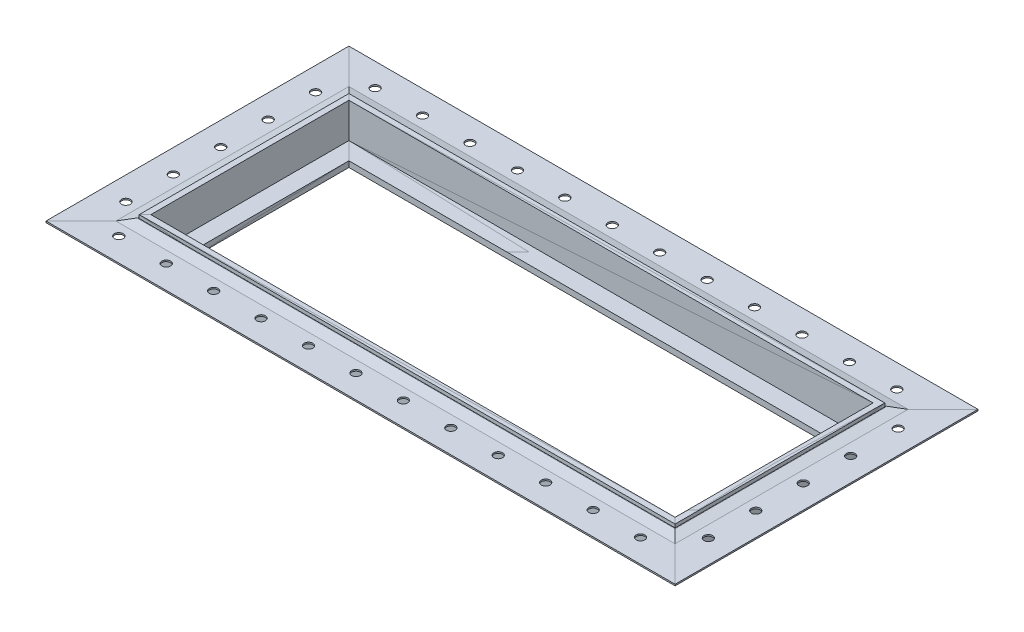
ISO-10303-21;
HEADER;
FILE_DESCRIPTION(('STEP AP214'),'2;1');
FILE_NAME('part.step','',(''),(''),'','','');
FILE_SCHEMA(('AUTOMOTIVE_DESIGN { 1 0 10303 214 1 1 1 1 }'));
ENDSEC;
DATA;
#1=APPLICATION_CONTEXT('core data for automotive mechanical design processes');
#2=APPLICATION_PROTOCOL_DEFINITION('international standard','automotive_design',2000,#1);
#3=PRODUCT_CONTEXT('',#1,'mechanical');
#4=PRODUCT('Part','Part','',(#3));
#5=PRODUCT_RELATED_PRODUCT_CATEGORY('part','',(#4));
#6=PRODUCT_DEFINITION_FORMATION('','',#4);
#7=PRODUCT_DEFINITION_CONTEXT('part definition',#1,'design');
#8=PRODUCT_DEFINITION('design','',#6,#7);
#9=PRODUCT_DEFINITION_SHAPE('','',#8);
#10=(LENGTH_UNIT() NAMED_UNIT(*) SI_UNIT(.MILLI.,.METRE.));
#11=(NAMED_UNIT(*) PLANE_ANGLE_UNIT() SI_UNIT($,.RADIAN.));
#12=(NAMED_UNIT(*) SI_UNIT($,.STERADIAN.) SOLID_ANGLE_UNIT());
#13=UNCERTAINTY_MEASURE_WITH_UNIT(LENGTH_MEASURE(1.E-05),#10,'distance_accuracy_value','');
#14=(GEOMETRIC_REPRESENTATION_CONTEXT(3) GLOBAL_UNCERTAINTY_ASSIGNED_CONTEXT((#13)) GLOBAL_UNIT_ASSIGNED_CONTEXT((#10,
#11,#12)) REPRESENTATION_CONTEXT('',''));
#15=CARTESIAN_POINT('',(0.,0.,0.));
#16=DIRECTION('',(0.,0.,1.));
#17=DIRECTION('',(1.,0.,0.));
#18=AXIS2_PLACEMENT_3D('',#15,#16,#17);
#19=CARTESIAN_POINT('',(146.05,-313.666861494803,0.));
#20=DIRECTION('',(1.,0.,0.));
#21=DIRECTION('',(0.,0.,-1.));
#22=AXIS2_PLACEMENT_3D('',#19,#20,#21);
#23=PLANE('',#22);
#24=DIRECTION('',(0.,0.,-1.));
#25=VECTOR('',#24,1.);
#26=CARTESIAN_POINT('',(146.05,22.225,0.));
#27=LINE('',#26,#25);
#28=CARTESIAN_POINT('',(146.05,22.225,57.1499999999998));
#29=VERTEX_POINT('',#28);
#30=CARTESIAN_POINT('',(146.05,22.225,-57.15));
#31=VERTEX_POINT('',#30);
#32=EDGE_CURVE('E191',#29,#31,#27,.T.);
#33=ORIENTED_EDGE('',*,*,#32,.F.);
#34=DIRECTION('',(0.,1.,0.));
#35=VECTOR('',#34,1.);
#36=CARTESIAN_POINT('',(146.05,-313.666861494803,57.1499999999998));
#37=LINE('',#36,#35);
#38=CARTESIAN_POINT('',(146.05,0.,57.1499999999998));
#39=VERTEX_POINT('',#38);
#40=EDGE_CURVE('E212',#39,#29,#37,.T.);
#41=ORIENTED_EDGE('',*,*,#40,.F.);
#42=DIRECTION('',(0.,0.,-1.));
#43=VECTOR('',#42,1.);
#44=CARTESIAN_POINT('',(146.05,0.,0.));
#45=LINE('',#44,#43);
#46=CARTESIAN_POINT('',(146.05,0.,-57.15));
#47=VERTEX_POINT('',#46);
#48=EDGE_CURVE('E176',#39,#47,#45,.T.);
#49=ORIENTED_EDGE('',*,*,#48,.T.);
#50=DIRECTION('',(0.,1.,0.));
#51=VECTOR('',#50,1.);
#52=CARTESIAN_POINT('',(146.05,-313.666861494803,-57.15));
#53=LINE('',#52,#51);
#54=EDGE_CURVE('E224',#47,#31,#53,.T.);
#55=ORIENTED_EDGE('',*,*,#54,.T.);
#56=EDGE_LOOP('',(#33,#41,#49,#55));
#57=FACE_BOUND('',#56,.T.);
#58=ADVANCED_FACE('F47',(#57),#23,.T.);
#59=CARTESIAN_POINT('',(0.,-313.666861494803,-57.1499999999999));
#60=DIRECTION('',(0.,0.,-1.));
#61=DIRECTION('',(-1.,0.,0.));
#62=AXIS2_PLACEMENT_3D('',#59,#60,#61);
#63=PLANE('',#62);
#64=DIRECTION('',(-1.,0.,0.));
#65=VECTOR('',#64,1.);
#66=CARTESIAN_POINT('',(0.,22.225,-57.1499999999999));
#67=LINE('',#66,#65);
#68=CARTESIAN_POINT('',(-146.05,22.225,-57.1499999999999));
#69=VERTEX_POINT('',#68);
#70=EDGE_CURVE('E194',#31,#69,#67,.T.);
#71=ORIENTED_EDGE('',*,*,#70,.F.);
#72=ORIENTED_EDGE('',*,*,#54,.F.);
#73=DIRECTION('',(-1.,0.,0.));
#74=VECTOR('',#73,1.);
#75=CARTESIAN_POINT('',(0.,0.,-57.1499999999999));
#76=LINE('',#75,#74);
#77=CARTESIAN_POINT('',(-146.05,0.,-57.1499999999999));
#78=VERTEX_POINT('',#77);
#79=EDGE_CURVE('E179',#47,#78,#76,.T.);
#80=ORIENTED_EDGE('',*,*,#79,.T.);
#81=DIRECTION('',(0.,1.,0.));
#82=VECTOR('',#81,1.);
#83=CARTESIAN_POINT('',(-146.05,-313.666861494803,-57.1499999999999));
#84=LINE('',#83,#82);
#85=EDGE_CURVE('E222',#78,#69,#84,.T.);
#86=ORIENTED_EDGE('',*,*,#85,.T.);
#87=EDGE_LOOP('',(#71,#72,#80,#86));
#88=FACE_BOUND('',#87,.T.);
#89=ADVANCED_FACE('F244',(#88),#63,.T.);
#90=CARTESIAN_POINT('',(-146.05,-313.666861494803,0.));
#91=DIRECTION('',(-1.,0.,0.));
#92=DIRECTION('',(0.,0.,1.));
#93=AXIS2_PLACEMENT_3D('',#90,#91,#92);
#94=PLANE('',#93);
#95=DIRECTION('',(0.,0.,1.));
#96=VECTOR('',#95,1.);
#97=CARTESIAN_POINT('',(-146.05,22.225,0.));
#98=LINE('',#97,#96);
#99=CARTESIAN_POINT('',(-146.05,22.225,57.1499999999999));
#100=VERTEX_POINT('',#99);
#101=EDGE_CURVE('E197',#69,#100,#98,.T.);
#102=ORIENTED_EDGE('',*,*,#101,.F.);
#103=ORIENTED_EDGE('',*,*,#85,.F.);
#104=DIRECTION('',(0.,0.,1.));
#105=VECTOR('',#104,1.);
#106=CARTESIAN_POINT('',(-146.05,0.,0.));
#107=LINE('',#106,#105);
#108=CARTESIAN_POINT('',(-146.05,0.,57.1499999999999));
#109=VERTEX_POINT('',#108);
#110=EDGE_CURVE('E182',#78,#109,#107,.T.);
#111=ORIENTED_EDGE('',*,*,#110,.T.);
#112=DIRECTION('',(0.,1.,0.));
#113=VECTOR('',#112,1.);
#114=CARTESIAN_POINT('',(-146.05,-313.666861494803,57.1499999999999));
#115=LINE('',#114,#113);
#116=EDGE_CURVE('E220',#109,#100,#115,.T.);
#117=ORIENTED_EDGE('',*,*,#116,.T.);
#118=EDGE_LOOP('',(#102,#103,#111,#117));
#119=FACE_BOUND('',#118,.T.);
#120=ADVANCED_FACE('F239',(#119),#94,.T.);
#121=CARTESIAN_POINT('',(0.,-313.666861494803,57.1499999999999));
#122=DIRECTION('',(0.,0.,1.));
#123=DIRECTION('',(1.,0.,0.));
#124=AXIS2_PLACEMENT_3D('',#121,#122,#123);
#125=PLANE('',#124);
#126=DIRECTION('',(1.,0.,0.));
#127=VECTOR('',#126,1.);
#128=CARTESIAN_POINT('',(0.,22.225,57.1499999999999));
#129=LINE('',#128,#127);
#130=EDGE_CURVE('E188',#100,#29,#129,.T.);
#131=ORIENTED_EDGE('',*,*,#130,.F.);
#132=ORIENTED_EDGE('',*,*,#116,.F.);
#133=DIRECTION('',(1.,0.,0.));
#134=VECTOR('',#133,1.);
#135=CARTESIAN_POINT('',(0.,0.,57.1499999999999));
#136=LINE('',#135,#134);
#137=EDGE_CURVE('E185',#109,#39,#136,.T.);
#138=ORIENTED_EDGE('',*,*,#137,.T.);
#139=ORIENTED_EDGE('',*,*,#40,.T.);
#140=EDGE_LOOP('',(#131,#132,#138,#139));
#141=FACE_BOUND('',#140,.T.);
#142=ADVANCED_FACE('F49',(#141),#125,.T.);
#143=CARTESIAN_POINT('',(0.,22.225,0.));
#144=DIRECTION('',(0.,1.,0.));
#145=DIRECTION('',(0.,0.,1.));
#146=AXIS2_PLACEMENT_3D('',#143,#144,#145);
#147=PLANE('',#146);
#148=ORIENTED_EDGE('',*,*,#130,.T.);
#149=ORIENTED_EDGE('',*,*,#32,.T.);
#150=ORIENTED_EDGE('',*,*,#70,.T.);
#151=ORIENTED_EDGE('',*,*,#101,.T.);
#152=EDGE_LOOP('',(#148,#149,#150,#151));
#153=FACE_BOUND('',#152,.T.);
#154=DIRECTION('',(0.,0.,1.));
#155=VECTOR('',#154,1.);
#156=CARTESIAN_POINT('',(142.875,22.225,0.));
#157=LINE('',#156,#155);
#158=CARTESIAN_POINT('',(142.875,22.225,-53.975));
#159=VERTEX_POINT('',#158);
#160=CARTESIAN_POINT('',(142.875,22.225,53.9749999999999));
#161=VERTEX_POINT('',#160);
#162=EDGE_CURVE('E200',#159,#161,#157,.T.);
#163=ORIENTED_EDGE('',*,*,#162,.T.);
#164=DIRECTION('',(-1.,0.,0.));
#165=VECTOR('',#164,1.);
#166=CARTESIAN_POINT('',(0.,22.225,53.9749999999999));
#167=LINE('',#166,#165);
#168=CARTESIAN_POINT('',(-142.875,22.225,53.9749999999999));
#169=VERTEX_POINT('',#168);
#170=EDGE_CURVE('E203',#161,#169,#167,.T.);
#171=ORIENTED_EDGE('',*,*,#170,.T.);
#172=DIRECTION('',(0.,0.,-1.));
#173=VECTOR('',#172,1.);
#174=CARTESIAN_POINT('',(-142.875,22.225,0.));
#175=LINE('',#174,#173);
#176=CARTESIAN_POINT('',(-142.875,22.225,-53.9749999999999));
#177=VERTEX_POINT('',#176);
#178=EDGE_CURVE('E206',#169,#177,#175,.T.);
#179=ORIENTED_EDGE('',*,*,#178,.T.);
#180=DIRECTION('',(1.,0.,0.));
#181=VECTOR('',#180,1.);
#182=CARTESIAN_POINT('',(0.,22.225,-53.9749999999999));
#183=LINE('',#182,#181);
#184=EDGE_CURVE('E209',#177,#159,#183,.T.);
#185=ORIENTED_EDGE('',*,*,#184,.T.);
#186=EDGE_LOOP('',(#163,#171,#179,#185));
#187=FACE_BOUND('',#186,.T.);
#188=ADVANCED_FACE('F234',(#153,#187),#147,.T.);
#189=CARTESIAN_POINT('',(0.,-313.666861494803,53.9749999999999));
#190=DIRECTION('',(0.,0.,-1.));
#191=DIRECTION('',(-1.,0.,0.));
#192=AXIS2_PLACEMENT_3D('',#189,#190,#191);
#193=PLANE('',#192);
#194=DIRECTION('',(1.,0.,0.));
#195=VECTOR('',#194,1.);
#196=CARTESIAN_POINT('',(0.,3.17499999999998,53.9749999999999));
#197=LINE('',#196,#195);
#198=CARTESIAN_POINT('',(-142.875,3.17499999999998,53.9749999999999));
#199=VERTEX_POINT('',#198);
#200=CARTESIAN_POINT('',(142.875,3.17499999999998,53.9749999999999));
#201=VERTEX_POINT('',#200);
#202=EDGE_CURVE('E62',#199,#201,#197,.T.);
#203=ORIENTED_EDGE('',*,*,#202,.F.);
#204=DIRECTION('',(0.,1.,0.));
#205=VECTOR('',#204,1.);
#206=CARTESIAN_POINT('',(-142.875,-313.666861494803,53.9749999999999));
#207=LINE('',#206,#205);
#208=EDGE_CURVE('E216',#199,#169,#207,.T.);
#209=ORIENTED_EDGE('',*,*,#208,.T.);
#210=ORIENTED_EDGE('',*,*,#170,.F.);
#211=DIRECTION('',(0.,1.,0.));
#212=VECTOR('',#211,1.);
#213=CARTESIAN_POINT('',(142.875,-313.666861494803,53.9749999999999));
#214=LINE('',#213,#212);
#215=EDGE_CURVE('E218',#201,#161,#214,.T.);
#216=ORIENTED_EDGE('',*,*,#215,.F.);
#217=EDGE_LOOP('',(#203,#209,#210,#216));
#218=FACE_BOUND('',#217,.T.);
#219=ADVANCED_FACE('F258',(#218),#193,.T.);
#220=CARTESIAN_POINT('',(-142.875,-313.666861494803,0.));
#221=DIRECTION('',(1.,0.,0.));
#222=DIRECTION('',(0.,0.,-1.));
#223=AXIS2_PLACEMENT_3D('',#220,#221,#222);
#224=PLANE('',#223);
#225=DIRECTION('',(0.,0.,1.));
#226=VECTOR('',#225,1.);
#227=CARTESIAN_POINT('',(-142.875,3.17499999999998,0.));
#228=LINE('',#227,#226);
#229=CARTESIAN_POINT('',(-142.875,3.17499999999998,-53.9749999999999));
#230=VERTEX_POINT('',#229);
#231=EDGE_CURVE('E69',#230,#199,#228,.T.);
#232=ORIENTED_EDGE('',*,*,#231,.F.);
#233=DIRECTION('',(0.,1.,0.));
#234=VECTOR('',#233,1.);
#235=CARTESIAN_POINT('',(-142.875,-313.666861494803,-53.9749999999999));
#236=LINE('',#235,#234);
#237=EDGE_CURVE('E214',#230,#177,#236,.T.);
#238=ORIENTED_EDGE('',*,*,#237,.T.);
#239=ORIENTED_EDGE('',*,*,#178,.F.);
#240=ORIENTED_EDGE('',*,*,#208,.F.);
#241=EDGE_LOOP('',(#232,#238,#239,#240));
#242=FACE_BOUND('',#241,.T.);
#243=ADVANCED_FACE('F261',(#242),#224,.T.);
#244=CARTESIAN_POINT('',(0.,-313.666861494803,-53.9749999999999));
#245=DIRECTION('',(0.,0.,1.));
#246=DIRECTION('',(1.,0.,0.));
#247=AXIS2_PLACEMENT_3D('',#244,#245,#246);
#248=PLANE('',#247);
#249=DIRECTION('',(-1.,0.,0.));
#250=VECTOR('',#249,1.);
#251=CARTESIAN_POINT('',(0.,3.17499999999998,-53.9749999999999));
#252=LINE('',#251,#250);
#253=CARTESIAN_POINT('',(142.875,3.17499999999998,-53.975));
#254=VERTEX_POINT('',#253);
#255=EDGE_CURVE('E146',#254,#230,#252,.T.);
#256=ORIENTED_EDGE('',*,*,#255,.F.);
#257=DIRECTION('',(0.,1.,0.));
#258=VECTOR('',#257,1.);
#259=CARTESIAN_POINT('',(142.875,-313.666861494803,-53.975));
#260=LINE('',#259,#258);
#261=EDGE_CURVE('E55',#254,#159,#260,.T.);
#262=ORIENTED_EDGE('',*,*,#261,.T.);
#263=ORIENTED_EDGE('',*,*,#184,.F.);
#264=ORIENTED_EDGE('',*,*,#237,.F.);
#265=EDGE_LOOP('',(#256,#262,#263,#264));
#266=FACE_BOUND('',#265,.T.);
#267=ADVANCED_FACE('F256',(#266),#248,.T.);
#268=CARTESIAN_POINT('',(142.875,-313.666861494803,0.));
#269=DIRECTION('',(-1.,0.,0.));
#270=DIRECTION('',(0.,0.,1.));
#271=AXIS2_PLACEMENT_3D('',#268,#269,#270);
#272=PLANE('',#271);
#273=DIRECTION('',(0.,0.,-1.));
#274=VECTOR('',#273,1.);
#275=CARTESIAN_POINT('',(142.875,3.17499999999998,0.));
#276=LINE('',#275,#274);
#277=EDGE_CURVE('E12',#201,#254,#276,.T.);
#278=ORIENTED_EDGE('',*,*,#277,.F.);
#279=ORIENTED_EDGE('',*,*,#215,.T.);
#280=ORIENTED_EDGE('',*,*,#162,.F.);
#281=ORIENTED_EDGE('',*,*,#261,.F.);
#282=EDGE_LOOP('',(#278,#279,#280,#281));
#283=FACE_BOUND('',#282,.T.);
#284=ADVANCED_FACE('F253',(#283),#272,.T.);
#285=CARTESIAN_POINT('',(-133.35,0.,0.));
#286=DIRECTION('',(0.,-1.,0.));
#287=DIRECTION('',(1.,0.,0.));
#288=AXIS2_PLACEMENT_3D('',#285,#286,#287);
#289=PLANE('',#288);
#290=ORIENTED_EDGE('',*,*,#137,.F.);
#291=ORIENTED_EDGE('',*,*,#110,.F.);
#292=ORIENTED_EDGE('',*,*,#79,.F.);
#293=ORIENTED_EDGE('',*,*,#48,.F.);
#294=EDGE_LOOP('',(#290,#291,#292,#293));
#295=FACE_BOUND('',#294,.T.);
#296=DIRECTION('',(1.,0.,0.));
#297=VECTOR('',#296,1.);
#298=CARTESIAN_POINT('',(0.,0.,44.4499999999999));
#299=LINE('',#298,#297);
#300=CARTESIAN_POINT('',(-133.35,0.,44.4499999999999));
#301=VERTEX_POINT('',#300);
#302=CARTESIAN_POINT('',(133.35,0.,44.4499999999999));
#303=VERTEX_POINT('',#302);
#304=EDGE_CURVE('E155',#301,#303,#299,.T.);
#305=ORIENTED_EDGE('',*,*,#304,.T.);
#306=DIRECTION('',(0.,0.,-1.));
#307=VECTOR('',#306,1.);
#308=CARTESIAN_POINT('',(133.35,0.,0.));
#309=LINE('',#308,#307);
#310=CARTESIAN_POINT('',(133.35,0.,-44.45));
#311=VERTEX_POINT('',#310);
#312=EDGE_CURVE('E160',#303,#311,#309,.T.);
#313=ORIENTED_EDGE('',*,*,#312,.T.);
#314=DIRECTION('',(-1.,0.,0.));
#315=VECTOR('',#314,1.);
#316=CARTESIAN_POINT('',(0.,0.,-44.45));
#317=LINE('',#316,#315);
#318=CARTESIAN_POINT('',(-133.35,0.,-44.4499999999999));
#319=VERTEX_POINT('',#318);
#320=EDGE_CURVE('E168',#311,#319,#317,.T.);
#321=ORIENTED_EDGE('',*,*,#320,.T.);
#322=DIRECTION('',(0.,0.,1.));
#323=VECTOR('',#322,1.);
#324=CARTESIAN_POINT('',(-133.35,0.,0.));
#325=LINE('',#324,#323);
#326=EDGE_CURVE('E163',#319,#301,#325,.T.);
#327=ORIENTED_EDGE('',*,*,#326,.T.);
#328=EDGE_LOOP('',(#305,#313,#321,#327));
#329=FACE_BOUND('',#328,.T.);
#330=ADVANCED_FACE('F241',(#295,#329),#289,.T.);
#331=CARTESIAN_POINT('',(133.35,316.841861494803,0.));
#332=DIRECTION('',(-1.,0.,0.));
#333=DIRECTION('',(0.,-1.,0.));
#334=AXIS2_PLACEMENT_3D('',#331,#332,#333);
#335=PLANE('',#334);
#336=DIRECTION('',(0.,-1.,0.));
#337=VECTOR('',#336,1.);
#338=CARTESIAN_POINT('',(133.35,316.841861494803,44.4499999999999));
#339=LINE('',#338,#337);
#340=CARTESIAN_POINT('',(133.35,3.17499999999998,44.4499999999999));
#341=VERTEX_POINT('',#340);
#342=EDGE_CURVE('E152',#341,#303,#339,.T.);
#343=ORIENTED_EDGE('',*,*,#342,.F.);
#344=DIRECTION('',(0.,0.,-1.));
#345=VECTOR('',#344,1.);
#346=CARTESIAN_POINT('',(133.35,3.17499999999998,0.));
#347=LINE('',#346,#345);
#348=CARTESIAN_POINT('',(133.35,3.17499999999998,-44.45));
#349=VERTEX_POINT('',#348);
#350=EDGE_CURVE('E136',#341,#349,#347,.T.);
#351=ORIENTED_EDGE('',*,*,#350,.T.);
#352=DIRECTION('',(0.,-1.,0.));
#353=VECTOR('',#352,1.);
#354=CARTESIAN_POINT('',(133.35,316.841861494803,-44.45));
#355=LINE('',#354,#353);
#356=EDGE_CURVE('E162',#349,#311,#355,.T.);
#357=ORIENTED_EDGE('',*,*,#356,.T.);
#358=ORIENTED_EDGE('',*,*,#312,.F.);
#359=EDGE_LOOP('',(#343,#351,#357,#358));
#360=FACE_BOUND('',#359,.T.);
#361=ADVANCED_FACE('F158',(#360),#335,.T.);
#362=CARTESIAN_POINT('',(0.,316.841861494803,-44.45));
#363=DIRECTION('',(0.,0.,1.));
#364=DIRECTION('',(1.,0.,0.));
#365=AXIS2_PLACEMENT_3D('',#362,#363,#364);
#366=PLANE('',#365);
#367=ORIENTED_EDGE('',*,*,#356,.F.);
#368=DIRECTION('',(-1.,0.,0.));
#369=VECTOR('',#368,1.);
#370=CARTESIAN_POINT('',(0.,3.17499999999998,-44.45));
#371=LINE('',#370,#369);
#372=CARTESIAN_POINT('',(-133.35,3.17499999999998,-44.4499999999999));
#373=VERTEX_POINT('',#372);
#374=EDGE_CURVE('E142',#349,#373,#371,.T.);
#375=ORIENTED_EDGE('',*,*,#374,.T.);
#376=DIRECTION('',(0.,-1.,0.));
#377=VECTOR('',#376,1.);
#378=CARTESIAN_POINT('',(-133.35,316.841861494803,-44.4499999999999));
#379=LINE('',#378,#377);
#380=EDGE_CURVE('E165',#373,#319,#379,.T.);
#381=ORIENTED_EDGE('',*,*,#380,.T.);
#382=ORIENTED_EDGE('',*,*,#320,.F.);
#383=EDGE_LOOP('',(#367,#375,#381,#382));
#384=FACE_BOUND('',#383,.T.);
#385=ADVANCED_FACE('F276',(#384),#366,.T.);
#386=CARTESIAN_POINT('',(-133.35,316.841861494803,0.));
#387=DIRECTION('',(1.,0.,0.));
#388=DIRECTION('',(0.,1.,0.));
#389=AXIS2_PLACEMENT_3D('',#386,#387,#388);
#390=PLANE('',#389);
#391=ORIENTED_EDGE('',*,*,#380,.F.);
#392=DIRECTION('',(0.,0.,1.));
#393=VECTOR('',#392,1.);
#394=CARTESIAN_POINT('',(-133.35,3.17499999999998,0.));
#395=LINE('',#394,#393);
#396=CARTESIAN_POINT('',(-133.35,3.17499999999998,44.4499999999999));
#397=VERTEX_POINT('',#396);
#398=EDGE_CURVE('E156',#373,#397,#395,.T.);
#399=ORIENTED_EDGE('',*,*,#398,.T.);
#400=DIRECTION('',(0.,-1.,0.));
#401=VECTOR('',#400,1.);
#402=CARTESIAN_POINT('',(-133.35,316.841861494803,44.4499999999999));
#403=LINE('',#402,#401);
#404=EDGE_CURVE('E147',#397,#301,#403,.T.);
#405=ORIENTED_EDGE('',*,*,#404,.T.);
#406=ORIENTED_EDGE('',*,*,#326,.F.);
#407=EDGE_LOOP('',(#391,#399,#405,#406));
#408=FACE_BOUND('',#407,.T.);
#409=ADVANCED_FACE('F273',(#408),#390,.T.);
#410=CARTESIAN_POINT('',(0.,316.841861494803,44.4499999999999));
#411=DIRECTION('',(0.,0.,-1.));
#412=DIRECTION('',(-1.,0.,0.));
#413=AXIS2_PLACEMENT_3D('',#410,#411,#412);
#414=PLANE('',#413);
#415=ORIENTED_EDGE('',*,*,#404,.F.);
#416=DIRECTION('',(1.,0.,0.));
#417=VECTOR('',#416,1.);
#418=CARTESIAN_POINT('',(0.,3.17499999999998,44.4499999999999));
#419=LINE('',#418,#417);
#420=EDGE_CURVE('E139',#397,#341,#419,.T.);
#421=ORIENTED_EDGE('',*,*,#420,.T.);
#422=ORIENTED_EDGE('',*,*,#342,.T.);
#423=ORIENTED_EDGE('',*,*,#304,.F.);
#424=EDGE_LOOP('',(#415,#421,#422,#423));
#425=FACE_BOUND('',#424,.T.);
#426=ADVANCED_FACE('F150',(#425),#414,.T.);
#427=CARTESIAN_POINT('',(-142.875,3.17499999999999,0.));
#428=DIRECTION('',(0.,1.,0.));
#429=DIRECTION('',(0.,0.,1.));
#430=AXIS2_PLACEMENT_3D('',#427,#428,#429);
#431=PLANE('',#430);
#432=ORIENTED_EDGE('',*,*,#231,.T.);
#433=ORIENTED_EDGE('',*,*,#202,.T.);
#434=ORIENTED_EDGE('',*,*,#277,.T.);
#435=ORIENTED_EDGE('',*,*,#255,.T.);
#436=EDGE_LOOP('',(#432,#433,#434,#435));
#437=FACE_BOUND('',#436,.T.);
#438=ORIENTED_EDGE('',*,*,#420,.F.);
#439=ORIENTED_EDGE('',*,*,#398,.F.);
#440=ORIENTED_EDGE('',*,*,#374,.F.);
#441=ORIENTED_EDGE('',*,*,#350,.F.);
#442=EDGE_LOOP('',(#438,#439,#440,#441));
#443=FACE_BOUND('',#442,.T.);
#444=ADVANCED_FACE('F138',(#437,#443),#431,.T.);
#445=CLOSED_SHELL('',(#58,#89,#120,#142,#188,#219,#243,#267,#284,#330,#361,#385,#409,#426,#444));
#446=MANIFOLD_SOLID_BREP('B2',#445);
#447=CARTESIAN_POINT('',(-158.75,0.,51.7071244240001));
#448=DIRECTION('',(0.,1.,0.));
#449=DIRECTION('',(0.,0.,1.));
#450=AXIS2_PLACEMENT_3D('',#447,#448,#449);
#451=CYLINDRICAL_SURFACE('',#450,2.37490000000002);
#452=CARTESIAN_POINT('',(-158.75,18.4140520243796,51.7071244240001));
#453=DIRECTION('',(0.,-1.,0.));
#454=DIRECTION('',(1.,0.,0.));
#455=AXIS2_PLACEMENT_3D('',#452,#453,#454);
#456=CIRCLE('',#455,2.37490000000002);
#457=CARTESIAN_POINT('',(-156.3751,18.4140520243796,51.7071244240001));
#458=VERTEX_POINT('',#457);
#459=EDGE_CURVE('E430',#458,#458,#456,.T.);
#460=ORIENTED_EDGE('',*,*,#459,.T.);
#461=EDGE_LOOP('',(#460));
#462=FACE_BOUND('',#461,.T.);
#463=CARTESIAN_POINT('',(-158.75,19.2078020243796,51.7071244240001));
#464=DIRECTION('',(0.,1.,0.));
#465=DIRECTION('',(0.,0.,1.));
#466=AXIS2_PLACEMENT_3D('',#463,#464,#465);
#467=CIRCLE('',#466,2.37490000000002);
#468=CARTESIAN_POINT('',(-158.75,19.2078020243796,54.0820244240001));
#469=VERTEX_POINT('',#468);
#470=EDGE_CURVE('E45',#469,#469,#467,.T.);
#471=ORIENTED_EDGE('',*,*,#470,.T.);
#472=EDGE_LOOP('',(#471));
#473=FACE_BOUND('',#472,.T.);
#474=ADVANCED_FACE('F421',(#462,#473),#451,.F.);
#475=CARTESIAN_POINT('',(-158.75,0.,25.8535530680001));
#476=DIRECTION('',(0.,1.,0.));
#477=DIRECTION('',(0.,0.,1.));
#478=AXIS2_PLACEMENT_3D('',#475,#476,#477);
#479=CYLINDRICAL_SURFACE('',#478,2.37490000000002);
#480=CARTESIAN_POINT('',(-158.75,18.4140520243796,25.8535530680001));
#481=DIRECTION('',(0.,-1.,0.));
#482=DIRECTION('',(1.,0.,0.));
#483=AXIS2_PLACEMENT_3D('',#480,#481,#482);
#484=CIRCLE('',#483,2.37490000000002);
#485=CARTESIAN_POINT('',(-156.3751,18.4140520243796,25.8535530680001));
#486=VERTEX_POINT('',#485);
#487=EDGE_CURVE('E836',#486,#486,#484,.T.);
#488=ORIENTED_EDGE('',*,*,#487,.T.);
#489=EDGE_LOOP('',(#488));
#490=FACE_BOUND('',#489,.T.);
#491=CARTESIAN_POINT('',(-158.75,19.2078020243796,25.8535530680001));
#492=DIRECTION('',(0.,1.,0.));
#493=DIRECTION('',(0.,0.,1.));
#494=AXIS2_PLACEMENT_3D('',#491,#492,#493);
#495=CIRCLE('',#494,2.37490000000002);
#496=CARTESIAN_POINT('',(-158.75,19.2078020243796,28.2284530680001));
#497=VERTEX_POINT('',#496);
#498=EDGE_CURVE('E839',#497,#497,#495,.T.);
#499=ORIENTED_EDGE('',*,*,#498,.T.);
#500=EDGE_LOOP('',(#499));
#501=FACE_BOUND('',#500,.T.);
#502=ADVANCED_FACE('F1404',(#490,#501),#479,.F.);
#503=CARTESIAN_POINT('',(-158.75,0.,-1.82879999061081E-05));
#504=DIRECTION('',(0.,1.,0.));
#505=DIRECTION('',(0.,0.,1.));
#506=AXIS2_PLACEMENT_3D('',#503,#504,#505);
#507=CYLINDRICAL_SURFACE('',#506,2.37490000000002);
#508=CARTESIAN_POINT('',(-158.75,18.4140520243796,-1.82879999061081E-05));
#509=DIRECTION('',(0.,-1.,0.));
#510=DIRECTION('',(1.,0.,0.));
#511=AXIS2_PLACEMENT_3D('',#508,#509,#510);
#512=CIRCLE('',#511,2.37490000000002);
#513=CARTESIAN_POINT('',(-156.3751,18.4140520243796,-1.82879999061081E-05));
#514=VERTEX_POINT('',#513);
#515=EDGE_CURVE('E781',#514,#514,#512,.T.);
#516=ORIENTED_EDGE('',*,*,#515,.T.);
#517=EDGE_LOOP('',(#516));
#518=FACE_BOUND('',#517,.T.);
#519=CARTESIAN_POINT('',(-158.75,19.2078020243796,-1.82879999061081E-05));
#520=DIRECTION('',(0.,1.,0.));
#521=DIRECTION('',(0.,0.,1.));
#522=AXIS2_PLACEMENT_3D('',#519,#520,#521);
#523=CIRCLE('',#522,2.37490000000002);
#524=CARTESIAN_POINT('',(-158.75,19.2078020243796,2.37488171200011));
#525=VERTEX_POINT('',#524);
#526=EDGE_CURVE('E833',#525,#525,#523,.T.);
#527=ORIENTED_EDGE('',*,*,#526,.T.);
#528=EDGE_LOOP('',(#527));
#529=FACE_BOUND('',#528,.T.);
#530=ADVANCED_FACE('F1409',(#518,#529),#507,.F.);
#531=CARTESIAN_POINT('',(139.926784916,0.,-69.85));
#532=DIRECTION('',(0.,1.,0.));
#533=DIRECTION('',(0.,0.,1.));
#534=AXIS2_PLACEMENT_3D('',#531,#532,#533);
#535=CYLINDRICAL_SURFACE('',#534,2.37490000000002);
#536=CARTESIAN_POINT('',(139.926784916,19.2078020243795,-69.85));
#537=DIRECTION('',(0.,1.,0.));
#538=DIRECTION('',(0.,0.,1.));
#539=AXIS2_PLACEMENT_3D('',#536,#537,#538);
#540=CIRCLE('',#539,2.37490000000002);
#541=CARTESIAN_POINT('',(139.926784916,19.2078020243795,-67.4751));
#542=VERTEX_POINT('',#541);
#543=EDGE_CURVE('E775',#542,#542,#540,.T.);
#544=ORIENTED_EDGE('',*,*,#543,.T.);
#545=EDGE_LOOP('',(#544));
#546=FACE_BOUND('',#545,.T.);
#547=CARTESIAN_POINT('',(139.926784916,18.4140520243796,-69.85));
#548=DIRECTION('',(0.,-1.,0.));
#549=DIRECTION('',(0.,0.,-1.));
#550=AXIS2_PLACEMENT_3D('',#547,#548,#549);
#551=CIRCLE('',#550,2.37490000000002);
#552=CARTESIAN_POINT('',(139.926784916,18.4140520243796,-72.2249));
#553=VERTEX_POINT('',#552);
#554=EDGE_CURVE('E778',#553,#553,#551,.T.);
#555=ORIENTED_EDGE('',*,*,#554,.T.);
#556=EDGE_LOOP('',(#555));
#557=FACE_BOUND('',#556,.T.);
#558=ADVANCED_FACE('F1636',(#546,#557),#535,.F.);
#559=CARTESIAN_POINT('',(114.07321356,0.,-69.85));
#560=DIRECTION('',(0.,1.,0.));
#561=DIRECTION('',(0.,0.,1.));
#562=AXIS2_PLACEMENT_3D('',#559,#560,#561);
#563=CYLINDRICAL_SURFACE('',#562,2.37490000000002);
#564=CARTESIAN_POINT('',(114.07321356,19.2078020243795,-69.85));
#565=DIRECTION('',(0.,1.,0.));
#566=DIRECTION('',(0.,0.,1.));
#567=AXIS2_PLACEMENT_3D('',#564,#565,#566);
#568=CIRCLE('',#567,2.37490000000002);
#569=CARTESIAN_POINT('',(114.07321356,19.2078020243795,-67.4751));
#570=VERTEX_POINT('',#569);
#571=EDGE_CURVE('E769',#570,#570,#568,.T.);
#572=ORIENTED_EDGE('',*,*,#571,.T.);
#573=EDGE_LOOP('',(#572));
#574=FACE_BOUND('',#573,.T.);
#575=CARTESIAN_POINT('',(114.07321356,18.4140520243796,-69.85));
#576=DIRECTION('',(0.,-1.,0.));
#577=DIRECTION('',(0.,0.,-1.));
#578=AXIS2_PLACEMENT_3D('',#575,#576,#577);
#579=CIRCLE('',#578,2.37490000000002);
#580=CARTESIAN_POINT('',(114.07321356,18.4140520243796,-72.2249));
#581=VERTEX_POINT('',#580);
#582=EDGE_CURVE('E772',#581,#581,#579,.T.);
#583=ORIENTED_EDGE('',*,*,#582,.T.);
#584=EDGE_LOOP('',(#583));
#585=FACE_BOUND('',#584,.T.);
#586=ADVANCED_FACE('F1640',(#574,#585),#563,.F.);
#587=CARTESIAN_POINT('',(88.2196422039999,0.,-69.85));
#588=DIRECTION('',(0.,1.,0.));
#589=DIRECTION('',(0.,0.,1.));
#590=AXIS2_PLACEMENT_3D('',#587,#588,#589);
#591=CYLINDRICAL_SURFACE('',#590,2.37490000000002);
#592=CARTESIAN_POINT('',(88.2196422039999,19.2078020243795,-69.85));
#593=DIRECTION('',(0.,1.,0.));
#594=DIRECTION('',(0.,0.,1.));
#595=AXIS2_PLACEMENT_3D('',#592,#593,#594);
#596=CIRCLE('',#595,2.37490000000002);
#597=CARTESIAN_POINT('',(88.2196422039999,19.2078020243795,-67.4751));
#598=VERTEX_POINT('',#597);
#599=EDGE_CURVE('E763',#598,#598,#596,.T.);
#600=ORIENTED_EDGE('',*,*,#599,.T.);
#601=EDGE_LOOP('',(#600));
#602=FACE_BOUND('',#601,.T.);
#603=CARTESIAN_POINT('',(88.2196422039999,18.4140520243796,-69.85));
#604=DIRECTION('',(0.,-1.,0.));
#605=DIRECTION('',(0.,0.,-1.));
#606=AXIS2_PLACEMENT_3D('',#603,#604,#605);
#607=CIRCLE('',#606,2.37490000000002);
#608=CARTESIAN_POINT('',(88.2196422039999,18.4140520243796,-72.2249));
#609=VERTEX_POINT('',#608);
#610=EDGE_CURVE('E766',#609,#609,#607,.T.);
#611=ORIENTED_EDGE('',*,*,#610,.T.);
#612=EDGE_LOOP('',(#611));
#613=FACE_BOUND('',#612,.T.);
#614=ADVANCED_FACE('F1651',(#602,#613),#591,.F.);
#615=CARTESIAN_POINT('',(62.3660708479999,0.,-69.85));
#616=DIRECTION('',(0.,1.,0.));
#617=DIRECTION('',(0.,0.,1.));
#618=AXIS2_PLACEMENT_3D('',#615,#616,#617);
#619=CYLINDRICAL_SURFACE('',#618,2.37490000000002);
#620=CARTESIAN_POINT('',(62.3660708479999,19.2078020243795,-69.85));
#621=DIRECTION('',(0.,1.,0.));
#622=DIRECTION('',(0.,0.,1.));
#623=AXIS2_PLACEMENT_3D('',#620,#621,#622);
#624=CIRCLE('',#623,2.37490000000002);
#625=CARTESIAN_POINT('',(62.3660708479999,19.2078020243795,-67.4751));
#626=VERTEX_POINT('',#625);
#627=EDGE_CURVE('E757',#626,#626,#624,.T.);
#628=ORIENTED_EDGE('',*,*,#627,.T.);
#629=EDGE_LOOP('',(#628));
#630=FACE_BOUND('',#629,.T.);
#631=CARTESIAN_POINT('',(62.3660708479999,18.4140520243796,-69.85));
#632=DIRECTION('',(0.,-1.,0.));
#633=DIRECTION('',(0.,0.,-1.));
#634=AXIS2_PLACEMENT_3D('',#631,#632,#633);
#635=CIRCLE('',#634,2.37490000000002);
#636=CARTESIAN_POINT('',(62.3660708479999,18.4140520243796,-72.2249));
#637=VERTEX_POINT('',#636);
#638=EDGE_CURVE('E760',#637,#637,#635,.T.);
#639=ORIENTED_EDGE('',*,*,#638,.T.);
#640=EDGE_LOOP('',(#639));
#641=FACE_BOUND('',#640,.T.);
#642=ADVANCED_FACE('F1661',(#630,#641),#619,.F.);
#643=CARTESIAN_POINT('',(36.5124994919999,0.,-69.85));
#644=DIRECTION('',(0.,1.,0.));
#645=DIRECTION('',(0.,0.,1.));
#646=AXIS2_PLACEMENT_3D('',#643,#644,#645);
#647=CYLINDRICAL_SURFACE('',#646,2.37490000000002);
#648=CARTESIAN_POINT('',(36.5124994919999,19.2078020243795,-69.85));
#649=DIRECTION('',(0.,1.,0.));
#650=DIRECTION('',(0.,0.,1.));
#651=AXIS2_PLACEMENT_3D('',#648,#649,#650);
#652=CIRCLE('',#651,2.37490000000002);
#653=CARTESIAN_POINT('',(36.5124994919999,19.2078020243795,-67.4751));
#654=VERTEX_POINT('',#653);
#655=EDGE_CURVE('E751',#654,#654,#652,.T.);
#656=ORIENTED_EDGE('',*,*,#655,.T.);
#657=EDGE_LOOP('',(#656));
#658=FACE_BOUND('',#657,.T.);
#659=CARTESIAN_POINT('',(36.5124994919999,18.4140520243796,-69.85));
#660=DIRECTION('',(0.,-1.,0.));
#661=DIRECTION('',(0.,0.,-1.));
#662=AXIS2_PLACEMENT_3D('',#659,#660,#661);
#663=CIRCLE('',#662,2.37490000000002);
#664=CARTESIAN_POINT('',(36.5124994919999,18.4140520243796,-72.2249));
#665=VERTEX_POINT('',#664);
#666=EDGE_CURVE('E754',#665,#665,#663,.T.);
#667=ORIENTED_EDGE('',*,*,#666,.T.);
#668=EDGE_LOOP('',(#667));
#669=FACE_BOUND('',#668,.T.);
#670=ADVANCED_FACE('F1671',(#658,#669),#647,.F.);
#671=CARTESIAN_POINT('',(10.6589281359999,0.,-69.85));
#672=DIRECTION('',(0.,1.,0.));
#673=DIRECTION('',(0.,0.,1.));
#674=AXIS2_PLACEMENT_3D('',#671,#672,#673);
#675=CYLINDRICAL_SURFACE('',#674,2.37490000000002);
#676=CARTESIAN_POINT('',(10.6589281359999,19.2078020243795,-69.85));
#677=DIRECTION('',(0.,1.,0.));
#678=DIRECTION('',(0.,0.,1.));
#679=AXIS2_PLACEMENT_3D('',#676,#677,#678);
#680=CIRCLE('',#679,2.37490000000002);
#681=CARTESIAN_POINT('',(10.6589281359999,19.2078020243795,-67.4750999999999));
#682=VERTEX_POINT('',#681);
#683=EDGE_CURVE('E745',#682,#682,#680,.T.);
#684=ORIENTED_EDGE('',*,*,#683,.T.);
#685=EDGE_LOOP('',(#684));
#686=FACE_BOUND('',#685,.T.);
#687=CARTESIAN_POINT('',(10.6589281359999,18.4140520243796,-69.85));
#688=DIRECTION('',(0.,-1.,0.));
#689=DIRECTION('',(0.,0.,-1.));
#690=AXIS2_PLACEMENT_3D('',#687,#688,#689);
#691=CIRCLE('',#690,2.37490000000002);
#692=CARTESIAN_POINT('',(10.6589281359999,18.4140520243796,-72.2249));
#693=VERTEX_POINT('',#692);
#694=EDGE_CURVE('E748',#693,#693,#691,.T.);
#695=ORIENTED_EDGE('',*,*,#694,.T.);
#696=EDGE_LOOP('',(#695));
#697=FACE_BOUND('',#696,.T.);
#698=ADVANCED_FACE('F1681',(#686,#697),#675,.F.);
#699=CARTESIAN_POINT('',(-15.1946432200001,0.,-69.85));
#700=DIRECTION('',(0.,1.,0.));
#701=DIRECTION('',(0.,0.,1.));
#702=AXIS2_PLACEMENT_3D('',#699,#700,#701);
#703=CYLINDRICAL_SURFACE('',#702,2.37490000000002);
#704=CARTESIAN_POINT('',(-15.1946432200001,19.2078020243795,-69.85));
#705=DIRECTION('',(0.,1.,0.));
#706=DIRECTION('',(0.,0.,1.));
#707=AXIS2_PLACEMENT_3D('',#704,#705,#706);
#708=CIRCLE('',#707,2.37490000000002);
#709=CARTESIAN_POINT('',(-15.1946432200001,19.2078020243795,-67.4750999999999));
#710=VERTEX_POINT('',#709);
#711=EDGE_CURVE('E739',#710,#710,#708,.T.);
#712=ORIENTED_EDGE('',*,*,#711,.T.);
#713=EDGE_LOOP('',(#712));
#714=FACE_BOUND('',#713,.T.);
#715=CARTESIAN_POINT('',(-15.1946432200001,18.4140520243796,-69.85));
#716=DIRECTION('',(0.,-1.,0.));
#717=DIRECTION('',(0.,0.,-1.));
#718=AXIS2_PLACEMENT_3D('',#715,#716,#717);
#719=CIRCLE('',#718,2.37490000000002);
#720=CARTESIAN_POINT('',(-15.1946432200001,18.4140520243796,-72.2249));
#721=VERTEX_POINT('',#720);
#722=EDGE_CURVE('E742',#721,#721,#719,.T.);
#723=ORIENTED_EDGE('',*,*,#722,.T.);
#724=EDGE_LOOP('',(#723));
#725=FACE_BOUND('',#724,.T.);
#726=ADVANCED_FACE('F1691',(#714,#725),#703,.F.);
#727=CARTESIAN_POINT('',(-41.048214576,0.,-69.8499999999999));
#728=DIRECTION('',(0.,1.,0.));
#729=DIRECTION('',(0.,0.,1.));
#730=AXIS2_PLACEMENT_3D('',#727,#728,#729);
#731=CYLINDRICAL_SURFACE('',#730,2.37490000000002);
#732=CARTESIAN_POINT('',(-41.048214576,19.2078020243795,-69.8499999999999));
#733=DIRECTION('',(0.,1.,0.));
#734=DIRECTION('',(0.,0.,1.));
#735=AXIS2_PLACEMENT_3D('',#732,#733,#734);
#736=CIRCLE('',#735,2.37490000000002);
#737=CARTESIAN_POINT('',(-41.048214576,19.2078020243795,-67.4750999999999));
#738=VERTEX_POINT('',#737);
#739=EDGE_CURVE('E733',#738,#738,#736,.T.);
#740=ORIENTED_EDGE('',*,*,#739,.T.);
#741=EDGE_LOOP('',(#740));
#742=FACE_BOUND('',#741,.T.);
#743=CARTESIAN_POINT('',(-41.048214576,18.4140520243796,-69.8499999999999));
#744=DIRECTION('',(0.,-1.,0.));
#745=DIRECTION('',(0.,0.,-1.));
#746=AXIS2_PLACEMENT_3D('',#743,#744,#745);
#747=CIRCLE('',#746,2.37490000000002);
#748=CARTESIAN_POINT('',(-41.048214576,18.4140520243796,-72.2248999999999));
#749=VERTEX_POINT('',#748);
#750=EDGE_CURVE('E736',#749,#749,#747,.T.);
#751=ORIENTED_EDGE('',*,*,#750,.T.);
#752=EDGE_LOOP('',(#751));
#753=FACE_BOUND('',#752,.T.);
#754=ADVANCED_FACE('F1701',(#742,#753),#731,.F.);
#755=CARTESIAN_POINT('',(-66.9017859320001,0.,-69.8499999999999));
#756=DIRECTION('',(0.,1.,0.));
#757=DIRECTION('',(0.,0.,1.));
#758=AXIS2_PLACEMENT_3D('',#755,#756,#757);
#759=CYLINDRICAL_SURFACE('',#758,2.37490000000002);
#760=CARTESIAN_POINT('',(-66.9017859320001,19.2078020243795,-69.8499999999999));
#761=DIRECTION('',(0.,1.,0.));
#762=DIRECTION('',(0.,0.,1.));
#763=AXIS2_PLACEMENT_3D('',#760,#761,#762);
#764=CIRCLE('',#763,2.37490000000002);
#765=CARTESIAN_POINT('',(-66.9017859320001,19.2078020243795,-67.4750999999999));
#766=VERTEX_POINT('',#765);
#767=EDGE_CURVE('E727',#766,#766,#764,.T.);
#768=ORIENTED_EDGE('',*,*,#767,.T.);
#769=EDGE_LOOP('',(#768));
#770=FACE_BOUND('',#769,.T.);
#771=CARTESIAN_POINT('',(-66.9017859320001,18.4140520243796,-69.8499999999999));
#772=DIRECTION('',(0.,-1.,0.));
#773=DIRECTION('',(0.,0.,-1.));
#774=AXIS2_PLACEMENT_3D('',#771,#772,#773);
#775=CIRCLE('',#774,2.37490000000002);
#776=CARTESIAN_POINT('',(-66.9017859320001,18.4140520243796,-72.2248999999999));
#777=VERTEX_POINT('',#776);
#778=EDGE_CURVE('E730',#777,#777,#775,.T.);
#779=ORIENTED_EDGE('',*,*,#778,.T.);
#780=EDGE_LOOP('',(#779));
#781=FACE_BOUND('',#780,.T.);
#782=ADVANCED_FACE('F1711',(#770,#781),#759,.F.);
#783=CARTESIAN_POINT('',(-92.7553572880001,0.,-69.8499999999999));
#784=DIRECTION('',(0.,1.,0.));
#785=DIRECTION('',(0.,0.,1.));
#786=AXIS2_PLACEMENT_3D('',#783,#784,#785);
#787=CYLINDRICAL_SURFACE('',#786,2.37490000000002);
#788=CARTESIAN_POINT('',(-92.7553572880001,19.2078020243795,-69.8499999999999));
#789=DIRECTION('',(0.,1.,0.));
#790=DIRECTION('',(0.,0.,1.));
#791=AXIS2_PLACEMENT_3D('',#788,#789,#790);
#792=CIRCLE('',#791,2.37490000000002);
#793=CARTESIAN_POINT('',(-92.7553572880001,19.2078020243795,-67.4750999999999));
#794=VERTEX_POINT('',#793);
#795=EDGE_CURVE('E720',#794,#794,#792,.T.);
#796=ORIENTED_EDGE('',*,*,#795,.T.);
#797=EDGE_LOOP('',(#796));
#798=FACE_BOUND('',#797,.T.);
#799=CARTESIAN_POINT('',(-92.7553572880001,18.4140520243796,-69.8499999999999));
#800=DIRECTION('',(0.,-1.,0.));
#801=DIRECTION('',(0.,0.,-1.));
#802=AXIS2_PLACEMENT_3D('',#799,#800,#801);
#803=CIRCLE('',#802,2.37490000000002);
#804=CARTESIAN_POINT('',(-92.7553572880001,18.4140520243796,-72.2248999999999));
#805=VERTEX_POINT('',#804);
#806=EDGE_CURVE('E723',#805,#805,#803,.T.);
#807=ORIENTED_EDGE('',*,*,#806,.T.);
#808=EDGE_LOOP('',(#807));
#809=FACE_BOUND('',#808,.T.);
#810=ADVANCED_FACE('F1721',(#798,#809),#787,.F.);
#811=CARTESIAN_POINT('',(174.4075,3.17499999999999,44.4499999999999));
#812=DIRECTION('',(0.,0.,-1.));
#813=DIRECTION('',(-1.,0.,0.));
#814=AXIS2_PLACEMENT_3D('',#811,#812,#813);
#815=PLANE('',#814);
#816=DIRECTION('',(-1.,0.,0.));
#817=VECTOR('',#816,1.);
#818=CARTESIAN_POINT('',(174.4075,0.,44.4499999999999));
#819=LINE('',#818,#817);
#820=CARTESIAN_POINT('',(133.35,0.,44.4499999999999));
#821=VERTEX_POINT('',#820);
#822=CARTESIAN_POINT('',(-133.35,0.,44.4499999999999));
#823=VERTEX_POINT('',#822);
#824=EDGE_CURVE('E583',#821,#823,#819,.T.);
#825=ORIENTED_EDGE('',*,*,#824,.T.);
#826=DIRECTION('',(0.,1.,0.));
#827=VECTOR('',#826,1.);
#828=CARTESIAN_POINT('',(-133.35,3.17499999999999,44.4499999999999));
#829=LINE('',#828,#827);
#830=CARTESIAN_POINT('',(-133.35,3.17499999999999,44.4499999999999));
#831=VERTEX_POINT('',#830);
#832=EDGE_CURVE('E588',#823,#831,#829,.T.);
#833=ORIENTED_EDGE('',*,*,#832,.T.);
#834=DIRECTION('',(-1.,0.,0.));
#835=VECTOR('',#834,1.);
#836=CARTESIAN_POINT('',(174.4075,3.17499999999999,44.4499999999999));
#837=LINE('',#836,#835);
#838=CARTESIAN_POINT('',(133.35,3.17499999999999,44.4499999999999));
#839=VERTEX_POINT('',#838);
#840=EDGE_CURVE('E674',#839,#831,#837,.T.);
#841=ORIENTED_EDGE('',*,*,#840,.F.);
#842=DIRECTION('',(0.,1.,0.));
#843=VECTOR('',#842,1.);
#844=CARTESIAN_POINT('',(133.35,3.17499999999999,44.4499999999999));
#845=LINE('',#844,#843);
#846=EDGE_CURVE('E1089',#821,#839,#845,.T.);
#847=ORIENTED_EDGE('',*,*,#846,.F.);
#848=EDGE_LOOP('',(#825,#833,#841,#847));
#849=FACE_BOUND('',#848,.T.);
#850=ADVANCED_FACE('F1321',(#849),#815,.T.);
#851=CARTESIAN_POINT('',(174.4075,3.17499999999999,53.9749999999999));
#852=DIRECTION('',(0.,1.,0.));
#853=DIRECTION('',(0.,0.,1.));
#854=AXIS2_PLACEMENT_3D('',#851,#852,#853);
#855=PLANE('',#854);
#856=ORIENTED_EDGE('',*,*,#840,.T.);
#857=DIRECTION('',(-0.707106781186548,0.,0.707106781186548));
#858=VECTOR('',#857,1.);
#859=CARTESIAN_POINT('',(-158.64125,3.17499999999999,69.7412499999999));
#860=LINE('',#859,#858);
#861=CARTESIAN_POINT('',(-142.875,3.17499999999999,53.9749999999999));
#862=VERTEX_POINT('',#861);
#863=EDGE_CURVE('E593',#831,#862,#860,.T.);
#864=ORIENTED_EDGE('',*,*,#863,.T.);
#865=DIRECTION('',(-1.,0.,0.));
#866=VECTOR('',#865,1.);
#867=CARTESIAN_POINT('',(174.4075,3.17499999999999,53.9749999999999));
#868=LINE('',#867,#866);
#869=CARTESIAN_POINT('',(142.875,3.17499999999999,53.9749999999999));
#870=VERTEX_POINT('',#869);
#871=EDGE_CURVE('E677',#870,#862,#868,.T.);
#872=ORIENTED_EDGE('',*,*,#871,.F.);
#873=DIRECTION('',(0.707106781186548,0.,0.707106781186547));
#874=VECTOR('',#873,1.);
#875=CARTESIAN_POINT('',(73.1337499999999,3.17499999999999,-15.7662500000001));
#876=LINE('',#875,#874);
#877=EDGE_CURVE('E1086',#839,#870,#876,.T.);
#878=ORIENTED_EDGE('',*,*,#877,.F.);
#879=EDGE_LOOP('',(#856,#864,#872,#878));
#880=FACE_BOUND('',#879,.T.);
#881=ADVANCED_FACE('F1323',(#880),#855,.T.);
#882=CARTESIAN_POINT('',(174.4075,22.225,53.9749999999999));
#883=DIRECTION('',(0.,0.,-1.));
#884=DIRECTION('',(-1.,0.,0.));
#885=AXIS2_PLACEMENT_3D('',#882,#883,#884);
#886=PLANE('',#885);
#887=ORIENTED_EDGE('',*,*,#871,.T.);
#888=DIRECTION('',(0.,1.,0.));
#889=VECTOR('',#888,1.);
#890=CARTESIAN_POINT('',(-142.875,22.225,53.9749999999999));
#891=LINE('',#890,#889);
#892=CARTESIAN_POINT('',(-142.875,22.225,53.9749999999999));
#893=VERTEX_POINT('',#892);
#894=EDGE_CURVE('E600',#862,#893,#891,.T.);
#895=ORIENTED_EDGE('',*,*,#894,.T.);
#896=DIRECTION('',(-1.,0.,0.));
#897=VECTOR('',#896,1.);
#898=CARTESIAN_POINT('',(174.4075,22.225,53.9749999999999));
#899=LINE('',#898,#897);
#900=CARTESIAN_POINT('',(142.875,22.225,53.9749999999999));
#901=VERTEX_POINT('',#900);
#902=EDGE_CURVE('E681',#901,#893,#899,.T.);
#903=ORIENTED_EDGE('',*,*,#902,.F.);
#904=DIRECTION('',(0.,1.,0.));
#905=VECTOR('',#904,1.);
#906=CARTESIAN_POINT('',(142.875,22.225,53.9749999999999));
#907=LINE('',#906,#905);
#908=EDGE_CURVE('E1083',#870,#901,#907,.T.);
#909=ORIENTED_EDGE('',*,*,#908,.F.);
#910=EDGE_LOOP('',(#887,#895,#903,#909));
#911=FACE_BOUND('',#910,.T.);
#912=ADVANCED_FACE('F1394',(#911),#886,.T.);
#913=CARTESIAN_POINT('',(174.4075,22.225,57.1499999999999));
#914=DIRECTION('',(0.,1.,0.));
#915=DIRECTION('',(0.,0.,1.));
#916=AXIS2_PLACEMENT_3D('',#913,#914,#915);
#917=PLANE('',#916);
#918=ORIENTED_EDGE('',*,*,#902,.T.);
#919=DIRECTION('',(-0.707106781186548,0.,0.707106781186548));
#920=VECTOR('',#919,1.);
#921=CARTESIAN_POINT('',(-160.22875,22.225,71.3287499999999));
#922=LINE('',#921,#920);
#923=CARTESIAN_POINT('',(-146.05,22.225,57.1499999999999));
#924=VERTEX_POINT('',#923);
#925=EDGE_CURVE('E603',#893,#924,#922,.T.);
#926=ORIENTED_EDGE('',*,*,#925,.T.);
#927=DIRECTION('',(-1.,0.,0.));
#928=VECTOR('',#927,1.);
#929=CARTESIAN_POINT('',(174.4075,22.225,57.1499999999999));
#930=LINE('',#929,#928);
#931=CARTESIAN_POINT('',(146.05,22.225,57.1499999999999));
#932=VERTEX_POINT('',#931);
#933=EDGE_CURVE('E684',#932,#924,#930,.T.);
#934=ORIENTED_EDGE('',*,*,#933,.F.);
#935=DIRECTION('',(0.707106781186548,0.,0.707106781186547));
#936=VECTOR('',#935,1.);
#937=CARTESIAN_POINT('',(74.72125,22.225,-14.17875));
#938=LINE('',#937,#936);
#939=EDGE_CURVE('E1080',#901,#932,#938,.T.);
#940=ORIENTED_EDGE('',*,*,#939,.F.);
#941=EDGE_LOOP('',(#918,#926,#934,#940));
#942=FACE_BOUND('',#941,.T.);
#943=ADVANCED_FACE('F1391',(#942),#917,.T.);
#944=CARTESIAN_POINT('',(174.4075,22.225,57.1499999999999));
#945=DIRECTION('',(0.,0.,1.));
#946=DIRECTION('',(0.,-1.,0.));
#947=AXIS2_PLACEMENT_3D('',#944,#945,#946);
#948=PLANE('',#947);
#949=ORIENTED_EDGE('',*,*,#933,.T.);
#950=DIRECTION('',(0.,-1.,0.));
#951=VECTOR('',#950,1.);
#952=CARTESIAN_POINT('',(-146.05,22.2250000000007,57.1499999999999));
#953=LINE('',#952,#951);
#954=CARTESIAN_POINT('',(-146.05,20.1446676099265,57.1499999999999));
#955=VERTEX_POINT('',#954);
#956=EDGE_CURVE('E606',#924,#955,#953,.T.);
#957=ORIENTED_EDGE('',*,*,#956,.T.);
#958=DIRECTION('',(-1.,0.,0.));
#959=VECTOR('',#958,1.);
#960=CARTESIAN_POINT('',(174.4075,20.1446676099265,57.1499999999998));
#961=LINE('',#960,#959);
#962=CARTESIAN_POINT('',(146.05,20.1446676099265,57.1499999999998));
#963=VERTEX_POINT('',#962);
#964=EDGE_CURVE('E687',#963,#955,#961,.T.);
#965=ORIENTED_EDGE('',*,*,#964,.F.);
#966=DIRECTION('',(0.,-1.,0.));
#967=VECTOR('',#966,1.);
#968=CARTESIAN_POINT('',(146.05,22.2249999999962,57.1499999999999));
#969=LINE('',#968,#967);
#970=EDGE_CURVE('E1077',#932,#963,#969,.T.);
#971=ORIENTED_EDGE('',*,*,#970,.F.);
#972=EDGE_LOOP('',(#949,#957,#965,#971));
#973=FACE_BOUND('',#972,.T.);
#974=ADVANCED_FACE('F1388',(#973),#948,.T.);
#975=CARTESIAN_POINT('',(174.4075,20.1446676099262,57.6579999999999));
#976=DIRECTION('',(-1.,0.,0.));
#977=DIRECTION('',(0.,0.,1.));
#978=AXIS2_PLACEMENT_3D('',#975,#976,#977);
#979=CYLINDRICAL_SURFACE('',#978,0.50800000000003);
#980=ORIENTED_EDGE('',*,*,#964,.T.);
#981=CARTESIAN_POINT('',(-146.558,20.1446676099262,57.6579999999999));
#982=DIRECTION('',(-0.707106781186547,0.,-0.707106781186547));
#983=DIRECTION('',(0.707106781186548,0.,-0.707106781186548));
#984=AXIS2_PLACEMENT_3D('',#981,#982,#983);
#985=ELLIPSE('',#984,0.718420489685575,0.50800000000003);
#986=CARTESIAN_POINT('',(-146.681208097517,20.6375000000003,57.7812080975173));
#987=VERTEX_POINT('',#986);
#988=EDGE_CURVE('E609',#955,#987,#985,.F.);
#989=ORIENTED_EDGE('',*,*,#988,.T.);
#990=DIRECTION('',(-1.,0.,0.));
#991=VECTOR('',#990,1.);
#992=CARTESIAN_POINT('',(174.4075,20.6375000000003,57.7812080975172));
#993=LINE('',#992,#991);
#994=CARTESIAN_POINT('',(146.681208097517,20.6375000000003,57.7812080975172));
#995=VERTEX_POINT('',#994);
#996=EDGE_CURVE('E690',#995,#987,#993,.T.);
#997=ORIENTED_EDGE('',*,*,#996,.F.);
#998=CARTESIAN_POINT('',(146.558,20.1446676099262,57.6579999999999));
#999=DIRECTION('',(-0.707106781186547,0.,0.707106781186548));
#1000=DIRECTION('',(0.707106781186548,0.,0.707106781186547));
#1001=AXIS2_PLACEMENT_3D('',#998,#999,#1000);
#1002=ELLIPSE('',#1001,0.718420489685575,0.50800000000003);
#1003=EDGE_CURVE('E1074',#963,#995,#1002,.F.);
#1004=ORIENTED_EDGE('',*,*,#1003,.F.);
#1005=EDGE_LOOP('',(#980,#989,#997,#1004));
#1006=FACE_BOUND('',#1005,.T.);
#1007=ADVANCED_FACE('F1385',(#1006),#979,.T.);
#1008=CARTESIAN_POINT('',(174.4075,19.2078020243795,63.4999999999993));
#1009=DIRECTION('',(0.,0.970142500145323,0.242535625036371));
#1010=DIRECTION('',(0.,-0.242535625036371,0.970142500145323));
#1011=AXIS2_PLACEMENT_3D('',#1008,#1009,#1010);
#1012=PLANE('',#1011);
#1013=ORIENTED_EDGE('',*,*,#996,.T.);
#1014=DIRECTION('',(-0.696310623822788,-0.174077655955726,0.696310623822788));
#1015=VECTOR('',#1014,1.);
#1016=CARTESIAN_POINT('',(-163.070303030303,16.5402262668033,74.1703030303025));
#1017=LINE('',#1016,#1015);
#1018=CARTESIAN_POINT('',(-152.399999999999,19.2078020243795,63.4999999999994));
#1019=VERTEX_POINT('',#1018);
#1020=EDGE_CURVE('E612',#987,#1019,#1017,.T.);
#1021=ORIENTED_EDGE('',*,*,#1020,.T.);
#1022=DIRECTION('',(-1.,0.,0.));
#1023=VECTOR('',#1022,1.);
#1024=CARTESIAN_POINT('',(174.4075,19.2078020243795,63.4999999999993));
#1025=LINE('',#1024,#1023);
#1026=CARTESIAN_POINT('',(152.399999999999,19.2078020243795,63.4999999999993));
#1027=VERTEX_POINT('',#1026);
#1028=EDGE_CURVE('E693',#1027,#1019,#1025,.T.);
#1029=ORIENTED_EDGE('',*,*,#1028,.F.);
#1030=DIRECTION('',(0.696310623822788,-0.174077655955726,0.696310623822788));
#1031=VECTOR('',#1030,1.);
#1032=CARTESIAN_POINT('',(80.1539393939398,37.2693171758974,-8.74606060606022));
#1033=LINE('',#1032,#1031);
#1034=EDGE_CURVE('E1071',#995,#1027,#1033,.T.);
#1035=ORIENTED_EDGE('',*,*,#1034,.F.);
#1036=EDGE_LOOP('',(#1013,#1021,#1029,#1035));
#1037=FACE_BOUND('',#1036,.T.);
#1038=ADVANCED_FACE('F1382',(#1037),#1012,.T.);
#1039=CARTESIAN_POINT('',(174.4075,19.2078020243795,63.4999999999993));
#1040=DIRECTION('',(0.,1.,0.));
#1041=DIRECTION('',(0.,0.,1.));
#1042=AXIS2_PLACEMENT_3D('',#1039,#1040,#1041);
#1043=PLANE('',#1042);
#1044=CARTESIAN_POINT('',(-118.608928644,19.2078020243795,69.8499999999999));
#1045=DIRECTION('',(0.,1.,0.));
#1046=DIRECTION('',(0.,0.,1.));
#1047=AXIS2_PLACEMENT_3D('',#1044,#1045,#1046);
#1048=CIRCLE('',#1047,2.37490000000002);
#1049=CARTESIAN_POINT('',(-118.608928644,19.2078020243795,72.2248999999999));
#1050=VERTEX_POINT('',#1049);
#1051=EDGE_CURVE('E786',#1050,#1050,#1048,.F.);
#1052=ORIENTED_EDGE('',*,*,#1051,.T.);
#1053=EDGE_LOOP('',(#1052));
#1054=FACE_BOUND('',#1053,.T.);
#1055=CARTESIAN_POINT('',(-92.7553572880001,19.2078020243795,69.8499999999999));
#1056=DIRECTION('',(0.,1.,0.));
#1057=DIRECTION('',(0.,0.,1.));
#1058=AXIS2_PLACEMENT_3D('',#1055,#1056,#1057);
#1059=CIRCLE('',#1058,2.37490000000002);
#1060=CARTESIAN_POINT('',(-92.7553572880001,19.2078020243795,72.2248999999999));
#1061=VERTEX_POINT('',#1060);
#1062=EDGE_CURVE('E827',#1061,#1061,#1059,.F.);
#1063=ORIENTED_EDGE('',*,*,#1062,.T.);
#1064=EDGE_LOOP('',(#1063));
#1065=FACE_BOUND('',#1064,.T.);
#1066=CARTESIAN_POINT('',(-66.9017859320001,19.2078020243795,69.8499999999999));
#1067=DIRECTION('',(0.,1.,0.));
#1068=DIRECTION('',(0.,0.,1.));
#1069=AXIS2_PLACEMENT_3D('',#1066,#1067,#1068);
#1070=CIRCLE('',#1069,2.37490000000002);
#1071=CARTESIAN_POINT('',(-66.9017859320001,19.2078020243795,72.2248999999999));
#1072=VERTEX_POINT('',#1071);
#1073=EDGE_CURVE('E823',#1072,#1072,#1070,.F.);
#1074=ORIENTED_EDGE('',*,*,#1073,.T.);
#1075=EDGE_LOOP('',(#1074));
#1076=FACE_BOUND('',#1075,.T.);
#1077=CARTESIAN_POINT('',(-41.048214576,19.2078020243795,69.85));
#1078=DIRECTION('',(0.,1.,0.));
#1079=DIRECTION('',(0.,0.,1.));
#1080=AXIS2_PLACEMENT_3D('',#1077,#1078,#1079);
#1081=CIRCLE('',#1080,2.37490000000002);
#1082=CARTESIAN_POINT('',(-41.048214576,19.2078020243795,72.2249));
#1083=VERTEX_POINT('',#1082);
#1084=EDGE_CURVE('E819',#1083,#1083,#1081,.F.);
#1085=ORIENTED_EDGE('',*,*,#1084,.T.);
#1086=EDGE_LOOP('',(#1085));
#1087=FACE_BOUND('',#1086,.T.);
#1088=CARTESIAN_POINT('',(-15.1946432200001,19.2078020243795,69.85));
#1089=DIRECTION('',(0.,1.,0.));
#1090=DIRECTION('',(0.,0.,1.));
#1091=AXIS2_PLACEMENT_3D('',#1088,#1089,#1090);
#1092=CIRCLE('',#1091,2.37490000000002);
#1093=CARTESIAN_POINT('',(-15.1946432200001,19.2078020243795,72.2249));
#1094=VERTEX_POINT('',#1093);
#1095=EDGE_CURVE('E815',#1094,#1094,#1092,.F.);
#1096=ORIENTED_EDGE('',*,*,#1095,.T.);
#1097=EDGE_LOOP('',(#1096));
#1098=FACE_BOUND('',#1097,.T.);
#1099=CARTESIAN_POINT('',(10.6589281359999,19.2078020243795,69.85));
#1100=DIRECTION('',(0.,1.,0.));
#1101=DIRECTION('',(0.,0.,1.));
#1102=AXIS2_PLACEMENT_3D('',#1099,#1100,#1101);
#1103=CIRCLE('',#1102,2.37490000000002);
#1104=CARTESIAN_POINT('',(10.6589281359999,19.2078020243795,72.2249));
#1105=VERTEX_POINT('',#1104);
#1106=EDGE_CURVE('E811',#1105,#1105,#1103,.F.);
#1107=ORIENTED_EDGE('',*,*,#1106,.T.);
#1108=EDGE_LOOP('',(#1107));
#1109=FACE_BOUND('',#1108,.T.);
#1110=CARTESIAN_POINT('',(36.5124994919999,19.2078020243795,69.85));
#1111=DIRECTION('',(0.,1.,0.));
#1112=DIRECTION('',(0.,0.,1.));
#1113=AXIS2_PLACEMENT_3D('',#1110,#1111,#1112);
#1114=CIRCLE('',#1113,2.37490000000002);
#1115=CARTESIAN_POINT('',(36.5124994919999,19.2078020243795,72.2249));
#1116=VERTEX_POINT('',#1115);
#1117=EDGE_CURVE('E807',#1116,#1116,#1114,.F.);
#1118=ORIENTED_EDGE('',*,*,#1117,.T.);
#1119=EDGE_LOOP('',(#1118));
#1120=FACE_BOUND('',#1119,.T.);
#1121=CARTESIAN_POINT('',(62.3660708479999,19.2078020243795,69.85));
#1122=DIRECTION('',(0.,1.,0.));
#1123=DIRECTION('',(0.,0.,1.));
#1124=AXIS2_PLACEMENT_3D('',#1121,#1122,#1123);
#1125=CIRCLE('',#1124,2.37490000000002);
#1126=CARTESIAN_POINT('',(62.3660708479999,19.2078020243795,72.2249));
#1127=VERTEX_POINT('',#1126);
#1128=EDGE_CURVE('E803',#1127,#1127,#1125,.F.);
#1129=ORIENTED_EDGE('',*,*,#1128,.T.);
#1130=EDGE_LOOP('',(#1129));
#1131=FACE_BOUND('',#1130,.T.);
#1132=CARTESIAN_POINT('',(88.2196422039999,19.2078020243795,69.85));
#1133=DIRECTION('',(0.,1.,0.));
#1134=DIRECTION('',(0.,0.,1.));
#1135=AXIS2_PLACEMENT_3D('',#1132,#1133,#1134);
#1136=CIRCLE('',#1135,2.37490000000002);
#1137=CARTESIAN_POINT('',(88.2196422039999,19.2078020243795,72.2249));
#1138=VERTEX_POINT('',#1137);
#1139=EDGE_CURVE('E799',#1138,#1138,#1136,.F.);
#1140=ORIENTED_EDGE('',*,*,#1139,.T.);
#1141=EDGE_LOOP('',(#1140));
#1142=FACE_BOUND('',#1141,.T.);
#1143=CARTESIAN_POINT('',(114.07321356,19.2078020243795,69.85));
#1144=DIRECTION('',(0.,1.,0.));
#1145=DIRECTION('',(0.,0.,1.));
#1146=AXIS2_PLACEMENT_3D('',#1143,#1144,#1145);
#1147=CIRCLE('',#1146,2.37490000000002);
#1148=CARTESIAN_POINT('',(114.07321356,19.2078020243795,72.2249));
#1149=VERTEX_POINT('',#1148);
#1150=EDGE_CURVE('E795',#1149,#1149,#1147,.F.);
#1151=ORIENTED_EDGE('',*,*,#1150,.T.);
#1152=EDGE_LOOP('',(#1151));
#1153=FACE_BOUND('',#1152,.T.);
#1154=CARTESIAN_POINT('',(139.926784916,19.2078020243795,69.85));
#1155=DIRECTION('',(0.,1.,0.));
#1156=DIRECTION('',(0.,0.,1.));
#1157=AXIS2_PLACEMENT_3D('',#1154,#1155,#1156);
#1158=CIRCLE('',#1157,2.37490000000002);
#1159=CARTESIAN_POINT('',(139.926784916,19.2078020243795,72.2249));
#1160=VERTEX_POINT('',#1159);
#1161=EDGE_CURVE('E790',#1160,#1160,#1158,.F.);
#1162=ORIENTED_EDGE('',*,*,#1161,.T.);
#1163=EDGE_LOOP('',(#1162));
#1164=FACE_BOUND('',#1163,.T.);
#1165=CARTESIAN_POINT('',(-144.4625,19.2078020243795,69.8499999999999));
#1166=DIRECTION('',(0.,1.,0.));
#1167=DIRECTION('',(0.,0.,1.));
#1168=AXIS2_PLACEMENT_3D('',#1165,#1166,#1167);
#1169=CIRCLE('',#1168,2.37490000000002);
#1170=CARTESIAN_POINT('',(-144.4625,19.2078020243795,72.2248999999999));
#1171=VERTEX_POINT('',#1170);
#1172=EDGE_CURVE('E785',#1171,#1171,#1169,.F.);
#1173=ORIENTED_EDGE('',*,*,#1172,.T.);
#1174=EDGE_LOOP('',(#1173));
#1175=FACE_BOUND('',#1174,.T.);
#1176=ORIENTED_EDGE('',*,*,#1028,.T.);
#1177=DIRECTION('',(-0.707106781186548,0.,0.707106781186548));
#1178=VECTOR('',#1177,1.);
#1179=CARTESIAN_POINT('',(-163.40375,19.2078020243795,74.5037499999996));
#1180=LINE('',#1179,#1178);
#1181=CARTESIAN_POINT('',(-171.45,19.2078020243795,82.5499999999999));
#1182=VERTEX_POINT('',#1181);
#1183=EDGE_CURVE('E615',#1019,#1182,#1180,.T.);
#1184=ORIENTED_EDGE('',*,*,#1183,.T.);
#1185=DIRECTION('',(-1.,0.,0.));
#1186=VECTOR('',#1185,1.);
#1187=CARTESIAN_POINT('',(174.4075,19.2078020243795,82.5499999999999));
#1188=LINE('',#1187,#1186);
#1189=CARTESIAN_POINT('',(171.45,19.2078020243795,82.5499999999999));
#1190=VERTEX_POINT('',#1189);
#1191=EDGE_CURVE('E696',#1190,#1182,#1188,.T.);
#1192=ORIENTED_EDGE('',*,*,#1191,.F.);
#1193=DIRECTION('',(0.707106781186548,0.,0.707106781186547));
#1194=VECTOR('',#1193,1.);
#1195=CARTESIAN_POINT('',(77.8962499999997,19.2078020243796,-11.0037500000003));
#1196=LINE('',#1195,#1194);
#1197=EDGE_CURVE('E1068',#1027,#1190,#1196,.T.);
#1198=ORIENTED_EDGE('',*,*,#1197,.F.);
#1199=EDGE_LOOP('',(#1176,#1184,#1192,#1198));
#1200=FACE_BOUND('',#1199,.T.);
#1201=ADVANCED_FACE('F1379',(#1054,#1065,#1076,#1087,#1098,#1109,#1120,#1131,#1142,#1153,#1164,
#1175,#1200),#1043,.T.);
#1202=CARTESIAN_POINT('',(174.4075,19.2078020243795,82.5499999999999));
#1203=DIRECTION('',(0.,0.,1.));
#1204=DIRECTION('',(1.,0.,0.));
#1205=AXIS2_PLACEMENT_3D('',#1202,#1203,#1204);
#1206=PLANE('',#1205);
#1207=ORIENTED_EDGE('',*,*,#1191,.T.);
#1208=DIRECTION('',(0.,-1.,0.));
#1209=VECTOR('',#1208,1.);
#1210=CARTESIAN_POINT('',(-171.45,19.2078020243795,82.5499999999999));
#1211=LINE('',#1210,#1209);
#1212=CARTESIAN_POINT('',(-171.45,18.4140520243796,82.5499999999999));
#1213=VERTEX_POINT('',#1212);
#1214=EDGE_CURVE('E618',#1182,#1213,#1211,.T.);
#1215=ORIENTED_EDGE('',*,*,#1214,.T.);
#1216=DIRECTION('',(-1.,0.,0.));
#1217=VECTOR('',#1216,1.);
#1218=CARTESIAN_POINT('',(174.4075,18.4140520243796,82.5499999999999));
#1219=LINE('',#1218,#1217);
#1220=CARTESIAN_POINT('',(171.45,18.4140520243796,82.5499999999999));
#1221=VERTEX_POINT('',#1220);
#1222=EDGE_CURVE('E699',#1221,#1213,#1219,.T.);
#1223=ORIENTED_EDGE('',*,*,#1222,.F.);
#1224=DIRECTION('',(0.,-1.,0.));
#1225=VECTOR('',#1224,1.);
#1226=CARTESIAN_POINT('',(171.45,19.2078020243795,82.5499999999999));
#1227=LINE('',#1226,#1225);
#1228=EDGE_CURVE('E1065',#1190,#1221,#1227,.T.);
#1229=ORIENTED_EDGE('',*,*,#1228,.F.);
#1230=EDGE_LOOP('',(#1207,#1215,#1223,#1229));
#1231=FACE_BOUND('',#1230,.T.);
#1232=ADVANCED_FACE('F1376',(#1231),#1206,.T.);
#1233=CARTESIAN_POINT('',(174.4075,18.4140520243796,63.4022849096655));
#1234=DIRECTION('',(0.,-1.,0.));
#1235=DIRECTION('',(0.,0.,-1.));
#1236=AXIS2_PLACEMENT_3D('',#1233,#1234,#1235);
#1237=PLANE('',#1236);
#1238=CARTESIAN_POINT('',(-118.608928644,18.4140520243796,69.8499999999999));
#1239=DIRECTION('',(0.,-1.,0.));
#1240=DIRECTION('',(0.,0.,-1.));
#1241=AXIS2_PLACEMENT_3D('',#1238,#1239,#1240);
#1242=CIRCLE('',#1241,2.37490000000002);
#1243=CARTESIAN_POINT('',(-118.608928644,18.4140520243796,67.4750999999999));
#1244=VERTEX_POINT('',#1243);
#1245=EDGE_CURVE('E828',#1244,#1244,#1242,.F.);
#1246=ORIENTED_EDGE('',*,*,#1245,.T.);
#1247=EDGE_LOOP('',(#1246));
#1248=FACE_BOUND('',#1247,.T.);
#1249=CARTESIAN_POINT('',(-92.7553572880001,18.4140520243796,69.8499999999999));
#1250=DIRECTION('',(0.,-1.,0.));
#1251=DIRECTION('',(0.,0.,-1.));
#1252=AXIS2_PLACEMENT_3D('',#1249,#1250,#1251);
#1253=CIRCLE('',#1252,2.37490000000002);
#1254=CARTESIAN_POINT('',(-92.7553572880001,18.4140520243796,67.4750999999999));
#1255=VERTEX_POINT('',#1254);
#1256=EDGE_CURVE('E824',#1255,#1255,#1253,.F.);
#1257=ORIENTED_EDGE('',*,*,#1256,.T.);
#1258=EDGE_LOOP('',(#1257));
#1259=FACE_BOUND('',#1258,.T.);
#1260=CARTESIAN_POINT('',(-66.9017859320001,18.4140520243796,69.8499999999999));
#1261=DIRECTION('',(0.,-1.,0.));
#1262=DIRECTION('',(0.,0.,-1.));
#1263=AXIS2_PLACEMENT_3D('',#1260,#1261,#1262);
#1264=CIRCLE('',#1263,2.37490000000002);
#1265=CARTESIAN_POINT('',(-66.9017859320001,18.4140520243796,67.4750999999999));
#1266=VERTEX_POINT('',#1265);
#1267=EDGE_CURVE('E820',#1266,#1266,#1264,.F.);
#1268=ORIENTED_EDGE('',*,*,#1267,.T.);
#1269=EDGE_LOOP('',(#1268));
#1270=FACE_BOUND('',#1269,.T.);
#1271=CARTESIAN_POINT('',(-41.048214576,18.4140520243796,69.85));
#1272=DIRECTION('',(0.,-1.,0.));
#1273=DIRECTION('',(0.,0.,-1.));
#1274=AXIS2_PLACEMENT_3D('',#1271,#1272,#1273);
#1275=CIRCLE('',#1274,2.37490000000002);
#1276=CARTESIAN_POINT('',(-41.048214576,18.4140520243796,67.4750999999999));
#1277=VERTEX_POINT('',#1276);
#1278=EDGE_CURVE('E816',#1277,#1277,#1275,.F.);
#1279=ORIENTED_EDGE('',*,*,#1278,.T.);
#1280=EDGE_LOOP('',(#1279));
#1281=FACE_BOUND('',#1280,.T.);
#1282=CARTESIAN_POINT('',(-15.1946432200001,18.4140520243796,69.85));
#1283=DIRECTION('',(0.,-1.,0.));
#1284=DIRECTION('',(0.,0.,-1.));
#1285=AXIS2_PLACEMENT_3D('',#1282,#1283,#1284);
#1286=CIRCLE('',#1285,2.37490000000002);
#1287=CARTESIAN_POINT('',(-15.1946432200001,18.4140520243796,67.4750999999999));
#1288=VERTEX_POINT('',#1287);
#1289=EDGE_CURVE('E812',#1288,#1288,#1286,.F.);
#1290=ORIENTED_EDGE('',*,*,#1289,.T.);
#1291=EDGE_LOOP('',(#1290));
#1292=FACE_BOUND('',#1291,.T.);
#1293=CARTESIAN_POINT('',(10.6589281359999,18.4140520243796,69.85));
#1294=DIRECTION('',(0.,-1.,0.));
#1295=DIRECTION('',(0.,0.,-1.));
#1296=AXIS2_PLACEMENT_3D('',#1293,#1294,#1295);
#1297=CIRCLE('',#1296,2.37490000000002);
#1298=CARTESIAN_POINT('',(10.6589281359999,18.4140520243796,67.4751));
#1299=VERTEX_POINT('',#1298);
#1300=EDGE_CURVE('E808',#1299,#1299,#1297,.F.);
#1301=ORIENTED_EDGE('',*,*,#1300,.T.);
#1302=EDGE_LOOP('',(#1301));
#1303=FACE_BOUND('',#1302,.T.);
#1304=CARTESIAN_POINT('',(36.5124994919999,18.4140520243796,69.85));
#1305=DIRECTION('',(0.,-1.,0.));
#1306=DIRECTION('',(0.,0.,-1.));
#1307=AXIS2_PLACEMENT_3D('',#1304,#1305,#1306);
#1308=CIRCLE('',#1307,2.37490000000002);
#1309=CARTESIAN_POINT('',(36.5124994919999,18.4140520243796,67.4751));
#1310=VERTEX_POINT('',#1309);
#1311=EDGE_CURVE('E804',#1310,#1310,#1308,.F.);
#1312=ORIENTED_EDGE('',*,*,#1311,.T.);
#1313=EDGE_LOOP('',(#1312));
#1314=FACE_BOUND('',#1313,.T.);
#1315=CARTESIAN_POINT('',(62.3660708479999,18.4140520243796,69.85));
#1316=DIRECTION('',(0.,-1.,0.));
#1317=DIRECTION('',(0.,0.,-1.));
#1318=AXIS2_PLACEMENT_3D('',#1315,#1316,#1317);
#1319=CIRCLE('',#1318,2.37490000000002);
#1320=CARTESIAN_POINT('',(62.3660708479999,18.4140520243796,67.4751));
#1321=VERTEX_POINT('',#1320);
#1322=EDGE_CURVE('E800',#1321,#1321,#1319,.F.);
#1323=ORIENTED_EDGE('',*,*,#1322,.T.);
#1324=EDGE_LOOP('',(#1323));
#1325=FACE_BOUND('',#1324,.T.);
#1326=CARTESIAN_POINT('',(88.2196422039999,18.4140520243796,69.85));
#1327=DIRECTION('',(0.,-1.,0.));
#1328=DIRECTION('',(0.,0.,-1.));
#1329=AXIS2_PLACEMENT_3D('',#1326,#1327,#1328);
#1330=CIRCLE('',#1329,2.37490000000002);
#1331=CARTESIAN_POINT('',(88.2196422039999,18.4140520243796,67.4751));
#1332=VERTEX_POINT('',#1331);
#1333=EDGE_CURVE('E796',#1332,#1332,#1330,.F.);
#1334=ORIENTED_EDGE('',*,*,#1333,.T.);
#1335=EDGE_LOOP('',(#1334));
#1336=FACE_BOUND('',#1335,.T.);
#1337=CARTESIAN_POINT('',(114.07321356,18.4140520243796,69.85));
#1338=DIRECTION('',(0.,-1.,0.));
#1339=DIRECTION('',(0.,0.,-1.));
#1340=AXIS2_PLACEMENT_3D('',#1337,#1338,#1339);
#1341=CIRCLE('',#1340,2.37490000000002);
#1342=CARTESIAN_POINT('',(114.07321356,18.4140520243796,67.4751));
#1343=VERTEX_POINT('',#1342);
#1344=EDGE_CURVE('E792',#1343,#1343,#1341,.F.);
#1345=ORIENTED_EDGE('',*,*,#1344,.T.);
#1346=EDGE_LOOP('',(#1345));
#1347=FACE_BOUND('',#1346,.T.);
#1348=CARTESIAN_POINT('',(139.926784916,18.4140520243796,69.85));
#1349=DIRECTION('',(0.,-1.,0.));
#1350=DIRECTION('',(0.,0.,-1.));
#1351=AXIS2_PLACEMENT_3D('',#1348,#1349,#1350);
#1352=CIRCLE('',#1351,2.37490000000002);
#1353=CARTESIAN_POINT('',(139.926784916,18.4140520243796,67.4751));
#1354=VERTEX_POINT('',#1353);
#1355=EDGE_CURVE('E787',#1354,#1354,#1352,.F.);
#1356=ORIENTED_EDGE('',*,*,#1355,.T.);
#1357=EDGE_LOOP('',(#1356));
#1358=FACE_BOUND('',#1357,.T.);
#1359=CARTESIAN_POINT('',(-144.4625,18.4140520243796,69.8499999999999));
#1360=DIRECTION('',(0.,-1.,0.));
#1361=DIRECTION('',(0.,0.,-1.));
#1362=AXIS2_PLACEMENT_3D('',#1359,#1360,#1361);
#1363=CIRCLE('',#1362,2.37490000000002);
#1364=CARTESIAN_POINT('',(-144.4625,18.4140520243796,67.4750999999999));
#1365=VERTEX_POINT('',#1364);
#1366=EDGE_CURVE('E782',#1365,#1365,#1363,.F.);
#1367=ORIENTED_EDGE('',*,*,#1366,.T.);
#1368=EDGE_LOOP('',(#1367));
#1369=FACE_BOUND('',#1368,.T.);
#1370=ORIENTED_EDGE('',*,*,#1222,.T.);
#1371=DIRECTION('',(0.707106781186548,0.,-0.707106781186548));
#1372=VECTOR('',#1371,1.);
#1373=CARTESIAN_POINT('',(-163.354892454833,18.4140520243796,74.4548924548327));
#1374=LINE('',#1373,#1372);
#1375=CARTESIAN_POINT('',(-152.302284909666,18.4140520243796,63.4022849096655));
#1376=VERTEX_POINT('',#1375);
#1377=EDGE_CURVE('E621',#1213,#1376,#1374,.T.);
#1378=ORIENTED_EDGE('',*,*,#1377,.T.);
#1379=DIRECTION('',(-1.,0.,0.));
#1380=VECTOR('',#1379,1.);
#1381=CARTESIAN_POINT('',(174.4075,18.4140520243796,63.4022849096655));
#1382=LINE('',#1381,#1380);
#1383=CARTESIAN_POINT('',(152.302284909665,18.4140520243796,63.4022849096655));
#1384=VERTEX_POINT('',#1383);
#1385=EDGE_CURVE('E702',#1384,#1376,#1382,.T.);
#1386=ORIENTED_EDGE('',*,*,#1385,.F.);
#1387=DIRECTION('',(-0.707106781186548,0.,-0.707106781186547));
#1388=VECTOR('',#1387,1.);
#1389=CARTESIAN_POINT('',(77.8473924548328,18.4140520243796,-11.0526075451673));
#1390=LINE('',#1389,#1388);
#1391=EDGE_CURVE('E1062',#1221,#1384,#1390,.T.);
#1392=ORIENTED_EDGE('',*,*,#1391,.F.);
#1393=EDGE_LOOP('',(#1370,#1378,#1386,#1392));
#1394=FACE_BOUND('',#1393,.T.);
#1395=ADVANCED_FACE('F1373',(#1248,#1259,#1270,#1281,#1292,#1303,#1314,#1325,#1336,#1347,#1358,
#1369,#1394),#1237,.T.);
#1396=CARTESIAN_POINT('',(174.4075,18.4140520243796,63.4022849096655));
#1397=DIRECTION('',(0.,-0.970142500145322,-0.242535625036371));
#1398=DIRECTION('',(0.,0.242535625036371,-0.970142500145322));
#1399=AXIS2_PLACEMENT_3D('',#1396,#1397,#1398);
#1400=PLANE('',#1399);
#1401=ORIENTED_EDGE('',*,*,#1385,.T.);
#1402=DIRECTION('',(0.696310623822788,0.174077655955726,-0.696310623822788));
#1403=VECTOR('',#1402,1.);
#1404=CARTESIAN_POINT('',(-163.019964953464,15.7346320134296,74.1199649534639));
#1405=LINE('',#1404,#1403);
#1406=CARTESIAN_POINT('',(-147.15935404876,19.6997847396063,58.2593540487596));
#1407=VERTEX_POINT('',#1406);
#1408=EDGE_CURVE('E624',#1376,#1407,#1405,.T.);
#1409=ORIENTED_EDGE('',*,*,#1408,.T.);
#1410=DIRECTION('',(-1.,0.,0.));
#1411=VECTOR('',#1410,1.);
#1412=CARTESIAN_POINT('',(174.4075,19.6997847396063,58.2593540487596));
#1413=LINE('',#1412,#1411);
#1414=CARTESIAN_POINT('',(147.15935404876,19.6997847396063,58.2593540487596));
#1415=VERTEX_POINT('',#1414);
#1416=EDGE_CURVE('E705',#1415,#1407,#1413,.T.);
#1417=ORIENTED_EDGE('',*,*,#1416,.F.);
#1418=DIRECTION('',(-0.696310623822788,0.174077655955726,-0.696310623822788));
#1419=VECTOR('',#1418,1.);
#1420=CARTESIAN_POINT('',(80.1036013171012,36.4637229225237,-8.79639868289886));
#1421=LINE('',#1420,#1419);
#1422=EDGE_CURVE('E1059',#1384,#1415,#1421,.T.);
#1423=ORIENTED_EDGE('',*,*,#1422,.F.);
#1424=EDGE_LOOP('',(#1401,#1409,#1417,#1423));
#1425=FACE_BOUND('',#1424,.T.);
#1426=ADVANCED_FACE('F1370',(#1425),#1400,.T.);
#1427=CARTESIAN_POINT('',(174.4075,19.4533685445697,58.1977499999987));
#1428=DIRECTION('',(-1.,0.,0.));
#1429=DIRECTION('',(0.,0.,1.));
#1430=AXIS2_PLACEMENT_3D('',#1427,#1428,#1429);
#1431=CYLINDRICAL_SURFACE('',#1430,0.254000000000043);
#1432=ORIENTED_EDGE('',*,*,#1416,.T.);
#1433=CARTESIAN_POINT('',(-147.097749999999,19.4533685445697,58.1977499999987));
#1434=DIRECTION('',(-0.707106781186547,0.,-0.707106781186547));
#1435=DIRECTION('',(0.707106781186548,0.,-0.707106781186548));
#1436=AXIS2_PLACEMENT_3D('',#1433,#1434,#1435);
#1437=ELLIPSE('',#1436,0.359210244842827,0.254000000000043);
#1438=CARTESIAN_POINT('',(-146.843749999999,19.4533685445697,57.9437499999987));
#1439=VERTEX_POINT('',#1438);
#1440=EDGE_CURVE('E627',#1407,#1439,#1437,.T.);
#1441=ORIENTED_EDGE('',*,*,#1440,.T.);
#1442=DIRECTION('',(-1.,0.,0.));
#1443=VECTOR('',#1442,1.);
#1444=CARTESIAN_POINT('',(174.4075,19.4533685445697,57.9437499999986));
#1445=LINE('',#1444,#1443);
#1446=CARTESIAN_POINT('',(146.843749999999,19.4533685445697,57.9437499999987));
#1447=VERTEX_POINT('',#1446);
#1448=EDGE_CURVE('E708',#1447,#1439,#1445,.T.);
#1449=ORIENTED_EDGE('',*,*,#1448,.F.);
#1450=CARTESIAN_POINT('',(147.097749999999,19.4533685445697,58.1977499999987));
#1451=DIRECTION('',(-0.707106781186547,0.,0.707106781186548));
#1452=DIRECTION('',(0.707106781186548,0.,0.707106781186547));
#1453=AXIS2_PLACEMENT_3D('',#1450,#1451,#1452);
#1454=ELLIPSE('',#1453,0.359210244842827,0.254000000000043);
#1455=EDGE_CURVE('E1056',#1415,#1447,#1454,.T.);
#1456=ORIENTED_EDGE('',*,*,#1455,.F.);
#1457=EDGE_LOOP('',(#1432,#1441,#1449,#1456));
#1458=FACE_BOUND('',#1457,.T.);
#1459=ADVANCED_FACE('F1367',(#1458),#1431,.F.);
#1460=CARTESIAN_POINT('',(174.4075,1.58750000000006,57.9437499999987));
#1461=DIRECTION('',(0.,0.,1.));
#1462=DIRECTION('',(1.,0.,0.));
#1463=AXIS2_PLACEMENT_3D('',#1460,#1461,#1462);
#1464=PLANE('',#1463);
#1465=ORIENTED_EDGE('',*,*,#1448,.T.);
#1466=DIRECTION('',(0.,-1.,0.));
#1467=VECTOR('',#1466,1.);
#1468=CARTESIAN_POINT('',(-146.843749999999,1.58750000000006,57.9437499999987));
#1469=LINE('',#1468,#1467);
#1470=CARTESIAN_POINT('',(-146.843749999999,1.58750000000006,57.9437499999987));
#1471=VERTEX_POINT('',#1470);
#1472=EDGE_CURVE('E630',#1439,#1471,#1469,.T.);
#1473=ORIENTED_EDGE('',*,*,#1472,.T.);
#1474=DIRECTION('',(-1.,0.,0.));
#1475=VECTOR('',#1474,1.);
#1476=CARTESIAN_POINT('',(174.4075,1.58750000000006,57.9437499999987));
#1477=LINE('',#1476,#1475);
#1478=CARTESIAN_POINT('',(146.843749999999,1.58750000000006,57.9437499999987));
#1479=VERTEX_POINT('',#1478);
#1480=EDGE_CURVE('E711',#1479,#1471,#1477,.T.);
#1481=ORIENTED_EDGE('',*,*,#1480,.F.);
#1482=DIRECTION('',(0.,-1.,0.));
#1483=VECTOR('',#1482,1.);
#1484=CARTESIAN_POINT('',(146.843749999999,1.58750000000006,57.9437499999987));
#1485=LINE('',#1484,#1483);
#1486=EDGE_CURVE('E1053',#1447,#1479,#1485,.T.);
#1487=ORIENTED_EDGE('',*,*,#1486,.F.);
#1488=EDGE_LOOP('',(#1465,#1473,#1481,#1487));
#1489=FACE_BOUND('',#1488,.T.);
#1490=ADVANCED_FACE('F1364',(#1489),#1464,.T.);
#1491=CARTESIAN_POINT('',(174.4075,1.58750000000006,57.1499999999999));
#1492=DIRECTION('',(0.,-1.,0.));
#1493=DIRECTION('',(0.,0.,-1.));
#1494=AXIS2_PLACEMENT_3D('',#1491,#1492,#1493);
#1495=PLANE('',#1494);
#1496=ORIENTED_EDGE('',*,*,#1480,.T.);
#1497=DIRECTION('',(0.707106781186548,0.,-0.707106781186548));
#1498=VECTOR('',#1497,1.);
#1499=CARTESIAN_POINT('',(-160.22875,1.58750000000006,71.3287499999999));
#1500=LINE('',#1499,#1498);
#1501=CARTESIAN_POINT('',(-146.05,1.58750000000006,57.1499999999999));
#1502=VERTEX_POINT('',#1501);
#1503=EDGE_CURVE('E573',#1471,#1502,#1500,.T.);
#1504=ORIENTED_EDGE('',*,*,#1503,.T.);
#1505=DIRECTION('',(-1.,0.,0.));
#1506=VECTOR('',#1505,1.);
#1507=CARTESIAN_POINT('',(174.4075,1.58750000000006,57.1499999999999));
#1508=LINE('',#1507,#1506);
#1509=CARTESIAN_POINT('',(146.05,1.58750000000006,57.1499999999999));
#1510=VERTEX_POINT('',#1509);
#1511=EDGE_CURVE('E572',#1510,#1502,#1508,.T.);
#1512=ORIENTED_EDGE('',*,*,#1511,.F.);
#1513=DIRECTION('',(-0.707106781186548,0.,-0.707106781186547));
#1514=VECTOR('',#1513,1.);
#1515=CARTESIAN_POINT('',(74.72125,1.58750000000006,-14.17875));
#1516=LINE('',#1515,#1514);
#1517=EDGE_CURVE('E1050',#1479,#1510,#1516,.T.);
#1518=ORIENTED_EDGE('',*,*,#1517,.F.);
#1519=EDGE_LOOP('',(#1496,#1504,#1512,#1518));
#1520=FACE_BOUND('',#1519,.T.);
#1521=ADVANCED_FACE('F1362',(#1520),#1495,.T.);
#1522=CARTESIAN_POINT('',(174.4075,0.,57.1499999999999));
#1523=DIRECTION('',(0.,0.,1.));
#1524=DIRECTION('',(1.,0.,0.));
#1525=AXIS2_PLACEMENT_3D('',#1522,#1523,#1524);
#1526=PLANE('',#1525);
#1527=ORIENTED_EDGE('',*,*,#1511,.T.);
#1528=DIRECTION('',(0.,-1.,0.));
#1529=VECTOR('',#1528,1.);
#1530=CARTESIAN_POINT('',(-146.05,0.,57.1499999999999));
#1531=LINE('',#1530,#1529);
#1532=CARTESIAN_POINT('',(-146.05,0.,57.1499999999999));
#1533=VERTEX_POINT('',#1532);
#1534=EDGE_CURVE('E553',#1502,#1533,#1531,.T.);
#1535=ORIENTED_EDGE('',*,*,#1534,.T.);
#1536=DIRECTION('',(-1.,0.,0.));
#1537=VECTOR('',#1536,1.);
#1538=CARTESIAN_POINT('',(174.4075,0.,57.1499999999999));
#1539=LINE('',#1538,#1537);
#1540=CARTESIAN_POINT('',(146.05,0.,57.1499999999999));
#1541=VERTEX_POINT('',#1540);
#1542=EDGE_CURVE('E569',#1541,#1533,#1539,.T.);
#1543=ORIENTED_EDGE('',*,*,#1542,.F.);
#1544=DIRECTION('',(0.,-1.,0.));
#1545=VECTOR('',#1544,1.);
#1546=CARTESIAN_POINT('',(146.05,0.,57.1499999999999));
#1547=LINE('',#1546,#1545);
#1548=EDGE_CURVE('E1002',#1510,#1541,#1547,.T.);
#1549=ORIENTED_EDGE('',*,*,#1548,.F.);
#1550=EDGE_LOOP('',(#1527,#1535,#1543,#1549));
#1551=FACE_BOUND('',#1550,.T.);
#1552=ADVANCED_FACE('F568',(#1551),#1526,.T.);
#1553=CARTESIAN_POINT('',(174.4075,0.,44.4499999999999));
#1554=DIRECTION('',(0.,-1.,0.));
#1555=DIRECTION('',(0.,0.,-1.));
#1556=AXIS2_PLACEMENT_3D('',#1553,#1554,#1555);
#1557=PLANE('',#1556);
#1558=ORIENTED_EDGE('',*,*,#1542,.T.);
#1559=DIRECTION('',(0.707106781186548,0.,-0.707106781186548));
#1560=VECTOR('',#1559,1.);
#1561=CARTESIAN_POINT('',(-153.87875,0.,64.9787499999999));
#1562=LINE('',#1561,#1560);
#1563=EDGE_CURVE('E579',#1533,#823,#1562,.T.);
#1564=ORIENTED_EDGE('',*,*,#1563,.T.);
#1565=ORIENTED_EDGE('',*,*,#824,.F.);
#1566=DIRECTION('',(-0.707106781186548,0.,-0.707106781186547));
#1567=VECTOR('',#1566,1.);
#1568=CARTESIAN_POINT('',(68.37125,0.,-20.52875));
#1569=LINE('',#1568,#1567);
#1570=EDGE_CURVE('E582',#1541,#821,#1569,.T.);
#1571=ORIENTED_EDGE('',*,*,#1570,.F.);
#1572=EDGE_LOOP('',(#1558,#1564,#1565,#1571));
#1573=FACE_BOUND('',#1572,.T.);
#1574=ADVANCED_FACE('F577',(#1573),#1557,.T.);
#1575=CARTESIAN_POINT('',(-133.35,0.,0.));
#1576=DIRECTION('',(0.,-1.,0.));
#1577=DIRECTION('',(1.,0.,0.));
#1578=AXIS2_PLACEMENT_3D('',#1575,#1576,#1577);
#1579=PLANE('',#1578);
#1580=DIRECTION('',(0.,0.,-1.));
#1581=VECTOR('',#1580,1.);
#1582=CARTESIAN_POINT('',(-146.05,0.,0.));
#1583=LINE('',#1582,#1581);
#1584=CARTESIAN_POINT('',(-146.05,0.,-57.1499999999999));
#1585=VERTEX_POINT('',#1584);
#1586=EDGE_CURVE('E549',#1533,#1585,#1583,.T.);
#1587=ORIENTED_EDGE('',*,*,#1586,.T.);
#1588=DIRECTION('',(0.707106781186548,0.,0.707106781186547));
#1589=VECTOR('',#1588,1.);
#1590=CARTESIAN_POINT('',(-153.87875,0.,-64.9787499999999));
#1591=LINE('',#1590,#1589);
#1592=CARTESIAN_POINT('',(-133.35,0.,-44.4499999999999));
#1593=VERTEX_POINT('',#1592);
#1594=EDGE_CURVE('E959',#1585,#1593,#1591,.T.);
#1595=ORIENTED_EDGE('',*,*,#1594,.T.);
#1596=DIRECTION('',(0.,0.,-1.));
#1597=VECTOR('',#1596,1.);
#1598=CARTESIAN_POINT('',(-133.35,0.,0.));
#1599=LINE('',#1598,#1597);
#1600=EDGE_CURVE('E562',#823,#1593,#1599,.T.);
#1601=ORIENTED_EDGE('',*,*,#1600,.F.);
#1602=ORIENTED_EDGE('',*,*,#1563,.F.);
#1603=EDGE_LOOP('',(#1587,#1595,#1601,#1602));
#1604=FACE_BOUND('',#1603,.T.);
#1605=ADVANCED_FACE('F585',(#1604),#1579,.T.);
#1606=CARTESIAN_POINT('',(-146.05,0.,0.));
#1607=DIRECTION('',(-1.,0.,0.));
#1608=DIRECTION('',(0.,0.,1.));
#1609=AXIS2_PLACEMENT_3D('',#1606,#1607,#1608);
#1610=PLANE('',#1609);
#1611=DIRECTION('',(0.,0.,-1.));
#1612=VECTOR('',#1611,1.);
#1613=CARTESIAN_POINT('',(-146.05,1.58750000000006,0.));
#1614=LINE('',#1613,#1612);
#1615=CARTESIAN_POINT('',(-146.05,1.58750000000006,-57.1499999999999));
#1616=VERTEX_POINT('',#1615);
#1617=EDGE_CURVE('E561',#1502,#1616,#1614,.T.);
#1618=ORIENTED_EDGE('',*,*,#1617,.T.);
#1619=DIRECTION('',(0.,-1.,0.));
#1620=VECTOR('',#1619,1.);
#1621=CARTESIAN_POINT('',(-146.05,0.,-57.1499999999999));
#1622=LINE('',#1621,#1620);
#1623=EDGE_CURVE('E556',#1616,#1585,#1622,.T.);
#1624=ORIENTED_EDGE('',*,*,#1623,.T.);
#1625=ORIENTED_EDGE('',*,*,#1586,.F.);
#1626=ORIENTED_EDGE('',*,*,#1534,.F.);
#1627=EDGE_LOOP('',(#1618,#1624,#1625,#1626));
#1628=FACE_BOUND('',#1627,.T.);
#1629=ADVANCED_FACE('F552',(#1628),#1610,.T.);
#1630=CARTESIAN_POINT('',(-146.05,1.58750000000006,0.));
#1631=DIRECTION('',(0.,-1.,0.));
#1632=DIRECTION('',(0.,0.,-1.));
#1633=AXIS2_PLACEMENT_3D('',#1630,#1631,#1632);
#1634=PLANE('',#1633);
#1635=DIRECTION('',(0.,0.,-1.));
#1636=VECTOR('',#1635,1.);
#1637=CARTESIAN_POINT('',(-146.843749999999,1.58750000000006,0.));
#1638=LINE('',#1637,#1636);
#1639=CARTESIAN_POINT('',(-146.843749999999,1.58750000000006,-57.9437499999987));
#1640=VERTEX_POINT('',#1639);
#1641=EDGE_CURVE('E637',#1471,#1640,#1638,.T.);
#1642=ORIENTED_EDGE('',*,*,#1641,.T.);
#1643=DIRECTION('',(0.707106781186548,0.,0.707106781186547));
#1644=VECTOR('',#1643,1.);
#1645=CARTESIAN_POINT('',(-160.22875,1.58750000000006,-71.3287499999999));
#1646=LINE('',#1645,#1644);
#1647=EDGE_CURVE('E963',#1640,#1616,#1646,.T.);
#1648=ORIENTED_EDGE('',*,*,#1647,.T.);
#1649=ORIENTED_EDGE('',*,*,#1617,.F.);
#1650=ORIENTED_EDGE('',*,*,#1503,.F.);
#1651=EDGE_LOOP('',(#1642,#1648,#1649,#1650));
#1652=FACE_BOUND('',#1651,.T.);
#1653=ADVANCED_FACE('F1285',(#1652),#1634,.T.);
#1654=CARTESIAN_POINT('',(-146.843749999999,1.58750000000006,0.));
#1655=DIRECTION('',(-1.,0.,0.));
#1656=DIRECTION('',(0.,0.,1.));
#1657=AXIS2_PLACEMENT_3D('',#1654,#1655,#1656);
#1658=PLANE('',#1657);
#1659=DIRECTION('',(0.,0.,-1.));
#1660=VECTOR('',#1659,1.);
#1661=CARTESIAN_POINT('',(-146.843749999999,19.4533685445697,0.));
#1662=LINE('',#1661,#1660);
#1663=CARTESIAN_POINT('',(-146.843749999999,19.4533685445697,-57.9437499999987));
#1664=VERTEX_POINT('',#1663);
#1665=EDGE_CURVE('E640',#1439,#1664,#1662,.T.);
#1666=ORIENTED_EDGE('',*,*,#1665,.T.);
#1667=DIRECTION('',(0.,-1.,0.));
#1668=VECTOR('',#1667,1.);
#1669=CARTESIAN_POINT('',(-146.843749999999,1.58750000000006,-57.9437499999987));
#1670=LINE('',#1669,#1668);
#1671=EDGE_CURVE('E966',#1664,#1640,#1670,.T.);
#1672=ORIENTED_EDGE('',*,*,#1671,.T.);
#1673=ORIENTED_EDGE('',*,*,#1641,.F.);
#1674=ORIENTED_EDGE('',*,*,#1472,.F.);
#1675=EDGE_LOOP('',(#1666,#1672,#1673,#1674));
#1676=FACE_BOUND('',#1675,.T.);
#1677=ADVANCED_FACE('F1278',(#1676),#1658,.T.);
#1678=CARTESIAN_POINT('',(-147.097749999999,19.4533685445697,0.));
#1679=DIRECTION('',(0.,0.,-1.));
#1680=DIRECTION('',(-1.,0.,0.));
#1681=AXIS2_PLACEMENT_3D('',#1678,#1679,#1680);
#1682=CYLINDRICAL_SURFACE('',#1681,0.254000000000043);
#1683=DIRECTION('',(0.,0.,-1.));
#1684=VECTOR('',#1683,1.);
#1685=CARTESIAN_POINT('',(-147.15935404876,19.6997847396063,0.));
#1686=LINE('',#1685,#1684);
#1687=CARTESIAN_POINT('',(-147.15935404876,19.6997847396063,-58.2593540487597));
#1688=VERTEX_POINT('',#1687);
#1689=EDGE_CURVE('E643',#1407,#1688,#1686,.T.);
#1690=ORIENTED_EDGE('',*,*,#1689,.T.);
#1691=CARTESIAN_POINT('',(-147.097749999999,19.4533685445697,-58.1977499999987));
#1692=DIRECTION('',(0.707106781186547,0.,-0.707106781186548));
#1693=DIRECTION('',(0.707106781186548,0.,0.707106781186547));
#1694=AXIS2_PLACEMENT_3D('',#1691,#1692,#1693);
#1695=ELLIPSE('',#1694,0.359210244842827,0.254000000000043);
#1696=EDGE_CURVE('E969',#1688,#1664,#1695,.T.);
#1697=ORIENTED_EDGE('',*,*,#1696,.T.);
#1698=ORIENTED_EDGE('',*,*,#1665,.F.);
#1699=ORIENTED_EDGE('',*,*,#1440,.F.);
#1700=EDGE_LOOP('',(#1690,#1697,#1698,#1699));
#1701=FACE_BOUND('',#1700,.T.);
#1702=ADVANCED_FACE('F1268',(#1701),#1682,.F.);
#1703=CARTESIAN_POINT('',(-152.302284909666,18.4140520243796,0.));
#1704=DIRECTION('',(0.242535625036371,-0.970142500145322,0.));
#1705=DIRECTION('',(0.970142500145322,0.242535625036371,0.));
#1706=AXIS2_PLACEMENT_3D('',#1703,#1704,#1705);
#1707=PLANE('',#1706);
#1708=DIRECTION('',(0.,0.,-1.));
#1709=VECTOR('',#1708,1.);
#1710=CARTESIAN_POINT('',(-152.302284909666,18.4140520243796,0.));
#1711=LINE('',#1710,#1709);
#1712=CARTESIAN_POINT('',(-152.302284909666,18.4140520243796,-63.4022849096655));
#1713=VERTEX_POINT('',#1712);
#1714=EDGE_CURVE('E646',#1376,#1713,#1711,.T.);
#1715=ORIENTED_EDGE('',*,*,#1714,.T.);
#1716=DIRECTION('',(0.696310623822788,0.174077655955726,0.696310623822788));
#1717=VECTOR('',#1716,1.);
#1718=CARTESIAN_POINT('',(-163.019964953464,15.7346320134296,-74.1199649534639));
#1719=LINE('',#1718,#1717);
#1720=EDGE_CURVE('E972',#1713,#1688,#1719,.T.);
#1721=ORIENTED_EDGE('',*,*,#1720,.T.);
#1722=ORIENTED_EDGE('',*,*,#1689,.F.);
#1723=ORIENTED_EDGE('',*,*,#1408,.F.);
#1724=EDGE_LOOP('',(#1715,#1721,#1722,#1723));
#1725=FACE_BOUND('',#1724,.T.);
#1726=ADVANCED_FACE('F1258',(#1725),#1707,.T.);
#1727=CARTESIAN_POINT('',(-152.302284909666,18.4140520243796,0.));
#1728=DIRECTION('',(0.,-1.,0.));
#1729=DIRECTION('',(1.,0.,0.));
#1730=AXIS2_PLACEMENT_3D('',#1727,#1728,#1729);
#1731=PLANE('',#1730);
#1732=CARTESIAN_POINT('',(-158.75,18.4140520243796,-25.8535896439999));
#1733=DIRECTION('',(0.,-1.,0.));
#1734=DIRECTION('',(1.,0.,0.));
#1735=AXIS2_PLACEMENT_3D('',#1732,#1733,#1734);
#1736=CIRCLE('',#1735,2.37490000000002);
#1737=CARTESIAN_POINT('',(-156.3751,18.4140520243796,-25.8535896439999));
#1738=VERTEX_POINT('',#1737);
#1739=EDGE_CURVE('E847',#1738,#1738,#1736,.T.);
#1740=ORIENTED_EDGE('',*,*,#1739,.F.);
#1741=EDGE_LOOP('',(#1740));
#1742=FACE_BOUND('',#1741,.T.);
#1743=CARTESIAN_POINT('',(-158.75,18.4140520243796,-51.7071609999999));
#1744=DIRECTION('',(0.,-1.,0.));
#1745=DIRECTION('',(1.,0.,0.));
#1746=AXIS2_PLACEMENT_3D('',#1743,#1744,#1745);
#1747=CIRCLE('',#1746,2.37490000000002);
#1748=CARTESIAN_POINT('',(-156.3751,18.4140520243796,-51.7071609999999));
#1749=VERTEX_POINT('',#1748);
#1750=EDGE_CURVE('E791',#1749,#1749,#1747,.T.);
#1751=ORIENTED_EDGE('',*,*,#1750,.F.);
#1752=EDGE_LOOP('',(#1751));
#1753=FACE_BOUND('',#1752,.T.);
#1754=DIRECTION('',(0.,0.,-1.));
#1755=VECTOR('',#1754,1.);
#1756=CARTESIAN_POINT('',(-171.45,18.4140520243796,0.));
#1757=LINE('',#1756,#1755);
#1758=CARTESIAN_POINT('',(-171.45,18.4140520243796,-82.5499999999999));
#1759=VERTEX_POINT('',#1758);
#1760=EDGE_CURVE('E649',#1213,#1759,#1757,.T.);
#1761=ORIENTED_EDGE('',*,*,#1760,.T.);
#1762=DIRECTION('',(0.707106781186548,0.,0.707106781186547));
#1763=VECTOR('',#1762,1.);
#1764=CARTESIAN_POINT('',(-163.354892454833,18.4140520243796,-74.4548924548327));
#1765=LINE('',#1764,#1763);
#1766=EDGE_CURVE('E975',#1759,#1713,#1765,.T.);
#1767=ORIENTED_EDGE('',*,*,#1766,.T.);
#1768=ORIENTED_EDGE('',*,*,#1714,.F.);
#1769=ORIENTED_EDGE('',*,*,#1377,.F.);
#1770=EDGE_LOOP('',(#1761,#1767,#1768,#1769));
#1771=FACE_BOUND('',#1770,.T.);
#1772=ORIENTED_EDGE('',*,*,#515,.F.);
#1773=EDGE_LOOP('',(#1772));
#1774=FACE_BOUND('',#1773,.T.);
#1775=ORIENTED_EDGE('',*,*,#487,.F.);
#1776=EDGE_LOOP('',(#1775));
#1777=FACE_BOUND('',#1776,.T.);
#1778=ORIENTED_EDGE('',*,*,#459,.F.);
#1779=EDGE_LOOP('',(#1778));
#1780=FACE_BOUND('',#1779,.T.);
#1781=ADVANCED_FACE('F1247',(#1742,#1753,#1771,#1774,#1777,#1780),#1731,.T.);
#1782=CARTESIAN_POINT('',(-171.45,19.2078020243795,0.));
#1783=DIRECTION('',(-1.,0.,0.));
#1784=DIRECTION('',(0.,0.,1.));
#1785=AXIS2_PLACEMENT_3D('',#1782,#1783,#1784);
#1786=PLANE('',#1785);
#1787=DIRECTION('',(0.,0.,-1.));
#1788=VECTOR('',#1787,1.);
#1789=CARTESIAN_POINT('',(-171.45,19.2078020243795,0.));
#1790=LINE('',#1789,#1788);
#1791=CARTESIAN_POINT('',(-171.45,19.2078020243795,-82.5499999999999));
#1792=VERTEX_POINT('',#1791);
#1793=EDGE_CURVE('E652',#1182,#1792,#1790,.T.);
#1794=ORIENTED_EDGE('',*,*,#1793,.T.);
#1795=DIRECTION('',(0.,-1.,0.));
#1796=VECTOR('',#1795,1.);
#1797=CARTESIAN_POINT('',(-171.45,19.2078020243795,-82.5499999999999));
#1798=LINE('',#1797,#1796);
#1799=EDGE_CURVE('E978',#1792,#1759,#1798,.T.);
#1800=ORIENTED_EDGE('',*,*,#1799,.T.);
#1801=ORIENTED_EDGE('',*,*,#1760,.F.);
#1802=ORIENTED_EDGE('',*,*,#1214,.F.);
#1803=EDGE_LOOP('',(#1794,#1800,#1801,#1802));
#1804=FACE_BOUND('',#1803,.T.);
#1805=ADVANCED_FACE('F1236',(#1804),#1786,.T.);
#1806=CARTESIAN_POINT('',(-152.399999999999,19.2078020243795,0.));
#1807=DIRECTION('',(0.,1.,0.));
#1808=DIRECTION('',(-1.,0.,0.));
#1809=AXIS2_PLACEMENT_3D('',#1806,#1807,#1808);
#1810=PLANE('',#1809);
#1811=CARTESIAN_POINT('',(-158.75,19.2078020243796,-25.8535896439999));
#1812=DIRECTION('',(0.,1.,0.));
#1813=DIRECTION('',(0.,0.,1.));
#1814=AXIS2_PLACEMENT_3D('',#1811,#1812,#1813);
#1815=CIRCLE('',#1814,2.37490000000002);
#1816=CARTESIAN_POINT('',(-158.75,19.2078020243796,-23.4786896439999));
#1817=VERTEX_POINT('',#1816);
#1818=EDGE_CURVE('E872',#1817,#1817,#1815,.T.);
#1819=ORIENTED_EDGE('',*,*,#1818,.F.);
#1820=EDGE_LOOP('',(#1819));
#1821=FACE_BOUND('',#1820,.T.);
#1822=CARTESIAN_POINT('',(-158.75,19.2078020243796,-51.7071609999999));
#1823=DIRECTION('',(0.,1.,0.));
#1824=DIRECTION('',(0.,0.,1.));
#1825=AXIS2_PLACEMENT_3D('',#1822,#1823,#1824);
#1826=CIRCLE('',#1825,2.37490000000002);
#1827=CARTESIAN_POINT('',(-158.75,19.2078020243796,-49.3322609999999));
#1828=VERTEX_POINT('',#1827);
#1829=EDGE_CURVE('E875',#1828,#1828,#1826,.T.);
#1830=ORIENTED_EDGE('',*,*,#1829,.F.);
#1831=EDGE_LOOP('',(#1830));
#1832=FACE_BOUND('',#1831,.T.);
#1833=DIRECTION('',(0.,0.,-1.));
#1834=VECTOR('',#1833,1.);
#1835=CARTESIAN_POINT('',(-152.399999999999,19.2078020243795,0.));
#1836=LINE('',#1835,#1834);
#1837=CARTESIAN_POINT('',(-152.399999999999,19.2078020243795,-63.4999999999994));
#1838=VERTEX_POINT('',#1837);
#1839=EDGE_CURVE('E655',#1019,#1838,#1836,.T.);
#1840=ORIENTED_EDGE('',*,*,#1839,.T.);
#1841=DIRECTION('',(-0.707106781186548,0.,-0.707106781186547));
#1842=VECTOR('',#1841,1.);
#1843=CARTESIAN_POINT('',(-163.40375,19.2078020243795,-74.5037499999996));
#1844=LINE('',#1843,#1842);
#1845=EDGE_CURVE('E981',#1838,#1792,#1844,.T.);
#1846=ORIENTED_EDGE('',*,*,#1845,.T.);
#1847=ORIENTED_EDGE('',*,*,#1793,.F.);
#1848=ORIENTED_EDGE('',*,*,#1183,.F.);
#1849=EDGE_LOOP('',(#1840,#1846,#1847,#1848));
#1850=FACE_BOUND('',#1849,.T.);
#1851=ORIENTED_EDGE('',*,*,#526,.F.);
#1852=EDGE_LOOP('',(#1851));
#1853=FACE_BOUND('',#1852,.T.);
#1854=ORIENTED_EDGE('',*,*,#498,.F.);
#1855=EDGE_LOOP('',(#1854));
#1856=FACE_BOUND('',#1855,.T.);
#1857=ORIENTED_EDGE('',*,*,#470,.F.);
#1858=EDGE_LOOP('',(#1857));
#1859=FACE_BOUND('',#1858,.T.);
#1860=ADVANCED_FACE('F1225',(#1821,#1832,#1850,#1853,#1856,#1859),#1810,.T.);
#1861=CARTESIAN_POINT('',(-152.399999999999,19.2078020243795,0.));
#1862=DIRECTION('',(-0.242535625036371,0.970142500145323,0.));
#1863=DIRECTION('',(-0.970142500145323,-0.242535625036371,0.));
#1864=AXIS2_PLACEMENT_3D('',#1861,#1862,#1863);
#1865=PLANE('',#1864);
#1866=DIRECTION('',(0.,0.,-1.));
#1867=VECTOR('',#1866,1.);
#1868=CARTESIAN_POINT('',(-146.681208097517,20.6375000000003,0.));
#1869=LINE('',#1868,#1867);
#1870=CARTESIAN_POINT('',(-146.681208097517,20.6375000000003,-57.7812080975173));
#1871=VERTEX_POINT('',#1870);
#1872=EDGE_CURVE('E658',#987,#1871,#1869,.T.);
#1873=ORIENTED_EDGE('',*,*,#1872,.T.);
#1874=DIRECTION('',(-0.696310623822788,-0.174077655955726,-0.696310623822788));
#1875=VECTOR('',#1874,1.);
#1876=CARTESIAN_POINT('',(-163.070303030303,16.5402262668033,-74.1703030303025));
#1877=LINE('',#1876,#1875);
#1878=EDGE_CURVE('E984',#1871,#1838,#1877,.T.);
#1879=ORIENTED_EDGE('',*,*,#1878,.T.);
#1880=ORIENTED_EDGE('',*,*,#1839,.F.);
#1881=ORIENTED_EDGE('',*,*,#1020,.F.);
#1882=EDGE_LOOP('',(#1873,#1879,#1880,#1881));
#1883=FACE_BOUND('',#1882,.T.);
#1884=ADVANCED_FACE('F1214',(#1883),#1865,.T.);
#1885=CARTESIAN_POINT('',(-146.558,20.1446676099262,0.));
#1886=DIRECTION('',(0.,0.,-1.));
#1887=DIRECTION('',(-1.,0.,0.));
#1888=AXIS2_PLACEMENT_3D('',#1885,#1886,#1887);
#1889=CYLINDRICAL_SURFACE('',#1888,0.50800000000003);
#1890=DIRECTION('',(0.,0.,-1.));
#1891=VECTOR('',#1890,1.);
#1892=CARTESIAN_POINT('',(-146.05,20.1446676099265,0.));
#1893=LINE('',#1892,#1891);
#1894=CARTESIAN_POINT('',(-146.05,20.1446676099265,-57.1499999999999));
#1895=VERTEX_POINT('',#1894);
#1896=EDGE_CURVE('E661',#955,#1895,#1893,.T.);
#1897=ORIENTED_EDGE('',*,*,#1896,.T.);
#1898=CARTESIAN_POINT('',(-146.558,20.1446676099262,-57.6579999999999));
#1899=DIRECTION('',(0.707106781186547,0.,-0.707106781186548));
#1900=DIRECTION('',(0.707106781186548,0.,0.707106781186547));
#1901=AXIS2_PLACEMENT_3D('',#1898,#1899,#1900);
#1902=ELLIPSE('',#1901,0.718420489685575,0.50800000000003);
#1903=EDGE_CURVE('E987',#1895,#1871,#1902,.F.);
#1904=ORIENTED_EDGE('',*,*,#1903,.T.);
#1905=ORIENTED_EDGE('',*,*,#1872,.F.);
#1906=ORIENTED_EDGE('',*,*,#988,.F.);
#1907=EDGE_LOOP('',(#1897,#1904,#1905,#1906));
#1908=FACE_BOUND('',#1907,.T.);
#1909=ADVANCED_FACE('F1204',(#1908),#1889,.T.);
#1910=CARTESIAN_POINT('',(-146.05,22.225,0.));
#1911=DIRECTION('',(-1.,0.,0.));
#1912=DIRECTION('',(0.,-1.,0.));
#1913=AXIS2_PLACEMENT_3D('',#1910,#1911,#1912);
#1914=PLANE('',#1913);
#1915=DIRECTION('',(0.,0.,-1.));
#1916=VECTOR('',#1915,1.);
#1917=CARTESIAN_POINT('',(-146.05,22.225,0.));
#1918=LINE('',#1917,#1916);
#1919=CARTESIAN_POINT('',(-146.05,22.225,-57.1499999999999));
#1920=VERTEX_POINT('',#1919);
#1921=EDGE_CURVE('E664',#924,#1920,#1918,.T.);
#1922=ORIENTED_EDGE('',*,*,#1921,.T.);
#1923=DIRECTION('',(0.,-1.,0.));
#1924=VECTOR('',#1923,1.);
#1925=CARTESIAN_POINT('',(-146.05,22.2250000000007,-57.1499999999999));
#1926=LINE('',#1925,#1924);
#1927=EDGE_CURVE('E990',#1920,#1895,#1926,.T.);
#1928=ORIENTED_EDGE('',*,*,#1927,.T.);
#1929=ORIENTED_EDGE('',*,*,#1896,.F.);
#1930=ORIENTED_EDGE('',*,*,#956,.F.);
#1931=EDGE_LOOP('',(#1922,#1928,#1929,#1930));
#1932=FACE_BOUND('',#1931,.T.);
#1933=ADVANCED_FACE('F1194',(#1932),#1914,.T.);
#1934=CARTESIAN_POINT('',(-146.05,22.225,0.));
#1935=DIRECTION('',(0.,1.,0.));
#1936=DIRECTION('',(0.,0.,1.));
#1937=AXIS2_PLACEMENT_3D('',#1934,#1935,#1936);
#1938=PLANE('',#1937);
#1939=DIRECTION('',(0.,0.,-1.));
#1940=VECTOR('',#1939,1.);
#1941=CARTESIAN_POINT('',(-142.875,22.225,0.));
#1942=LINE('',#1941,#1940);
#1943=CARTESIAN_POINT('',(-142.875,22.225,-53.9749999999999));
#1944=VERTEX_POINT('',#1943);
#1945=EDGE_CURVE('E667',#893,#1944,#1942,.T.);
#1946=ORIENTED_EDGE('',*,*,#1945,.T.);
#1947=DIRECTION('',(-0.707106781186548,0.,-0.707106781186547));
#1948=VECTOR('',#1947,1.);
#1949=CARTESIAN_POINT('',(-160.22875,22.225,-71.3287499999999));
#1950=LINE('',#1949,#1948);
#1951=EDGE_CURVE('E993',#1944,#1920,#1950,.T.);
#1952=ORIENTED_EDGE('',*,*,#1951,.T.);
#1953=ORIENTED_EDGE('',*,*,#1921,.F.);
#1954=ORIENTED_EDGE('',*,*,#925,.F.);
#1955=EDGE_LOOP('',(#1946,#1952,#1953,#1954));
#1956=FACE_BOUND('',#1955,.T.);
#1957=ADVANCED_FACE('F1184',(#1956),#1938,.T.);
#1958=CARTESIAN_POINT('',(-142.875,22.225,0.));
#1959=DIRECTION('',(1.,0.,0.));
#1960=DIRECTION('',(0.,0.,-1.));
#1961=AXIS2_PLACEMENT_3D('',#1958,#1959,#1960);
#1962=PLANE('',#1961);
#1963=DIRECTION('',(0.,0.,-1.));
#1964=VECTOR('',#1963,1.);
#1965=CARTESIAN_POINT('',(-142.875,3.17499999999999,0.));
#1966=LINE('',#1965,#1964);
#1967=CARTESIAN_POINT('',(-142.875,3.17499999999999,-53.9749999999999));
#1968=VERTEX_POINT('',#1967);
#1969=EDGE_CURVE('E670',#862,#1968,#1966,.T.);
#1970=ORIENTED_EDGE('',*,*,#1969,.T.);
#1971=DIRECTION('',(0.,1.,0.));
#1972=VECTOR('',#1971,1.);
#1973=CARTESIAN_POINT('',(-142.875,22.225,-53.9749999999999));
#1974=LINE('',#1973,#1972);
#1975=EDGE_CURVE('E996',#1968,#1944,#1974,.T.);
#1976=ORIENTED_EDGE('',*,*,#1975,.T.);
#1977=ORIENTED_EDGE('',*,*,#1945,.F.);
#1978=ORIENTED_EDGE('',*,*,#894,.F.);
#1979=EDGE_LOOP('',(#1970,#1976,#1977,#1978));
#1980=FACE_BOUND('',#1979,.T.);
#1981=ADVANCED_FACE('F1174',(#1980),#1962,.T.);
#1982=CARTESIAN_POINT('',(-142.875,3.17499999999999,0.));
#1983=DIRECTION('',(0.,1.,0.));
#1984=DIRECTION('',(0.,0.,1.));
#1985=AXIS2_PLACEMENT_3D('',#1982,#1983,#1984);
#1986=PLANE('',#1985);
#1987=DIRECTION('',(0.,0.,-1.));
#1988=VECTOR('',#1987,1.);
#1989=CARTESIAN_POINT('',(-133.35,3.17499999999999,0.));
#1990=LINE('',#1989,#1988);
#1991=CARTESIAN_POINT('',(-133.35,3.17499999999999,-44.4499999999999));
#1992=VERTEX_POINT('',#1991);
#1993=EDGE_CURVE('E542',#831,#1992,#1990,.T.);
#1994=ORIENTED_EDGE('',*,*,#1993,.T.);
#1995=DIRECTION('',(-0.707106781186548,0.,-0.707106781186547));
#1996=VECTOR('',#1995,1.);
#1997=CARTESIAN_POINT('',(-158.64125,3.17499999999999,-69.7412499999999));
#1998=LINE('',#1997,#1996);
#1999=EDGE_CURVE('E958',#1992,#1968,#1998,.T.);
#2000=ORIENTED_EDGE('',*,*,#1999,.T.);
#2001=ORIENTED_EDGE('',*,*,#1969,.F.);
#2002=ORIENTED_EDGE('',*,*,#863,.F.);
#2003=EDGE_LOOP('',(#1994,#2000,#2001,#2002));
#2004=FACE_BOUND('',#2003,.T.);
#2005=ADVANCED_FACE('F1164',(#2004),#1986,.T.);
#2006=CARTESIAN_POINT('',(-133.35,3.17499999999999,0.));
#2007=DIRECTION('',(1.,0.,0.));
#2008=DIRECTION('',(0.,0.,-1.));
#2009=AXIS2_PLACEMENT_3D('',#2006,#2007,#2008);
#2010=PLANE('',#2009);
#2011=ORIENTED_EDGE('',*,*,#1600,.T.);
#2012=DIRECTION('',(0.,1.,0.));
#2013=VECTOR('',#2012,1.);
#2014=CARTESIAN_POINT('',(-133.35,3.17499999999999,-44.4499999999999));
#2015=LINE('',#2014,#2013);
#2016=EDGE_CURVE('E961',#1593,#1992,#2015,.T.);
#2017=ORIENTED_EDGE('',*,*,#2016,.T.);
#2018=ORIENTED_EDGE('',*,*,#1993,.F.);
#2019=ORIENTED_EDGE('',*,*,#832,.F.);
#2020=EDGE_LOOP('',(#2011,#2017,#2018,#2019));
#2021=FACE_BOUND('',#2020,.T.);
#2022=ADVANCED_FACE('F1156',(#2021),#2010,.T.);
#2023=CARTESIAN_POINT('',(133.35,3.17499999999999,-85.5075));
#2024=DIRECTION('',(-1.,0.,0.));
#2025=DIRECTION('',(0.,0.,1.));
#2026=AXIS2_PLACEMENT_3D('',#2023,#2024,#2025);
#2027=PLANE('',#2026);
#2028=DIRECTION('',(0.,0.,1.));
#2029=VECTOR('',#2028,1.);
#2030=CARTESIAN_POINT('',(133.35,0.,-85.5075));
#2031=LINE('',#2030,#2029);
#2032=CARTESIAN_POINT('',(133.35,0.,-44.45));
#2033=VERTEX_POINT('',#2032);
#2034=EDGE_CURVE('E1131',#2033,#821,#2031,.T.);
#2035=ORIENTED_EDGE('',*,*,#2034,.T.);
#2036=ORIENTED_EDGE('',*,*,#846,.T.);
#2037=DIRECTION('',(0.,0.,1.));
#2038=VECTOR('',#2037,1.);
#2039=CARTESIAN_POINT('',(133.35,3.17499999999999,-85.5075));
#2040=LINE('',#2039,#2038);
#2041=CARTESIAN_POINT('',(133.35,3.17499999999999,-44.45));
#2042=VERTEX_POINT('',#2041);
#2043=EDGE_CURVE('E587',#2042,#839,#2040,.T.);
#2044=ORIENTED_EDGE('',*,*,#2043,.F.);
#2045=DIRECTION('',(0.,1.,0.));
#2046=VECTOR('',#2045,1.);
#2047=CARTESIAN_POINT('',(133.35,3.17499999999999,-44.45));
#2048=LINE('',#2047,#2046);
#2049=EDGE_CURVE('E913',#2033,#2042,#2048,.T.);
#2050=ORIENTED_EDGE('',*,*,#2049,.F.);
#2051=EDGE_LOOP('',(#2035,#2036,#2044,#2050));
#2052=FACE_BOUND('',#2051,.T.);
#2053=ADVANCED_FACE('F1318',(#2052),#2027,.T.);
#2054=CARTESIAN_POINT('',(142.875,3.17499999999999,-85.5075));
#2055=DIRECTION('',(0.,1.,0.));
#2056=DIRECTION('',(0.,0.,1.));
#2057=AXIS2_PLACEMENT_3D('',#2054,#2055,#2056);
#2058=PLANE('',#2057);
#2059=ORIENTED_EDGE('',*,*,#2043,.T.);
#2060=ORIENTED_EDGE('',*,*,#877,.T.);
#2061=DIRECTION('',(0.,0.,1.));
#2062=VECTOR('',#2061,1.);
#2063=CARTESIAN_POINT('',(142.875,3.17499999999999,-85.5075));
#2064=LINE('',#2063,#2062);
#2065=CARTESIAN_POINT('',(142.875,3.17499999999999,-53.975));
#2066=VERTEX_POINT('',#2065);
#2067=EDGE_CURVE('E591',#2066,#870,#2064,.T.);
#2068=ORIENTED_EDGE('',*,*,#2067,.F.);
#2069=DIRECTION('',(0.707106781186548,0.,-0.707106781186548));
#2070=VECTOR('',#2069,1.);
#2071=CARTESIAN_POINT('',(-15.7662500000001,3.17499999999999,104.66625));
#2072=LINE('',#2071,#2070);
#2073=EDGE_CURVE('E916',#2042,#2066,#2072,.T.);
#2074=ORIENTED_EDGE('',*,*,#2073,.F.);
#2075=EDGE_LOOP('',(#2059,#2060,#2068,#2074));
#2076=FACE_BOUND('',#2075,.T.);
#2077=ADVANCED_FACE('F1317',(#2076),#2058,.T.);
#2078=CARTESIAN_POINT('',(142.875,22.225,-85.5075));
#2079=DIRECTION('',(-1.,0.,0.));
#2080=DIRECTION('',(0.,0.,1.));
#2081=AXIS2_PLACEMENT_3D('',#2078,#2079,#2080);
#2082=PLANE('',#2081);
#2083=ORIENTED_EDGE('',*,*,#2067,.T.);
#2084=ORIENTED_EDGE('',*,*,#908,.T.);
#2085=DIRECTION('',(0.,0.,1.));
#2086=VECTOR('',#2085,1.);
#2087=CARTESIAN_POINT('',(142.875,22.225,-85.5075));
#2088=LINE('',#2087,#2086);
#2089=CARTESIAN_POINT('',(142.875,22.225,-53.975));
#2090=VERTEX_POINT('',#2089);
#2091=EDGE_CURVE('E1094',#2090,#901,#2088,.T.);
#2092=ORIENTED_EDGE('',*,*,#2091,.F.);
#2093=DIRECTION('',(0.,1.,0.));
#2094=VECTOR('',#2093,1.);
#2095=CARTESIAN_POINT('',(142.875,22.225,-53.975));
#2096=LINE('',#2095,#2094);
#2097=EDGE_CURVE('E919',#2066,#2090,#2096,.T.);
#2098=ORIENTED_EDGE('',*,*,#2097,.F.);
#2099=EDGE_LOOP('',(#2083,#2084,#2092,#2098));
#2100=FACE_BOUND('',#2099,.T.);
#2101=ADVANCED_FACE('F1326',(#2100),#2082,.T.);
#2102=CARTESIAN_POINT('',(146.05,22.225,-85.5075));
#2103=DIRECTION('',(0.,1.,0.));
#2104=DIRECTION('',(0.,0.,1.));
#2105=AXIS2_PLACEMENT_3D('',#2102,#2103,#2104);
#2106=PLANE('',#2105);
#2107=ORIENTED_EDGE('',*,*,#2091,.T.);
#2108=ORIENTED_EDGE('',*,*,#939,.T.);
#2109=DIRECTION('',(0.,0.,1.));
#2110=VECTOR('',#2109,1.);
#2111=CARTESIAN_POINT('',(146.05,22.225,-85.5075));
#2112=LINE('',#2111,#2110);
#2113=CARTESIAN_POINT('',(146.05,22.225,-57.15));
#2114=VERTEX_POINT('',#2113);
#2115=EDGE_CURVE('E1097',#2114,#932,#2112,.T.);
#2116=ORIENTED_EDGE('',*,*,#2115,.F.);
#2117=DIRECTION('',(0.707106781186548,0.,-0.707106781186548));
#2118=VECTOR('',#2117,1.);
#2119=CARTESIAN_POINT('',(-14.1787500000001,22.225,103.07875));
#2120=LINE('',#2119,#2118);
#2121=EDGE_CURVE('E922',#2090,#2114,#2120,.T.);
#2122=ORIENTED_EDGE('',*,*,#2121,.F.);
#2123=EDGE_LOOP('',(#2107,#2108,#2116,#2122));
#2124=FACE_BOUND('',#2123,.T.);
#2125=ADVANCED_FACE('F1329',(#2124),#2106,.T.);
#2126=CARTESIAN_POINT('',(146.05,22.225,-85.5075));
#2127=DIRECTION('',(1.,0.,0.));
#2128=DIRECTION('',(0.,1.,0.));
#2129=AXIS2_PLACEMENT_3D('',#2126,#2127,#2128);
#2130=PLANE('',#2129);
#2131=ORIENTED_EDGE('',*,*,#2115,.T.);
#2132=ORIENTED_EDGE('',*,*,#970,.T.);
#2133=DIRECTION('',(0.,0.,1.));
#2134=VECTOR('',#2133,1.);
#2135=CARTESIAN_POINT('',(146.05,20.1446676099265,-85.5075));
#2136=LINE('',#2135,#2134);
#2137=CARTESIAN_POINT('',(146.05,20.1446676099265,-57.1499999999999));
#2138=VERTEX_POINT('',#2137);
#2139=EDGE_CURVE('E1100',#2138,#963,#2136,.T.);
#2140=ORIENTED_EDGE('',*,*,#2139,.F.);
#2141=DIRECTION('',(0.,-1.,0.));
#2142=VECTOR('',#2141,1.);
#2143=CARTESIAN_POINT('',(146.05,22.2249999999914,-57.15));
#2144=LINE('',#2143,#2142);
#2145=EDGE_CURVE('E925',#2114,#2138,#2144,.T.);
#2146=ORIENTED_EDGE('',*,*,#2145,.F.);
#2147=EDGE_LOOP('',(#2131,#2132,#2140,#2146));
#2148=FACE_BOUND('',#2147,.T.);
#2149=ADVANCED_FACE('F1332',(#2148),#2130,.T.);
#2150=CARTESIAN_POINT('',(146.558,20.1446676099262,-85.5075));
#2151=DIRECTION('',(0.,0.,1.));
#2152=DIRECTION('',(1.,0.,0.));
#2153=AXIS2_PLACEMENT_3D('',#2150,#2151,#2152);
#2154=CYLINDRICAL_SURFACE('',#2153,0.50800000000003);
#2155=ORIENTED_EDGE('',*,*,#2139,.T.);
#2156=ORIENTED_EDGE('',*,*,#1003,.T.);
#2157=DIRECTION('',(0.,0.,1.));
#2158=VECTOR('',#2157,1.);
#2159=CARTESIAN_POINT('',(146.681208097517,20.6375000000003,-85.5075));
#2160=LINE('',#2159,#2158);
#2161=CARTESIAN_POINT('',(146.681208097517,20.6375000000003,-57.7812080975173));
#2162=VERTEX_POINT('',#2161);
#2163=EDGE_CURVE('E1103',#2162,#995,#2160,.T.);
#2164=ORIENTED_EDGE('',*,*,#2163,.F.);
#2165=CARTESIAN_POINT('',(146.558,20.1446676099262,-57.658));
#2166=DIRECTION('',(0.707106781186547,0.,0.707106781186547));
#2167=DIRECTION('',(0.707106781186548,0.,-0.707106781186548));
#2168=AXIS2_PLACEMENT_3D('',#2165,#2166,#2167);
#2169=ELLIPSE('',#2168,0.718420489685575,0.50800000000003);
#2170=EDGE_CURVE('E928',#2138,#2162,#2169,.F.);
#2171=ORIENTED_EDGE('',*,*,#2170,.F.);
#2172=EDGE_LOOP('',(#2155,#2156,#2164,#2171));
#2173=FACE_BOUND('',#2172,.T.);
#2174=ADVANCED_FACE('F1335',(#2173),#2154,.T.);
#2175=CARTESIAN_POINT('',(152.399999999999,19.2078020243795,-85.5075));
#2176=DIRECTION('',(0.242535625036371,0.970142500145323,0.));
#2177=DIRECTION('',(-0.970142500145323,0.242535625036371,0.));
#2178=AXIS2_PLACEMENT_3D('',#2175,#2176,#2177);
#2179=PLANE('',#2178);
#2180=ORIENTED_EDGE('',*,*,#2163,.T.);
#2181=ORIENTED_EDGE('',*,*,#1034,.T.);
#2182=DIRECTION('',(0.,0.,1.));
#2183=VECTOR('',#2182,1.);
#2184=CARTESIAN_POINT('',(152.399999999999,19.2078020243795,-85.5075));
#2185=LINE('',#2184,#2183);
#2186=CARTESIAN_POINT('',(152.399999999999,19.2078020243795,-63.4999999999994));
#2187=VERTEX_POINT('',#2186);
#2188=EDGE_CURVE('E1106',#2187,#1027,#2185,.T.);
#2189=ORIENTED_EDGE('',*,*,#2188,.F.);
#2190=DIRECTION('',(0.696310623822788,-0.174077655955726,-0.696310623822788));
#2191=VECTOR('',#2190,1.);
#2192=CARTESIAN_POINT('',(-6.05212121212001,58.8208323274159,94.9521212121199));
#2193=LINE('',#2192,#2191);
#2194=EDGE_CURVE('E931',#2162,#2187,#2193,.T.);
#2195=ORIENTED_EDGE('',*,*,#2194,.F.);
#2196=EDGE_LOOP('',(#2180,#2181,#2189,#2195));
#2197=FACE_BOUND('',#2196,.T.);
#2198=ADVANCED_FACE('F1338',(#2197),#2179,.T.);
#2199=CARTESIAN_POINT('',(152.399999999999,19.2078020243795,-85.5075));
#2200=DIRECTION('',(0.,1.,0.));
#2201=DIRECTION('',(-1.,0.,0.));
#2202=AXIS2_PLACEMENT_3D('',#2199,#2200,#2201);
#2203=PLANE('',#2202);
#2204=CARTESIAN_POINT('',(158.75,19.2078020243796,-25.8535896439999));
#2205=DIRECTION('',(0.,-1.,0.));
#2206=DIRECTION('',(0.,0.,1.));
#2207=AXIS2_PLACEMENT_3D('',#2204,#2205,#2206);
#2208=CIRCLE('',#2207,2.37490000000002);
#2209=CARTESIAN_POINT('',(158.75,19.2078020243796,-23.4786896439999));
#2210=VERTEX_POINT('',#2209);
#2211=EDGE_CURVE('E853',#2210,#2210,#2208,.T.);
#2212=ORIENTED_EDGE('',*,*,#2211,.T.);
#2213=EDGE_LOOP('',(#2212));
#2214=FACE_BOUND('',#2213,.T.);
#2215=CARTESIAN_POINT('',(158.75,19.2078020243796,-1.82879999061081E-05));
#2216=DIRECTION('',(0.,-1.,0.));
#2217=DIRECTION('',(0.,0.,1.));
#2218=AXIS2_PLACEMENT_3D('',#2215,#2216,#2217);
#2219=CIRCLE('',#2218,2.37490000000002);
#2220=CARTESIAN_POINT('',(158.75,19.2078020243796,2.37488171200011));
#2221=VERTEX_POINT('',#2220);
#2222=EDGE_CURVE('E2316',#2221,#2221,#2219,.T.);
#2223=ORIENTED_EDGE('',*,*,#2222,.T.);
#2224=EDGE_LOOP('',(#2223));
#2225=FACE_BOUND('',#2224,.T.);
#2226=CARTESIAN_POINT('',(158.75,19.2078020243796,25.8535530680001));
#2227=DIRECTION('',(0.,-1.,0.));
#2228=DIRECTION('',(0.,0.,1.));
#2229=AXIS2_PLACEMENT_3D('',#2226,#2227,#2228);
#2230=CIRCLE('',#2229,2.37490000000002);
#2231=CARTESIAN_POINT('',(158.75,19.2078020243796,28.2284530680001));
#2232=VERTEX_POINT('',#2231);
#2233=EDGE_CURVE('E2314',#2232,#2232,#2230,.T.);
#2234=ORIENTED_EDGE('',*,*,#2233,.T.);
#2235=EDGE_LOOP('',(#2234));
#2236=FACE_BOUND('',#2235,.T.);
#2237=CARTESIAN_POINT('',(158.75,19.2078020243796,51.7071244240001));
#2238=DIRECTION('',(0.,-1.,0.));
#2239=DIRECTION('',(0.,0.,1.));
#2240=AXIS2_PLACEMENT_3D('',#2237,#2238,#2239);
#2241=CIRCLE('',#2240,2.37490000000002);
#2242=CARTESIAN_POINT('',(158.75,19.2078020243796,54.0820244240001));
#2243=VERTEX_POINT('',#2242);
#2244=EDGE_CURVE('E868',#2243,#2243,#2241,.T.);
#2245=ORIENTED_EDGE('',*,*,#2244,.T.);
#2246=EDGE_LOOP('',(#2245));
#2247=FACE_BOUND('',#2246,.T.);
#2248=CARTESIAN_POINT('',(158.75,19.2078020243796,-51.7071609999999));
#2249=DIRECTION('',(0.,-1.,0.));
#2250=DIRECTION('',(0.,0.,1.));
#2251=AXIS2_PLACEMENT_3D('',#2248,#2249,#2250);
#2252=CIRCLE('',#2251,2.37490000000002);
#2253=CARTESIAN_POINT('',(158.75,19.2078020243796,-49.3322609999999));
#2254=VERTEX_POINT('',#2253);
#2255=EDGE_CURVE('E848',#2254,#2254,#2252,.T.);
#2256=ORIENTED_EDGE('',*,*,#2255,.T.);
#2257=EDGE_LOOP('',(#2256));
#2258=FACE_BOUND('',#2257,.T.);
#2259=ORIENTED_EDGE('',*,*,#2188,.T.);
#2260=ORIENTED_EDGE('',*,*,#1197,.T.);
#2261=DIRECTION('',(0.,0.,1.));
#2262=VECTOR('',#2261,1.);
#2263=CARTESIAN_POINT('',(171.45,19.2078020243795,-85.5075));
#2264=LINE('',#2263,#2262);
#2265=CARTESIAN_POINT('',(171.45,19.2078020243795,-82.55));
#2266=VERTEX_POINT('',#2265);
#2267=EDGE_CURVE('E1109',#2266,#1190,#2264,.T.);
#2268=ORIENTED_EDGE('',*,*,#2267,.F.);
#2269=DIRECTION('',(0.707106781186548,0.,-0.707106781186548));
#2270=VECTOR('',#2269,1.);
#2271=CARTESIAN_POINT('',(-11.0037500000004,19.2078020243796,99.9037500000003));
#2272=LINE('',#2271,#2270);
#2273=EDGE_CURVE('E934',#2187,#2266,#2272,.T.);
#2274=ORIENTED_EDGE('',*,*,#2273,.F.);
#2275=EDGE_LOOP('',(#2259,#2260,#2268,#2274));
#2276=FACE_BOUND('',#2275,.T.);
#2277=ADVANCED_FACE('F1341',(#2214,#2225,#2236,#2247,#2258,#2276),#2203,.T.);
#2278=CARTESIAN_POINT('',(171.45,19.2078020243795,-85.5075));
#2279=DIRECTION('',(1.,0.,0.));
#2280=DIRECTION('',(0.,0.,-1.));
#2281=AXIS2_PLACEMENT_3D('',#2278,#2279,#2280);
#2282=PLANE('',#2281);
#2283=ORIENTED_EDGE('',*,*,#2267,.T.);
#2284=ORIENTED_EDGE('',*,*,#1228,.T.);
#2285=DIRECTION('',(0.,0.,1.));
#2286=VECTOR('',#2285,1.);
#2287=CARTESIAN_POINT('',(171.45,18.4140520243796,-85.5075));
#2288=LINE('',#2287,#2286);
#2289=CARTESIAN_POINT('',(171.45,18.4140520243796,-82.55));
#2290=VERTEX_POINT('',#2289);
#2291=EDGE_CURVE('E1112',#2290,#1221,#2288,.T.);
#2292=ORIENTED_EDGE('',*,*,#2291,.F.);
#2293=DIRECTION('',(0.,-1.,0.));
#2294=VECTOR('',#2293,1.);
#2295=CARTESIAN_POINT('',(171.45,19.2078020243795,-82.55));
#2296=LINE('',#2295,#2294);
#2297=EDGE_CURVE('E937',#2266,#2290,#2296,.T.);
#2298=ORIENTED_EDGE('',*,*,#2297,.F.);
#2299=EDGE_LOOP('',(#2283,#2284,#2292,#2298));
#2300=FACE_BOUND('',#2299,.T.);
#2301=ADVANCED_FACE('F1344',(#2300),#2282,.T.);
#2302=CARTESIAN_POINT('',(152.302284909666,18.4140520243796,-85.5075));
#2303=DIRECTION('',(0.,-1.,0.));
#2304=DIRECTION('',(1.,0.,0.));
#2305=AXIS2_PLACEMENT_3D('',#2302,#2303,#2304);
#2306=PLANE('',#2305);
#2307=CARTESIAN_POINT('',(158.75,18.4140520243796,-25.8535896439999));
#2308=DIRECTION('',(0.,-1.,0.));
#2309=DIRECTION('',(1.,0.,0.));
#2310=AXIS2_PLACEMENT_3D('',#2307,#2308,#2309);
#2311=CIRCLE('',#2310,2.37490000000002);
#2312=CARTESIAN_POINT('',(161.1249,18.4140520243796,-25.8535896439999));
#2313=VERTEX_POINT('',#2312);
#2314=EDGE_CURVE('E424',#2313,#2313,#2311,.F.);
#2315=ORIENTED_EDGE('',*,*,#2314,.T.);
#2316=EDGE_LOOP('',(#2315));
#2317=FACE_BOUND('',#2316,.T.);
#2318=CARTESIAN_POINT('',(158.75,18.4140520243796,-1.82879999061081E-05));
#2319=DIRECTION('',(0.,-1.,0.));
#2320=DIRECTION('',(1.,0.,0.));
#2321=AXIS2_PLACEMENT_3D('',#2318,#2319,#2320);
#2322=CIRCLE('',#2321,2.37490000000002);
#2323=CARTESIAN_POINT('',(161.1249,18.4140520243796,-1.82879999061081E-05));
#2324=VERTEX_POINT('',#2323);
#2325=EDGE_CURVE('E855',#2324,#2324,#2322,.F.);
#2326=ORIENTED_EDGE('',*,*,#2325,.T.);
#2327=EDGE_LOOP('',(#2326));
#2328=FACE_BOUND('',#2327,.T.);
#2329=CARTESIAN_POINT('',(158.75,18.4140520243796,25.8535530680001));
#2330=DIRECTION('',(0.,-1.,0.));
#2331=DIRECTION('',(1.,0.,0.));
#2332=AXIS2_PLACEMENT_3D('',#2329,#2330,#2331);
#2333=CIRCLE('',#2332,2.37490000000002);
#2334=CARTESIAN_POINT('',(161.1249,18.4140520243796,25.8535530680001));
#2335=VERTEX_POINT('',#2334);
#2336=EDGE_CURVE('E852',#2335,#2335,#2333,.F.);
#2337=ORIENTED_EDGE('',*,*,#2336,.T.);
#2338=EDGE_LOOP('',(#2337));
#2339=FACE_BOUND('',#2338,.T.);
#2340=CARTESIAN_POINT('',(158.75,18.4140520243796,51.7071244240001));
#2341=DIRECTION('',(0.,-1.,0.));
#2342=DIRECTION('',(1.,0.,0.));
#2343=AXIS2_PLACEMENT_3D('',#2340,#2341,#2342);
#2344=CIRCLE('',#2343,2.37490000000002);
#2345=CARTESIAN_POINT('',(161.1249,18.4140520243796,51.7071244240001));
#2346=VERTEX_POINT('',#2345);
#2347=EDGE_CURVE('E849',#2346,#2346,#2344,.F.);
#2348=ORIENTED_EDGE('',*,*,#2347,.T.);
#2349=EDGE_LOOP('',(#2348));
#2350=FACE_BOUND('',#2349,.T.);
#2351=CARTESIAN_POINT('',(158.75,18.4140520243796,-51.7071609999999));
#2352=DIRECTION('',(0.,-1.,0.));
#2353=DIRECTION('',(1.,0.,0.));
#2354=AXIS2_PLACEMENT_3D('',#2351,#2352,#2353);
#2355=CIRCLE('',#2354,2.37490000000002);
#2356=CARTESIAN_POINT('',(161.1249,18.4140520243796,-51.7071609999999));
#2357=VERTEX_POINT('',#2356);
#2358=EDGE_CURVE('E844',#2357,#2357,#2355,.F.);
#2359=ORIENTED_EDGE('',*,*,#2358,.T.);
#2360=EDGE_LOOP('',(#2359));
#2361=FACE_BOUND('',#2360,.T.);
#2362=ORIENTED_EDGE('',*,*,#2291,.T.);
#2363=ORIENTED_EDGE('',*,*,#1391,.T.);
#2364=DIRECTION('',(0.,0.,1.));
#2365=VECTOR('',#2364,1.);
#2366=CARTESIAN_POINT('',(152.302284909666,18.4140520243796,-85.5075));
#2367=LINE('',#2366,#2365);
#2368=CARTESIAN_POINT('',(152.302284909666,18.4140520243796,-63.4022849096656));
#2369=VERTEX_POINT('',#2368);
#2370=EDGE_CURVE('E1115',#2369,#1384,#2367,.T.);
#2371=ORIENTED_EDGE('',*,*,#2370,.F.);
#2372=DIRECTION('',(-0.707106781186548,0.,0.707106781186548));
#2373=VECTOR('',#2372,1.);
#2374=CARTESIAN_POINT('',(-11.0526075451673,18.4140520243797,99.9526075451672));
#2375=LINE('',#2374,#2373);
#2376=EDGE_CURVE('E940',#2290,#2369,#2375,.T.);
#2377=ORIENTED_EDGE('',*,*,#2376,.F.);
#2378=EDGE_LOOP('',(#2362,#2363,#2371,#2377));
#2379=FACE_BOUND('',#2378,.T.);
#2380=ADVANCED_FACE('F1347',(#2317,#2328,#2339,#2350,#2361,#2379),#2306,.T.);
#2381=CARTESIAN_POINT('',(152.302284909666,18.4140520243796,-85.5075));
#2382=DIRECTION('',(-0.242535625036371,-0.970142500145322,0.));
#2383=DIRECTION('',(0.970142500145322,-0.242535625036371,0.));
#2384=AXIS2_PLACEMENT_3D('',#2381,#2382,#2383);
#2385=PLANE('',#2384);
#2386=ORIENTED_EDGE('',*,*,#2370,.T.);
#2387=ORIENTED_EDGE('',*,*,#1422,.T.);
#2388=DIRECTION('',(0.,0.,1.));
#2389=VECTOR('',#2388,1.);
#2390=CARTESIAN_POINT('',(147.15935404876,19.6997847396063,-85.5075));
#2391=LINE('',#2390,#2389);
#2392=CARTESIAN_POINT('',(147.15935404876,19.6997847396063,-58.2593540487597));
#2393=VERTEX_POINT('',#2392);
#2394=EDGE_CURVE('E1118',#2393,#1415,#2391,.T.);
#2395=ORIENTED_EDGE('',*,*,#2394,.F.);
#2396=DIRECTION('',(-0.696310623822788,0.174077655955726,0.696310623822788));
#2397=VECTOR('',#2396,1.);
#2398=CARTESIAN_POINT('',(-6.10245928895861,58.0152380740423,95.0024592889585));
#2399=LINE('',#2398,#2397);
#2400=EDGE_CURVE('E943',#2369,#2393,#2399,.T.);
#2401=ORIENTED_EDGE('',*,*,#2400,.F.);
#2402=EDGE_LOOP('',(#2386,#2387,#2395,#2401));
#2403=FACE_BOUND('',#2402,.T.);
#2404=ADVANCED_FACE('F1350',(#2403),#2385,.T.);
#2405=CARTESIAN_POINT('',(147.097749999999,19.4533685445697,-85.5075));
#2406=DIRECTION('',(0.,0.,1.));
#2407=DIRECTION('',(1.,0.,0.));
#2408=AXIS2_PLACEMENT_3D('',#2405,#2406,#2407);
#2409=CYLINDRICAL_SURFACE('',#2408,0.254000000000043);
#2410=ORIENTED_EDGE('',*,*,#2394,.T.);
#2411=ORIENTED_EDGE('',*,*,#1455,.T.);
#2412=DIRECTION('',(0.,0.,1.));
#2413=VECTOR('',#2412,1.);
#2414=CARTESIAN_POINT('',(146.843749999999,19.4533685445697,-85.5075));
#2415=LINE('',#2414,#2413);
#2416=CARTESIAN_POINT('',(146.843749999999,19.4533685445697,-57.9437499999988));
#2417=VERTEX_POINT('',#2416);
#2418=EDGE_CURVE('E1121',#2417,#1447,#2415,.T.);
#2419=ORIENTED_EDGE('',*,*,#2418,.F.);
#2420=CARTESIAN_POINT('',(147.097749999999,19.4533685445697,-58.1977499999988));
#2421=DIRECTION('',(0.707106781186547,0.,0.707106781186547));
#2422=DIRECTION('',(0.707106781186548,0.,-0.707106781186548));
#2423=AXIS2_PLACEMENT_3D('',#2420,#2421,#2422);
#2424=ELLIPSE('',#2423,0.359210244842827,0.254000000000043);
#2425=EDGE_CURVE('E946',#2393,#2417,#2424,.T.);
#2426=ORIENTED_EDGE('',*,*,#2425,.F.);
#2427=EDGE_LOOP('',(#2410,#2411,#2419,#2426));
#2428=FACE_BOUND('',#2427,.T.);
#2429=ADVANCED_FACE('F1353',(#2428),#2409,.F.);
#2430=CARTESIAN_POINT('',(146.843749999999,1.58750000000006,-85.5075));
#2431=DIRECTION('',(1.,0.,0.));
#2432=DIRECTION('',(0.,0.,-1.));
#2433=AXIS2_PLACEMENT_3D('',#2430,#2431,#2432);
#2434=PLANE('',#2433);
#2435=ORIENTED_EDGE('',*,*,#2418,.T.);
#2436=ORIENTED_EDGE('',*,*,#1486,.T.);
#2437=DIRECTION('',(0.,0.,1.));
#2438=VECTOR('',#2437,1.);
#2439=CARTESIAN_POINT('',(146.843749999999,1.58750000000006,-85.5075));
#2440=LINE('',#2439,#2438);
#2441=CARTESIAN_POINT('',(146.843749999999,1.58750000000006,-57.9437499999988));
#2442=VERTEX_POINT('',#2441);
#2443=EDGE_CURVE('E1124',#2442,#1479,#2440,.T.);
#2444=ORIENTED_EDGE('',*,*,#2443,.F.);
#2445=DIRECTION('',(0.,-1.,0.));
#2446=VECTOR('',#2445,1.);
#2447=CARTESIAN_POINT('',(146.843749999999,1.58750000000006,-57.9437499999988));
#2448=LINE('',#2447,#2446);
#2449=EDGE_CURVE('E949',#2417,#2442,#2448,.T.);
#2450=ORIENTED_EDGE('',*,*,#2449,.F.);
#2451=EDGE_LOOP('',(#2435,#2436,#2444,#2450));
#2452=FACE_BOUND('',#2451,.T.);
#2453=ADVANCED_FACE('F1356',(#2452),#2434,.T.);
#2454=CARTESIAN_POINT('',(146.05,1.58750000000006,-85.5075));
#2455=DIRECTION('',(0.,-1.,0.));
#2456=DIRECTION('',(0.,0.,-1.));
#2457=AXIS2_PLACEMENT_3D('',#2454,#2455,#2456);
#2458=PLANE('',#2457);
#2459=ORIENTED_EDGE('',*,*,#2443,.T.);
#2460=ORIENTED_EDGE('',*,*,#1517,.T.);
#2461=DIRECTION('',(0.,0.,1.));
#2462=VECTOR('',#2461,1.);
#2463=CARTESIAN_POINT('',(146.05,1.58750000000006,-85.5075));
#2464=LINE('',#2463,#2462);
#2465=CARTESIAN_POINT('',(146.05,1.58750000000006,-57.15));
#2466=VERTEX_POINT('',#2465);
#2467=EDGE_CURVE('E1127',#2466,#1510,#2464,.T.);
#2468=ORIENTED_EDGE('',*,*,#2467,.F.);
#2469=DIRECTION('',(-0.707106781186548,0.,0.707106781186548));
#2470=VECTOR('',#2469,1.);
#2471=CARTESIAN_POINT('',(-14.1787500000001,1.58750000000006,103.07875));
#2472=LINE('',#2471,#2470);
#2473=EDGE_CURVE('E952',#2442,#2466,#2472,.T.);
#2474=ORIENTED_EDGE('',*,*,#2473,.F.);
#2475=EDGE_LOOP('',(#2459,#2460,#2468,#2474));
#2476=FACE_BOUND('',#2475,.T.);
#2477=ADVANCED_FACE('F1359',(#2476),#2458,.T.);
#2478=CARTESIAN_POINT('',(146.05,0.,-85.5075));
#2479=DIRECTION('',(1.,0.,0.));
#2480=DIRECTION('',(0.,0.,-1.));
#2481=AXIS2_PLACEMENT_3D('',#2478,#2479,#2480);
#2482=PLANE('',#2481);
#2483=ORIENTED_EDGE('',*,*,#2467,.T.);
#2484=ORIENTED_EDGE('',*,*,#1548,.T.);
#2485=DIRECTION('',(0.,0.,1.));
#2486=VECTOR('',#2485,1.);
#2487=CARTESIAN_POINT('',(146.05,0.,-85.5075));
#2488=LINE('',#2487,#2486);
#2489=CARTESIAN_POINT('',(146.05,0.,-57.15));
#2490=VERTEX_POINT('',#2489);
#2491=EDGE_CURVE('E1130',#2490,#1541,#2488,.T.);
#2492=ORIENTED_EDGE('',*,*,#2491,.F.);
#2493=DIRECTION('',(0.,-1.,0.));
#2494=VECTOR('',#2493,1.);
#2495=CARTESIAN_POINT('',(146.05,0.,-57.15));
#2496=LINE('',#2495,#2494);
#2497=EDGE_CURVE('E955',#2466,#2490,#2496,.T.);
#2498=ORIENTED_EDGE('',*,*,#2497,.F.);
#2499=EDGE_LOOP('',(#2483,#2484,#2492,#2498));
#2500=FACE_BOUND('',#2499,.T.);
#2501=ADVANCED_FACE('F1137',(#2500),#2482,.T.);
#2502=CARTESIAN_POINT('',(133.35,0.,-85.5075));
#2503=DIRECTION('',(0.,-1.,0.));
#2504=DIRECTION('',(1.,0.,0.));
#2505=AXIS2_PLACEMENT_3D('',#2502,#2503,#2504);
#2506=PLANE('',#2505);
#2507=ORIENTED_EDGE('',*,*,#2491,.T.);
#2508=ORIENTED_EDGE('',*,*,#1570,.T.);
#2509=ORIENTED_EDGE('',*,*,#2034,.F.);
#2510=DIRECTION('',(-0.707106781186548,0.,0.707106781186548));
#2511=VECTOR('',#2510,1.);
#2512=CARTESIAN_POINT('',(-20.5287500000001,0.,109.42875));
#2513=LINE('',#2512,#2511);
#2514=EDGE_CURVE('E439',#2490,#2033,#2513,.T.);
#2515=ORIENTED_EDGE('',*,*,#2514,.F.);
#2516=EDGE_LOOP('',(#2507,#2508,#2509,#2515));
#2517=FACE_BOUND('',#2516,.T.);
#2518=ADVANCED_FACE('F1134',(#2517),#2506,.T.);
#2519=CARTESIAN_POINT('',(-174.4075,3.17499999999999,-44.4499999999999));
#2520=DIRECTION('',(0.,0.,1.));
#2521=DIRECTION('',(1.,0.,0.));
#2522=AXIS2_PLACEMENT_3D('',#2519,#2520,#2521);
#2523=PLANE('',#2522);
#2524=ORIENTED_EDGE('',*,*,#2016,.F.);
#2525=DIRECTION('',(1.,0.,0.));
#2526=VECTOR('',#2525,1.);
#2527=CARTESIAN_POINT('',(-174.4075,0.,-44.4499999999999));
#2528=LINE('',#2527,#2526);
#2529=EDGE_CURVE('E724',#1593,#2033,#2528,.T.);
#2530=ORIENTED_EDGE('',*,*,#2529,.T.);
#2531=ORIENTED_EDGE('',*,*,#2049,.T.);
#2532=DIRECTION('',(1.,0.,0.));
#2533=VECTOR('',#2532,1.);
#2534=CARTESIAN_POINT('',(-174.4075,3.17499999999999,-44.4499999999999));
#2535=LINE('',#2534,#2533);
#2536=EDGE_CURVE('E912',#1992,#2042,#2535,.T.);
#2537=ORIENTED_EDGE('',*,*,#2536,.F.);
#2538=EDGE_LOOP('',(#2524,#2530,#2531,#2537));
#2539=FACE_BOUND('',#2538,.T.);
#2540=ADVANCED_FACE('F1153',(#2539),#2523,.T.);
#2541=CARTESIAN_POINT('',(-174.4075,3.17499999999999,-53.9749999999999));
#2542=DIRECTION('',(0.,1.,0.));
#2543=DIRECTION('',(0.,0.,1.));
#2544=AXIS2_PLACEMENT_3D('',#2541,#2542,#2543);
#2545=PLANE('',#2544);
#2546=ORIENTED_EDGE('',*,*,#1999,.F.);
#2547=ORIENTED_EDGE('',*,*,#2536,.T.);
#2548=ORIENTED_EDGE('',*,*,#2073,.T.);
#2549=DIRECTION('',(1.,0.,0.));
#2550=VECTOR('',#2549,1.);
#2551=CARTESIAN_POINT('',(-174.4075,3.17499999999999,-53.9749999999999));
#2552=LINE('',#2551,#2550);
#2553=EDGE_CURVE('E1005',#1968,#2066,#2552,.T.);
#2554=ORIENTED_EDGE('',*,*,#2553,.F.);
#2555=EDGE_LOOP('',(#2546,#2547,#2548,#2554));
#2556=FACE_BOUND('',#2555,.T.);
#2557=ADVANCED_FACE('F1161',(#2556),#2545,.T.);
#2558=CARTESIAN_POINT('',(-174.4075,22.225,-53.9749999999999));
#2559=DIRECTION('',(0.,0.,1.));
#2560=DIRECTION('',(1.,0.,0.));
#2561=AXIS2_PLACEMENT_3D('',#2558,#2559,#2560);
#2562=PLANE('',#2561);
#2563=ORIENTED_EDGE('',*,*,#1975,.F.);
#2564=ORIENTED_EDGE('',*,*,#2553,.T.);
#2565=ORIENTED_EDGE('',*,*,#2097,.T.);
#2566=DIRECTION('',(1.,0.,0.));
#2567=VECTOR('',#2566,1.);
#2568=CARTESIAN_POINT('',(-174.4075,22.225,-53.9749999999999));
#2569=LINE('',#2568,#2567);
#2570=EDGE_CURVE('E1008',#1944,#2090,#2569,.T.);
#2571=ORIENTED_EDGE('',*,*,#2570,.F.);
#2572=EDGE_LOOP('',(#2563,#2564,#2565,#2571));
#2573=FACE_BOUND('',#2572,.T.);
#2574=ADVANCED_FACE('F1170',(#2573),#2562,.T.);
#2575=CARTESIAN_POINT('',(-174.4075,22.225,-57.1499999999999));
#2576=DIRECTION('',(0.,1.,0.));
#2577=DIRECTION('',(0.,0.,1.));
#2578=AXIS2_PLACEMENT_3D('',#2575,#2576,#2577);
#2579=PLANE('',#2578);
#2580=ORIENTED_EDGE('',*,*,#1951,.F.);
#2581=ORIENTED_EDGE('',*,*,#2570,.T.);
#2582=ORIENTED_EDGE('',*,*,#2121,.T.);
#2583=DIRECTION('',(1.,0.,0.));
#2584=VECTOR('',#2583,1.);
#2585=CARTESIAN_POINT('',(-174.4075,22.225,-57.1499999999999));
#2586=LINE('',#2585,#2584);
#2587=EDGE_CURVE('E1011',#1920,#2114,#2586,.T.);
#2588=ORIENTED_EDGE('',*,*,#2587,.F.);
#2589=EDGE_LOOP('',(#2580,#2581,#2582,#2588));
#2590=FACE_BOUND('',#2589,.T.);
#2591=ADVANCED_FACE('F1180',(#2590),#2579,.T.);
#2592=CARTESIAN_POINT('',(-174.4075,22.225,-57.1499999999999));
#2593=DIRECTION('',(0.,0.,-1.));
#2594=DIRECTION('',(0.,1.,0.));
#2595=AXIS2_PLACEMENT_3D('',#2592,#2593,#2594);
#2596=PLANE('',#2595);
#2597=ORIENTED_EDGE('',*,*,#1927,.F.);
#2598=ORIENTED_EDGE('',*,*,#2587,.T.);
#2599=ORIENTED_EDGE('',*,*,#2145,.T.);
#2600=DIRECTION('',(1.,0.,0.));
#2601=VECTOR('',#2600,1.);
#2602=CARTESIAN_POINT('',(-174.4075,20.1446676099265,-57.1499999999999));
#2603=LINE('',#2602,#2601);
#2604=EDGE_CURVE('E1014',#1895,#2138,#2603,.T.);
#2605=ORIENTED_EDGE('',*,*,#2604,.F.);
#2606=EDGE_LOOP('',(#2597,#2598,#2599,#2605));
#2607=FACE_BOUND('',#2606,.T.);
#2608=ADVANCED_FACE('F1190',(#2607),#2596,.T.);
#2609=CARTESIAN_POINT('',(-174.4075,20.1446676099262,-57.6579999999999));
#2610=DIRECTION('',(1.,0.,0.));
#2611=DIRECTION('',(0.,0.,-1.));
#2612=AXIS2_PLACEMENT_3D('',#2609,#2610,#2611);
#2613=CYLINDRICAL_SURFACE('',#2612,0.50800000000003);
#2614=ORIENTED_EDGE('',*,*,#1903,.F.);
#2615=ORIENTED_EDGE('',*,*,#2604,.T.);
#2616=ORIENTED_EDGE('',*,*,#2170,.T.);
#2617=DIRECTION('',(1.,0.,0.));
#2618=VECTOR('',#2617,1.);
#2619=CARTESIAN_POINT('',(-174.4075,20.6375000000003,-57.7812080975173));
#2620=LINE('',#2619,#2618);
#2621=EDGE_CURVE('E1017',#1871,#2162,#2620,.T.);
#2622=ORIENTED_EDGE('',*,*,#2621,.F.);
#2623=EDGE_LOOP('',(#2614,#2615,#2616,#2622));
#2624=FACE_BOUND('',#2623,.T.);
#2625=ADVANCED_FACE('F1200',(#2624),#2613,.T.);
#2626=CARTESIAN_POINT('',(-174.4075,19.2078020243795,-63.4999999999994));
#2627=DIRECTION('',(0.,0.970142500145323,-0.242535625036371));
#2628=DIRECTION('',(0.,0.242535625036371,0.970142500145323));
#2629=AXIS2_PLACEMENT_3D('',#2626,#2627,#2628);
#2630=PLANE('',#2629);
#2631=ORIENTED_EDGE('',*,*,#1878,.F.);
#2632=ORIENTED_EDGE('',*,*,#2621,.T.);
#2633=ORIENTED_EDGE('',*,*,#2194,.T.);
#2634=DIRECTION('',(1.,0.,0.));
#2635=VECTOR('',#2634,1.);
#2636=CARTESIAN_POINT('',(-174.4075,19.2078020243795,-63.4999999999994));
#2637=LINE('',#2636,#2635);
#2638=EDGE_CURVE('E1020',#1838,#2187,#2637,.T.);
#2639=ORIENTED_EDGE('',*,*,#2638,.F.);
#2640=EDGE_LOOP('',(#2631,#2632,#2633,#2639));
#2641=FACE_BOUND('',#2640,.T.);
#2642=ADVANCED_FACE('F1210',(#2641),#2630,.T.);
#2643=CARTESIAN_POINT('',(-174.4075,19.2078020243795,-63.4999999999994));
#2644=DIRECTION('',(0.,1.,0.));
#2645=DIRECTION('',(0.,0.,1.));
#2646=AXIS2_PLACEMENT_3D('',#2643,#2644,#2645);
#2647=PLANE('',#2646);
#2648=CARTESIAN_POINT('',(-118.608928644,19.2078020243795,-69.8499999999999));
#2649=DIRECTION('',(0.,1.,0.));
#2650=DIRECTION('',(0.,0.,1.));
#2651=AXIS2_PLACEMENT_3D('',#2648,#2649,#2650);
#2652=CIRCLE('',#2651,2.37490000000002);
#2653=CARTESIAN_POINT('',(-118.608928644,19.2078020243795,-67.4750999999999));
#2654=VERTEX_POINT('',#2653);
#2655=EDGE_CURVE('E904',#2654,#2654,#2652,.T.);
#2656=ORIENTED_EDGE('',*,*,#2655,.F.);
#2657=EDGE_LOOP('',(#2656));
#2658=FACE_BOUND('',#2657,.T.);
#2659=CARTESIAN_POINT('',(-144.4625,19.2078020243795,-69.8499999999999));
#2660=DIRECTION('',(0.,1.,0.));
#2661=DIRECTION('',(0.,0.,1.));
#2662=AXIS2_PLACEMENT_3D('',#2659,#2660,#2661);
#2663=CIRCLE('',#2662,2.37490000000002);
#2664=CARTESIAN_POINT('',(-144.4625,19.2078020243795,-67.4750999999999));
#2665=VERTEX_POINT('',#2664);
#2666=EDGE_CURVE('E678',#2665,#2665,#2663,.T.);
#2667=ORIENTED_EDGE('',*,*,#2666,.F.);
#2668=EDGE_LOOP('',(#2667));
#2669=FACE_BOUND('',#2668,.T.);
#2670=ORIENTED_EDGE('',*,*,#1845,.F.);
#2671=ORIENTED_EDGE('',*,*,#2638,.T.);
#2672=ORIENTED_EDGE('',*,*,#2273,.T.);
#2673=DIRECTION('',(1.,0.,0.));
#2674=VECTOR('',#2673,1.);
#2675=CARTESIAN_POINT('',(-174.4075,19.2078020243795,-82.5499999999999));
#2676=LINE('',#2675,#2674);
#2677=EDGE_CURVE('E1023',#1792,#2266,#2676,.T.);
#2678=ORIENTED_EDGE('',*,*,#2677,.F.);
#2679=EDGE_LOOP('',(#2670,#2671,#2672,#2678));
#2680=FACE_BOUND('',#2679,.T.);
#2681=ORIENTED_EDGE('',*,*,#795,.F.);
#2682=EDGE_LOOP('',(#2681));
#2683=FACE_BOUND('',#2682,.T.);
#2684=ORIENTED_EDGE('',*,*,#767,.F.);
#2685=EDGE_LOOP('',(#2684));
#2686=FACE_BOUND('',#2685,.T.);
#2687=ORIENTED_EDGE('',*,*,#739,.F.);
#2688=EDGE_LOOP('',(#2687));
#2689=FACE_BOUND('',#2688,.T.);
#2690=ORIENTED_EDGE('',*,*,#711,.F.);
#2691=EDGE_LOOP('',(#2690));
#2692=FACE_BOUND('',#2691,.T.);
#2693=ORIENTED_EDGE('',*,*,#683,.F.);
#2694=EDGE_LOOP('',(#2693));
#2695=FACE_BOUND('',#2694,.T.);
#2696=ORIENTED_EDGE('',*,*,#655,.F.);
#2697=EDGE_LOOP('',(#2696));
#2698=FACE_BOUND('',#2697,.T.);
#2699=ORIENTED_EDGE('',*,*,#627,.F.);
#2700=EDGE_LOOP('',(#2699));
#2701=FACE_BOUND('',#2700,.T.);
#2702=ORIENTED_EDGE('',*,*,#599,.F.);
#2703=EDGE_LOOP('',(#2702));
#2704=FACE_BOUND('',#2703,.T.);
#2705=ORIENTED_EDGE('',*,*,#571,.F.);
#2706=EDGE_LOOP('',(#2705));
#2707=FACE_BOUND('',#2706,.T.);
#2708=ORIENTED_EDGE('',*,*,#543,.F.);
#2709=EDGE_LOOP('',(#2708));
#2710=FACE_BOUND('',#2709,.T.);
#2711=ADVANCED_FACE('F1220',(#2658,#2669,#2680,#2683,#2686,#2689,#2692,#2695,#2698,#2701,#2704,
#2707,#2710),#2647,.T.);
#2712=CARTESIAN_POINT('',(-174.4075,19.2078020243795,-82.5499999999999));
#2713=DIRECTION('',(0.,0.,-1.));
#2714=DIRECTION('',(-1.,0.,0.));
#2715=AXIS2_PLACEMENT_3D('',#2712,#2713,#2714);
#2716=PLANE('',#2715);
#2717=ORIENTED_EDGE('',*,*,#1799,.F.);
#2718=ORIENTED_EDGE('',*,*,#2677,.T.);
#2719=ORIENTED_EDGE('',*,*,#2297,.T.);
#2720=DIRECTION('',(1.,0.,0.));
#2721=VECTOR('',#2720,1.);
#2722=CARTESIAN_POINT('',(-174.4075,18.4140520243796,-82.5499999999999));
#2723=LINE('',#2722,#2721);
#2724=EDGE_CURVE('E1026',#1759,#2290,#2723,.T.);
#2725=ORIENTED_EDGE('',*,*,#2724,.F.);
#2726=EDGE_LOOP('',(#2717,#2718,#2719,#2725));
#2727=FACE_BOUND('',#2726,.T.);
#2728=ADVANCED_FACE('F1232',(#2727),#2716,.T.);
#2729=CARTESIAN_POINT('',(-174.4075,18.4140520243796,-63.4022849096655));
#2730=DIRECTION('',(0.,-1.,0.));
#2731=DIRECTION('',(0.,0.,-1.));
#2732=AXIS2_PLACEMENT_3D('',#2729,#2730,#2731);
#2733=PLANE('',#2732);
#2734=CARTESIAN_POINT('',(-118.608928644,18.4140520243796,-69.8499999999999));
#2735=DIRECTION('',(0.,-1.,0.));
#2736=DIRECTION('',(0.,0.,-1.));
#2737=AXIS2_PLACEMENT_3D('',#2734,#2735,#2736);
#2738=CIRCLE('',#2737,2.37490000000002);
#2739=CARTESIAN_POINT('',(-118.608928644,18.4140520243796,-72.2248999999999));
#2740=VERTEX_POINT('',#2739);
#2741=EDGE_CURVE('E719',#2740,#2740,#2738,.T.);
#2742=ORIENTED_EDGE('',*,*,#2741,.F.);
#2743=EDGE_LOOP('',(#2742));
#2744=FACE_BOUND('',#2743,.T.);
#2745=CARTESIAN_POINT('',(-144.4625,18.4140520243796,-69.8499999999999));
#2746=DIRECTION('',(0.,-1.,0.));
#2747=DIRECTION('',(0.,0.,-1.));
#2748=AXIS2_PLACEMENT_3D('',#2745,#2746,#2747);
#2749=CIRCLE('',#2748,2.37490000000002);
#2750=CARTESIAN_POINT('',(-144.4625,18.4140520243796,-72.2248999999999));
#2751=VERTEX_POINT('',#2750);
#2752=EDGE_CURVE('E716',#2751,#2751,#2749,.T.);
#2753=ORIENTED_EDGE('',*,*,#2752,.F.);
#2754=EDGE_LOOP('',(#2753));
#2755=FACE_BOUND('',#2754,.T.);
#2756=ORIENTED_EDGE('',*,*,#1766,.F.);
#2757=ORIENTED_EDGE('',*,*,#2724,.T.);
#2758=ORIENTED_EDGE('',*,*,#2376,.T.);
#2759=DIRECTION('',(1.,0.,0.));
#2760=VECTOR('',#2759,1.);
#2761=CARTESIAN_POINT('',(-174.4075,18.4140520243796,-63.4022849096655));
#2762=LINE('',#2761,#2760);
#2763=EDGE_CURVE('E1029',#1713,#2369,#2762,.T.);
#2764=ORIENTED_EDGE('',*,*,#2763,.F.);
#2765=EDGE_LOOP('',(#2756,#2757,#2758,#2764));
#2766=FACE_BOUND('',#2765,.T.);
#2767=ORIENTED_EDGE('',*,*,#806,.F.);
#2768=EDGE_LOOP('',(#2767));
#2769=FACE_BOUND('',#2768,.T.);
#2770=ORIENTED_EDGE('',*,*,#778,.F.);
#2771=EDGE_LOOP('',(#2770));
#2772=FACE_BOUND('',#2771,.T.);
#2773=ORIENTED_EDGE('',*,*,#750,.F.);
#2774=EDGE_LOOP('',(#2773));
#2775=FACE_BOUND('',#2774,.T.);
#2776=ORIENTED_EDGE('',*,*,#722,.F.);
#2777=EDGE_LOOP('',(#2776));
#2778=FACE_BOUND('',#2777,.T.);
#2779=ORIENTED_EDGE('',*,*,#694,.F.);
#2780=EDGE_LOOP('',(#2779));
#2781=FACE_BOUND('',#2780,.T.);
#2782=ORIENTED_EDGE('',*,*,#666,.F.);
#2783=EDGE_LOOP('',(#2782));
#2784=FACE_BOUND('',#2783,.T.);
#2785=ORIENTED_EDGE('',*,*,#638,.F.);
#2786=EDGE_LOOP('',(#2785));
#2787=FACE_BOUND('',#2786,.T.);
#2788=ORIENTED_EDGE('',*,*,#610,.F.);
#2789=EDGE_LOOP('',(#2788));
#2790=FACE_BOUND('',#2789,.T.);
#2791=ORIENTED_EDGE('',*,*,#582,.F.);
#2792=EDGE_LOOP('',(#2791));
#2793=FACE_BOUND('',#2792,.T.);
#2794=ORIENTED_EDGE('',*,*,#554,.F.);
#2795=EDGE_LOOP('',(#2794));
#2796=FACE_BOUND('',#2795,.T.);
#2797=ADVANCED_FACE('F1242',(#2744,#2755,#2766,#2769,#2772,#2775,#2778,#2781,#2784,#2787,#2790,
#2793,#2796),#2733,.T.);
#2798=CARTESIAN_POINT('',(-174.4075,18.4140520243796,-63.4022849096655));
#2799=DIRECTION('',(0.,-0.970142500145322,0.242535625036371));
#2800=DIRECTION('',(0.,-0.242535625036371,-0.970142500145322));
#2801=AXIS2_PLACEMENT_3D('',#2798,#2799,#2800);
#2802=PLANE('',#2801);
#2803=ORIENTED_EDGE('',*,*,#1720,.F.);
#2804=ORIENTED_EDGE('',*,*,#2763,.T.);
#2805=ORIENTED_EDGE('',*,*,#2400,.T.);
#2806=DIRECTION('',(1.,0.,0.));
#2807=VECTOR('',#2806,1.);
#2808=CARTESIAN_POINT('',(-174.4075,19.6997847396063,-58.2593540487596));
#2809=LINE('',#2808,#2807);
#2810=EDGE_CURVE('E1032',#1688,#2393,#2809,.T.);
#2811=ORIENTED_EDGE('',*,*,#2810,.F.);
#2812=EDGE_LOOP('',(#2803,#2804,#2805,#2811));
#2813=FACE_BOUND('',#2812,.T.);
#2814=ADVANCED_FACE('F1254',(#2813),#2802,.T.);
#2815=CARTESIAN_POINT('',(-174.4075,19.4533685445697,-58.1977499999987));
#2816=DIRECTION('',(1.,0.,0.));
#2817=DIRECTION('',(0.,0.,-1.));
#2818=AXIS2_PLACEMENT_3D('',#2815,#2816,#2817);
#2819=CYLINDRICAL_SURFACE('',#2818,0.254000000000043);
#2820=ORIENTED_EDGE('',*,*,#1696,.F.);
#2821=ORIENTED_EDGE('',*,*,#2810,.T.);
#2822=ORIENTED_EDGE('',*,*,#2425,.T.);
#2823=DIRECTION('',(1.,0.,0.));
#2824=VECTOR('',#2823,1.);
#2825=CARTESIAN_POINT('',(-174.4075,19.4533685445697,-57.9437499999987));
#2826=LINE('',#2825,#2824);
#2827=EDGE_CURVE('E1035',#1664,#2417,#2826,.T.);
#2828=ORIENTED_EDGE('',*,*,#2827,.F.);
#2829=EDGE_LOOP('',(#2820,#2821,#2822,#2828));
#2830=FACE_BOUND('',#2829,.T.);
#2831=ADVANCED_FACE('F1264',(#2830),#2819,.F.);
#2832=CARTESIAN_POINT('',(-174.4075,1.58750000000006,-57.9437499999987));
#2833=DIRECTION('',(0.,0.,-1.));
#2834=DIRECTION('',(-1.,0.,0.));
#2835=AXIS2_PLACEMENT_3D('',#2832,#2833,#2834);
#2836=PLANE('',#2835);
#2837=ORIENTED_EDGE('',*,*,#1671,.F.);
#2838=ORIENTED_EDGE('',*,*,#2827,.T.);
#2839=ORIENTED_EDGE('',*,*,#2449,.T.);
#2840=DIRECTION('',(1.,0.,0.));
#2841=VECTOR('',#2840,1.);
#2842=CARTESIAN_POINT('',(-174.4075,1.58750000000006,-57.9437499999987));
#2843=LINE('',#2842,#2841);
#2844=EDGE_CURVE('E1038',#1640,#2442,#2843,.T.);
#2845=ORIENTED_EDGE('',*,*,#2844,.F.);
#2846=EDGE_LOOP('',(#2837,#2838,#2839,#2845));
#2847=FACE_BOUND('',#2846,.T.);
#2848=ADVANCED_FACE('F1274',(#2847),#2836,.T.);
#2849=CARTESIAN_POINT('',(-174.4075,1.58750000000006,-57.1499999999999));
#2850=DIRECTION('',(0.,-1.,0.));
#2851=DIRECTION('',(0.,0.,-1.));
#2852=AXIS2_PLACEMENT_3D('',#2849,#2850,#2851);
#2853=PLANE('',#2852);
#2854=ORIENTED_EDGE('',*,*,#1647,.F.);
#2855=ORIENTED_EDGE('',*,*,#2844,.T.);
#2856=ORIENTED_EDGE('',*,*,#2473,.T.);
#2857=DIRECTION('',(1.,0.,0.));
#2858=VECTOR('',#2857,1.);
#2859=CARTESIAN_POINT('',(-174.4075,1.58750000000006,-57.1499999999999));
#2860=LINE('',#2859,#2858);
#2861=EDGE_CURVE('E1041',#1616,#2466,#2860,.T.);
#2862=ORIENTED_EDGE('',*,*,#2861,.F.);
#2863=EDGE_LOOP('',(#2854,#2855,#2856,#2862));
#2864=FACE_BOUND('',#2863,.T.);
#2865=ADVANCED_FACE('F1282',(#2864),#2853,.T.);
#2866=CARTESIAN_POINT('',(-174.4075,0.,-57.1499999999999));
#2867=DIRECTION('',(0.,0.,-1.));
#2868=DIRECTION('',(-1.,0.,0.));
#2869=AXIS2_PLACEMENT_3D('',#2866,#2867,#2868);
#2870=PLANE('',#2869);
#2871=ORIENTED_EDGE('',*,*,#1623,.F.);
#2872=ORIENTED_EDGE('',*,*,#2861,.T.);
#2873=ORIENTED_EDGE('',*,*,#2497,.T.);
#2874=DIRECTION('',(1.,0.,0.));
#2875=VECTOR('',#2874,1.);
#2876=CARTESIAN_POINT('',(-174.4075,0.,-57.1499999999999));
#2877=LINE('',#2876,#2875);
#2878=EDGE_CURVE('E1044',#1585,#2490,#2877,.T.);
#2879=ORIENTED_EDGE('',*,*,#2878,.F.);
#2880=EDGE_LOOP('',(#2871,#2872,#2873,#2879));
#2881=FACE_BOUND('',#2880,.T.);
#2882=ADVANCED_FACE('F1142',(#2881),#2870,.T.);
#2883=CARTESIAN_POINT('',(-174.4075,0.,-44.4499999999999));
#2884=DIRECTION('',(0.,-1.,0.));
#2885=DIRECTION('',(0.,0.,-1.));
#2886=AXIS2_PLACEMENT_3D('',#2883,#2884,#2885);
#2887=PLANE('',#2886);
#2888=ORIENTED_EDGE('',*,*,#1594,.F.);
#2889=ORIENTED_EDGE('',*,*,#2878,.T.);
#2890=ORIENTED_EDGE('',*,*,#2514,.T.);
#2891=ORIENTED_EDGE('',*,*,#2529,.F.);
#2892=EDGE_LOOP('',(#2888,#2889,#2890,#2891));
#2893=FACE_BOUND('',#2892,.T.);
#2894=ADVANCED_FACE('F1145',(#2893),#2887,.T.);
#2895=CARTESIAN_POINT('',(-144.4625,0.,-69.8499999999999));
#2896=DIRECTION('',(0.,1.,0.));
#2897=DIRECTION('',(0.,0.,1.));
#2898=AXIS2_PLACEMENT_3D('',#2895,#2896,#2897);
#2899=CYLINDRICAL_SURFACE('',#2898,2.37490000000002);
#2900=ORIENTED_EDGE('',*,*,#2666,.T.);
#2901=EDGE_LOOP('',(#2900));
#2902=FACE_BOUND('',#2901,.T.);
#2903=ORIENTED_EDGE('',*,*,#2752,.T.);
#2904=EDGE_LOOP('',(#2903));
#2905=FACE_BOUND('',#2904,.T.);
#2906=ADVANCED_FACE('F1622',(#2902,#2905),#2899,.F.);
#2907=CARTESIAN_POINT('',(-118.608928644,0.,-69.8499999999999));
#2908=DIRECTION('',(0.,1.,0.));
#2909=DIRECTION('',(0.,0.,1.));
#2910=AXIS2_PLACEMENT_3D('',#2907,#2908,#2909);
#2911=CYLINDRICAL_SURFACE('',#2910,2.37490000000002);
#2912=ORIENTED_EDGE('',*,*,#2655,.T.);
#2913=EDGE_LOOP('',(#2912));
#2914=FACE_BOUND('',#2913,.T.);
#2915=ORIENTED_EDGE('',*,*,#2741,.T.);
#2916=EDGE_LOOP('',(#2915));
#2917=FACE_BOUND('',#2916,.T.);
#2918=ADVANCED_FACE('F1627',(#2914,#2917),#2911,.F.);
#2919=CARTESIAN_POINT('',(-144.4625,0.,69.8499999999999));
#2920=DIRECTION('',(0.,1.,0.));
#2921=DIRECTION('',(0.,0.,1.));
#2922=AXIS2_PLACEMENT_3D('',#2919,#2920,#2921);
#2923=CYLINDRICAL_SURFACE('',#2922,2.37490000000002);
#2924=ORIENTED_EDGE('',*,*,#1172,.F.);
#2925=EDGE_LOOP('',(#2924));
#2926=FACE_BOUND('',#2925,.T.);
#2927=ORIENTED_EDGE('',*,*,#1366,.F.);
#2928=EDGE_LOOP('',(#2927));
#2929=FACE_BOUND('',#2928,.T.);
#2930=ADVANCED_FACE('F1762',(#2926,#2929),#2923,.F.);
#2931=CARTESIAN_POINT('',(139.926784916,0.,69.85));
#2932=DIRECTION('',(0.,1.,0.));
#2933=DIRECTION('',(0.,0.,1.));
#2934=AXIS2_PLACEMENT_3D('',#2931,#2932,#2933);
#2935=CYLINDRICAL_SURFACE('',#2934,2.37490000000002);
#2936=ORIENTED_EDGE('',*,*,#1161,.F.);
#2937=EDGE_LOOP('',(#2936));
#2938=FACE_BOUND('',#2937,.T.);
#2939=ORIENTED_EDGE('',*,*,#1355,.F.);
#2940=EDGE_LOOP('',(#2939));
#2941=FACE_BOUND('',#2940,.T.);
#2942=ADVANCED_FACE('F1772',(#2938,#2941),#2935,.F.);
#2943=CARTESIAN_POINT('',(114.07321356,0.,69.85));
#2944=DIRECTION('',(0.,1.,0.));
#2945=DIRECTION('',(0.,0.,1.));
#2946=AXIS2_PLACEMENT_3D('',#2943,#2944,#2945);
#2947=CYLINDRICAL_SURFACE('',#2946,2.37490000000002);
#2948=ORIENTED_EDGE('',*,*,#1150,.F.);
#2949=EDGE_LOOP('',(#2948));
#2950=FACE_BOUND('',#2949,.T.);
#2951=ORIENTED_EDGE('',*,*,#1344,.F.);
#2952=EDGE_LOOP('',(#2951));
#2953=FACE_BOUND('',#2952,.T.);
#2954=ADVANCED_FACE('F1779',(#2950,#2953),#2947,.F.);
#2955=CARTESIAN_POINT('',(88.2196422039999,0.,69.85));
#2956=DIRECTION('',(0.,1.,0.));
#2957=DIRECTION('',(0.,0.,1.));
#2958=AXIS2_PLACEMENT_3D('',#2955,#2956,#2957);
#2959=CYLINDRICAL_SURFACE('',#2958,2.37490000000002);
#2960=ORIENTED_EDGE('',*,*,#1139,.F.);
#2961=EDGE_LOOP('',(#2960));
#2962=FACE_BOUND('',#2961,.T.);
#2963=ORIENTED_EDGE('',*,*,#1333,.F.);
#2964=EDGE_LOOP('',(#2963));
#2965=FACE_BOUND('',#2964,.T.);
#2966=ADVANCED_FACE('F1787',(#2962,#2965),#2959,.F.);
#2967=CARTESIAN_POINT('',(62.3660708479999,0.,69.85));
#2968=DIRECTION('',(0.,1.,0.));
#2969=DIRECTION('',(0.,0.,1.));
#2970=AXIS2_PLACEMENT_3D('',#2967,#2968,#2969);
#2971=CYLINDRICAL_SURFACE('',#2970,2.37490000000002);
#2972=ORIENTED_EDGE('',*,*,#1128,.F.);
#2973=EDGE_LOOP('',(#2972));
#2974=FACE_BOUND('',#2973,.T.);
#2975=ORIENTED_EDGE('',*,*,#1322,.F.);
#2976=EDGE_LOOP('',(#2975));
#2977=FACE_BOUND('',#2976,.T.);
#2978=ADVANCED_FACE('F1795',(#2974,#2977),#2971,.F.);
#2979=CARTESIAN_POINT('',(36.5124994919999,0.,69.85));
#2980=DIRECTION('',(0.,1.,0.));
#2981=DIRECTION('',(0.,0.,1.));
#2982=AXIS2_PLACEMENT_3D('',#2979,#2980,#2981);
#2983=CYLINDRICAL_SURFACE('',#2982,2.37490000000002);
#2984=ORIENTED_EDGE('',*,*,#1117,.F.);
#2985=EDGE_LOOP('',(#2984));
#2986=FACE_BOUND('',#2985,.T.);
#2987=ORIENTED_EDGE('',*,*,#1311,.F.);
#2988=EDGE_LOOP('',(#2987));
#2989=FACE_BOUND('',#2988,.T.);
#2990=ADVANCED_FACE('F1803',(#2986,#2989),#2983,.F.);
#2991=CARTESIAN_POINT('',(10.6589281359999,0.,69.85));
#2992=DIRECTION('',(0.,1.,0.));
#2993=DIRECTION('',(0.,0.,1.));
#2994=AXIS2_PLACEMENT_3D('',#2991,#2992,#2993);
#2995=CYLINDRICAL_SURFACE('',#2994,2.37490000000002);
#2996=ORIENTED_EDGE('',*,*,#1106,.F.);
#2997=EDGE_LOOP('',(#2996));
#2998=FACE_BOUND('',#2997,.T.);
#2999=ORIENTED_EDGE('',*,*,#1300,.F.);
#3000=EDGE_LOOP('',(#2999));
#3001=FACE_BOUND('',#3000,.T.);
#3002=ADVANCED_FACE('F1811',(#2998,#3001),#2995,.F.);
#3003=CARTESIAN_POINT('',(-15.1946432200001,0.,69.85));
#3004=DIRECTION('',(0.,1.,0.));
#3005=DIRECTION('',(0.,0.,1.));
#3006=AXIS2_PLACEMENT_3D('',#3003,#3004,#3005);
#3007=CYLINDRICAL_SURFACE('',#3006,2.37490000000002);
#3008=ORIENTED_EDGE('',*,*,#1095,.F.);
#3009=EDGE_LOOP('',(#3008));
#3010=FACE_BOUND('',#3009,.T.);
#3011=ORIENTED_EDGE('',*,*,#1289,.F.);
#3012=EDGE_LOOP('',(#3011));
#3013=FACE_BOUND('',#3012,.T.);
#3014=ADVANCED_FACE('F1819',(#3010,#3013),#3007,.F.);
#3015=CARTESIAN_POINT('',(-41.048214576,0.,69.85));
#3016=DIRECTION('',(0.,1.,0.));
#3017=DIRECTION('',(0.,0.,1.));
#3018=AXIS2_PLACEMENT_3D('',#3015,#3016,#3017);
#3019=CYLINDRICAL_SURFACE('',#3018,2.37490000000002);
#3020=ORIENTED_EDGE('',*,*,#1084,.F.);
#3021=EDGE_LOOP('',(#3020));
#3022=FACE_BOUND('',#3021,.T.);
#3023=ORIENTED_EDGE('',*,*,#1278,.F.);
#3024=EDGE_LOOP('',(#3023));
#3025=FACE_BOUND('',#3024,.T.);
#3026=ADVANCED_FACE('F1827',(#3022,#3025),#3019,.F.);
#3027=CARTESIAN_POINT('',(-66.9017859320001,0.,69.8499999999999));
#3028=DIRECTION('',(0.,1.,0.));
#3029=DIRECTION('',(0.,0.,1.));
#3030=AXIS2_PLACEMENT_3D('',#3027,#3028,#3029);
#3031=CYLINDRICAL_SURFACE('',#3030,2.37490000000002);
#3032=ORIENTED_EDGE('',*,*,#1073,.F.);
#3033=EDGE_LOOP('',(#3032));
#3034=FACE_BOUND('',#3033,.T.);
#3035=ORIENTED_EDGE('',*,*,#1267,.F.);
#3036=EDGE_LOOP('',(#3035));
#3037=FACE_BOUND('',#3036,.T.);
#3038=ADVANCED_FACE('F1835',(#3034,#3037),#3031,.F.);
#3039=CARTESIAN_POINT('',(-92.7553572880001,0.,69.8499999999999));
#3040=DIRECTION('',(0.,1.,0.));
#3041=DIRECTION('',(0.,0.,1.));
#3042=AXIS2_PLACEMENT_3D('',#3039,#3040,#3041);
#3043=CYLINDRICAL_SURFACE('',#3042,2.37490000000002);
#3044=ORIENTED_EDGE('',*,*,#1062,.F.);
#3045=EDGE_LOOP('',(#3044));
#3046=FACE_BOUND('',#3045,.T.);
#3047=ORIENTED_EDGE('',*,*,#1256,.F.);
#3048=EDGE_LOOP('',(#3047));
#3049=FACE_BOUND('',#3048,.T.);
#3050=ADVANCED_FACE('F1843',(#3046,#3049),#3043,.F.);
#3051=CARTESIAN_POINT('',(-118.608928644,0.,69.8499999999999));
#3052=DIRECTION('',(0.,1.,0.));
#3053=DIRECTION('',(0.,0.,1.));
#3054=AXIS2_PLACEMENT_3D('',#3051,#3052,#3053);
#3055=CYLINDRICAL_SURFACE('',#3054,2.37490000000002);
#3056=ORIENTED_EDGE('',*,*,#1051,.F.);
#3057=EDGE_LOOP('',(#3056));
#3058=FACE_BOUND('',#3057,.T.);
#3059=ORIENTED_EDGE('',*,*,#1245,.F.);
#3060=EDGE_LOOP('',(#3059));
#3061=FACE_BOUND('',#3060,.T.);
#3062=ADVANCED_FACE('F1851',(#3058,#3061),#3055,.F.);
#3063=CARTESIAN_POINT('',(-158.75,0.,-51.7071609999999));
#3064=DIRECTION('',(0.,1.,0.));
#3065=DIRECTION('',(0.,0.,1.));
#3066=AXIS2_PLACEMENT_3D('',#3063,#3064,#3065);
#3067=CYLINDRICAL_SURFACE('',#3066,2.37490000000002);
#3068=ORIENTED_EDGE('',*,*,#1750,.T.);
#3069=EDGE_LOOP('',(#3068));
#3070=FACE_BOUND('',#3069,.T.);
#3071=ORIENTED_EDGE('',*,*,#1829,.T.);
#3072=EDGE_LOOP('',(#3071));
#3073=FACE_BOUND('',#3072,.T.);
#3074=ADVANCED_FACE('F1859',(#3070,#3073),#3067,.F.);
#3075=CARTESIAN_POINT('',(-158.75,0.,-25.8535896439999));
#3076=DIRECTION('',(0.,1.,0.));
#3077=DIRECTION('',(0.,0.,1.));
#3078=AXIS2_PLACEMENT_3D('',#3075,#3076,#3077);
#3079=CYLINDRICAL_SURFACE('',#3078,2.37490000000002);
#3080=ORIENTED_EDGE('',*,*,#1739,.T.);
#3081=EDGE_LOOP('',(#3080));
#3082=FACE_BOUND('',#3081,.T.);
#3083=ORIENTED_EDGE('',*,*,#1818,.T.);
#3084=EDGE_LOOP('',(#3083));
#3085=FACE_BOUND('',#3084,.T.);
#3086=ADVANCED_FACE('F1867',(#3082,#3085),#3079,.F.);
#3087=CARTESIAN_POINT('',(158.75,0.,-51.7071609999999));
#3088=DIRECTION('',(0.,1.,0.));
#3089=DIRECTION('',(0.,0.,1.));
#3090=AXIS2_PLACEMENT_3D('',#3087,#3088,#3089);
#3091=CYLINDRICAL_SURFACE('',#3090,2.37490000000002);
#3092=ORIENTED_EDGE('',*,*,#2358,.F.);
#3093=EDGE_LOOP('',(#3092));
#3094=FACE_BOUND('',#3093,.T.);
#3095=ORIENTED_EDGE('',*,*,#2255,.F.);
#3096=EDGE_LOOP('',(#3095));
#3097=FACE_BOUND('',#3096,.T.);
#3098=ADVANCED_FACE('F1875',(#3094,#3097),#3091,.F.);
#3099=CARTESIAN_POINT('',(158.75,0.,51.7071244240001));
#3100=DIRECTION('',(0.,1.,0.));
#3101=DIRECTION('',(0.,0.,1.));
#3102=AXIS2_PLACEMENT_3D('',#3099,#3100,#3101);
#3103=CYLINDRICAL_SURFACE('',#3102,2.37490000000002);
#3104=ORIENTED_EDGE('',*,*,#2347,.F.);
#3105=EDGE_LOOP('',(#3104));
#3106=FACE_BOUND('',#3105,.T.);
#3107=ORIENTED_EDGE('',*,*,#2244,.F.);
#3108=EDGE_LOOP('',(#3107));
#3109=FACE_BOUND('',#3108,.T.);
#3110=ADVANCED_FACE('F1884',(#3106,#3109),#3103,.F.);
#3111=CARTESIAN_POINT('',(158.75,0.,25.8535530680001));
#3112=DIRECTION('',(0.,1.,0.));
#3113=DIRECTION('',(0.,0.,1.));
#3114=AXIS2_PLACEMENT_3D('',#3111,#3112,#3113);
#3115=CYLINDRICAL_SURFACE('',#3114,2.37490000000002);
#3116=ORIENTED_EDGE('',*,*,#2336,.F.);
#3117=EDGE_LOOP('',(#3116));
#3118=FACE_BOUND('',#3117,.T.);
#3119=ORIENTED_EDGE('',*,*,#2233,.F.);
#3120=EDGE_LOOP('',(#3119));
#3121=FACE_BOUND('',#3120,.T.);
#3122=ADVANCED_FACE('F1893',(#3118,#3121),#3115,.F.);
#3123=CARTESIAN_POINT('',(158.75,0.,-1.82879999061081E-05));
#3124=DIRECTION('',(0.,1.,0.));
#3125=DIRECTION('',(0.,0.,1.));
#3126=AXIS2_PLACEMENT_3D('',#3123,#3124,#3125);
#3127=CYLINDRICAL_SURFACE('',#3126,2.37490000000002);
#3128=ORIENTED_EDGE('',*,*,#2325,.F.);
#3129=EDGE_LOOP('',(#3128));
#3130=FACE_BOUND('',#3129,.T.);
#3131=ORIENTED_EDGE('',*,*,#2222,.F.);
#3132=EDGE_LOOP('',(#3131));
#3133=FACE_BOUND('',#3132,.T.);
#3134=ADVANCED_FACE('F1901',(#3130,#3133),#3127,.F.);
#3135=CARTESIAN_POINT('',(158.75,0.,-25.8535896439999));
#3136=DIRECTION('',(0.,1.,0.));
#3137=DIRECTION('',(0.,0.,1.));
#3138=AXIS2_PLACEMENT_3D('',#3135,#3136,#3137);
#3139=CYLINDRICAL_SURFACE('',#3138,2.37490000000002);
#3140=ORIENTED_EDGE('',*,*,#2314,.F.);
#3141=EDGE_LOOP('',(#3140));
#3142=FACE_BOUND('',#3141,.T.);
#3143=ORIENTED_EDGE('',*,*,#2211,.F.);
#3144=EDGE_LOOP('',(#3143));
#3145=FACE_BOUND('',#3144,.T.);
#3146=ADVANCED_FACE('F1909',(#3142,#3145),#3139,.F.);
#3147=CLOSED_SHELL('',(#474,#502,#530,#558,#586,#614,#642,#670,#698,#726,#754,#782,#810,#850,
#881,#912,#943,#974,#1007,#1038,#1201,#1232,#1395,#1426,#1459,#1490,#1521,#1552,#1574,#1605,
#1629,#1653,#1677,#1702,#1726,#1781,#1805,#1860,#1884,#1909,#1933,#1957,#1981,#2005,#2022,#2053,
#2077,#2101,#2125,#2149,#2174,#2198,#2277,#2301,#2380,#2404,#2429,#2453,#2477,#2501,#2518,#2540,
#2557,#2574,#2591,#2608,#2625,#2642,#2711,#2728,#2797,#2814,#2831,#2848,#2865,#2882,#2894,#2906,
#2918,#2930,#2942,#2954,#2966,#2978,#2990,#3002,#3014,#3026,#3038,#3050,#3062,#3074,#3086,#3098,
#3110,#3122,#3134,#3146));
#3148=MANIFOLD_SOLID_BREP('B6',#3147);
#3149=ADVANCED_BREP_SHAPE_REPRESENTATION('',(#18,#446,#3148),#14);
#3150=SHAPE_DEFINITION_REPRESENTATION(#9,#3149);
ENDSEC;
END-ISO-10303-21;
